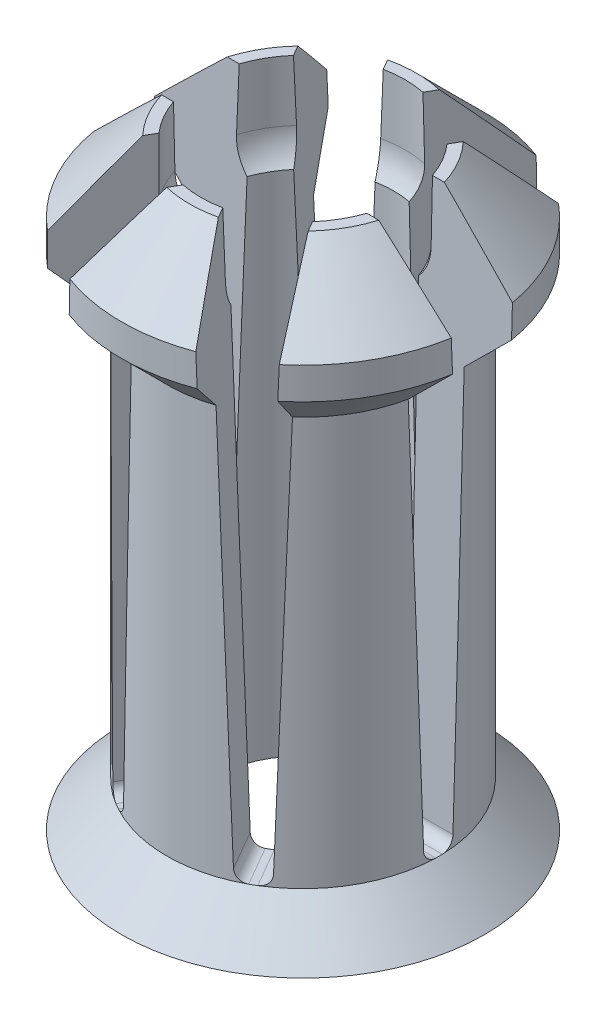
ISO-10303-21;
HEADER;
FILE_DESCRIPTION(('STEP AP214'),'2;1');
FILE_NAME('part.step','',(''),(''),'','','');
FILE_SCHEMA(('AUTOMOTIVE_DESIGN { 1 0 10303 214 1 1 1 1 }'));
ENDSEC;
DATA;
#1=APPLICATION_CONTEXT('core data for automotive mechanical design processes');
#2=APPLICATION_PROTOCOL_DEFINITION('international standard','automotive_design',2000,#1);
#3=PRODUCT_CONTEXT('',#1,'mechanical');
#4=PRODUCT('Part','Part','',(#3));
#5=PRODUCT_RELATED_PRODUCT_CATEGORY('part','',(#4));
#6=PRODUCT_DEFINITION_FORMATION('','',#4);
#7=PRODUCT_DEFINITION_CONTEXT('part definition',#1,'design');
#8=PRODUCT_DEFINITION('design','',#6,#7);
#9=PRODUCT_DEFINITION_SHAPE('','',#8);
#10=(LENGTH_UNIT() NAMED_UNIT(*) SI_UNIT(.MILLI.,.METRE.));
#11=(NAMED_UNIT(*) PLANE_ANGLE_UNIT() SI_UNIT($,.RADIAN.));
#12=(NAMED_UNIT(*) SI_UNIT($,.STERADIAN.) SOLID_ANGLE_UNIT());
#13=UNCERTAINTY_MEASURE_WITH_UNIT(LENGTH_MEASURE(1.E-05),#10,'distance_accuracy_value','');
#14=(GEOMETRIC_REPRESENTATION_CONTEXT(3) GLOBAL_UNCERTAINTY_ASSIGNED_CONTEXT((#13)) GLOBAL_UNIT_ASSIGNED_CONTEXT((#10,
#11,#12)) REPRESENTATION_CONTEXT('',''));
#15=CARTESIAN_POINT('',(0.,0.,0.));
#16=DIRECTION('',(0.,0.,1.));
#17=DIRECTION('',(1.,0.,0.));
#18=AXIS2_PLACEMENT_3D('',#15,#16,#17);
#19=CARTESIAN_POINT('',(0.,0.,0.));
#20=DIRECTION('',(0.,-1.,0.));
#21=DIRECTION('',(0.,0.,-1.));
#22=AXIS2_PLACEMENT_3D('',#19,#20,#21);
#23=CYLINDRICAL_SURFACE('',#22,2.);
#24=CARTESIAN_POINT('',(0.,0.,0.));
#25=DIRECTION('',(0.,-1.,0.));
#26=DIRECTION('',(0.,0.,-1.));
#27=AXIS2_PLACEMENT_3D('',#24,#25,#26);
#28=CIRCLE('',#27,2.);
#29=CARTESIAN_POINT('',(0.,0.,-2.));
#30=VERTEX_POINT('',#29);
#31=EDGE_CURVE('E522',#30,#30,#28,.T.);
#32=ORIENTED_EDGE('',*,*,#31,.T.);
#33=EDGE_LOOP('',(#32));
#34=FACE_BOUND('',#33,.T.);
#35=CARTESIAN_POINT('',(0.,-8.39420985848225,0.));
#36=DIRECTION('',(0.865538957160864,0.033512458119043,-0.499719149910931));
#37=DIRECTION('',(0.0290226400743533,-0.999438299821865,-0.0167562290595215));
#38=AXIS2_PLACEMENT_3D('',#35,#36,#37);
#39=ELLIPSE('',#38,59.6792987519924,2.);
#40=CARTESIAN_POINT('',(0.375505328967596,11.2,1.96443267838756));
#41=VERTEX_POINT('',#40);
#42=CARTESIAN_POINT('',(0.707049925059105,1.24162188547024,1.87085018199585));
#43=VERTEX_POINT('',#42);
#44=EDGE_CURVE('E542',#41,#43,#39,.T.);
#45=ORIENTED_EDGE('',*,*,#44,.T.);
#46=CARTESIAN_POINT('',(0.707049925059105,1.24162188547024,1.87085018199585));
#47=CARTESIAN_POINT('',(0.707480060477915,1.2276562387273,1.87068331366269));
#48=CARTESIAN_POINT('',(0.709046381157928,1.21373747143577,1.87009545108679));
#49=CARTESIAN_POINT('',(0.714330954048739,1.18639470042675,1.86808551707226));
#50=CARTESIAN_POINT('',(0.71804642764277,1.17297008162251,1.86666452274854));
#51=CARTESIAN_POINT('',(0.727511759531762,1.14697537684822,1.8629951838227));
#52=CARTESIAN_POINT('',(0.733262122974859,1.13440550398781,1.86074663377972));
#53=CARTESIAN_POINT('',(0.746595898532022,1.110468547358,1.85543692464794));
#54=CARTESIAN_POINT('',(0.754179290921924,1.09910145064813,1.85237577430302));
#55=CARTESIAN_POINT('',(0.77100066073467,1.07779093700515,1.84543791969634));
#56=CARTESIAN_POINT('',(0.780251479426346,1.06785973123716,1.84155484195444));
#57=CARTESIAN_POINT('',(0.800074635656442,1.0498001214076,1.83302940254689));
#58=CARTESIAN_POINT('',(0.810647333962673,1.04167221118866,1.82838683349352));
#59=CARTESIAN_POINT('',(0.832865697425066,1.02739696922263,1.81837404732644));
#60=CARTESIAN_POINT('',(0.844518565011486,1.02126437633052,1.81299881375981));
#61=CARTESIAN_POINT('',(0.868471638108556,1.01124373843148,1.80164702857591));
#62=CARTESIAN_POINT('',(0.880771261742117,1.0073537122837,1.79567101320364));
#63=CARTESIAN_POINT('',(0.900279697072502,1.00309885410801,1.78593375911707));
#64=CARTESIAN_POINT('',(0.907400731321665,1.00193736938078,1.78232653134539));
#65=CARTESIAN_POINT('',(0.921654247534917,1.00038834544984,1.77499800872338));
#66=CARTESIAN_POINT('',(0.928786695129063,0.999999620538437,1.77127689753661));
#67=CARTESIAN_POINT('',(0.935899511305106,0.99999999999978,1.7675101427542));
#68=B_SPLINE_CURVE_WITH_KNOTS('',3,(#46,#47,#48,#49,#50,#51,#52,#53,#54,#55,#56,#57,#58,#59,#60,
#61,#62,#63,#64,#65,#66,#67),.UNSPECIFIED.,.F.,.F.,(4,2,2,2,2,2,2,2,2,2,4),(0.,
0.0418598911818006,0.0836657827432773,0.125482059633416,0.167297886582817,0.209450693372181,
0.251615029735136,0.294084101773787,0.33651559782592,0.360681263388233,0.384809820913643),.UNSPECIFIED.);
#69=CARTESIAN_POINT('',(0.935899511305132,1.,1.76751014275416));
#70=VERTEX_POINT('',#69);
#71=EDGE_CURVE('E49',#43,#70,#68,.T.);
#72=ORIENTED_EDGE('',*,*,#71,.T.);
#73=CARTESIAN_POINT('',(0.,1.,0.));
#74=DIRECTION('',(0.,1.,0.));
#75=DIRECTION('',(-1.,0.,0.));
#76=AXIS2_PLACEMENT_3D('',#73,#74,#75);
#77=CIRCLE('',#76,2.);
#78=CARTESIAN_POINT('',(1.06275892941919,1.,1.69426782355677));
#79=VERTEX_POINT('',#78);
#80=EDGE_CURVE('E903',#70,#79,#77,.T.);
#81=ORIENTED_EDGE('',*,*,#80,.T.);
#82=CARTESIAN_POINT('',(1.06275892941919,1.,1.69426782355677));
#83=CARTESIAN_POINT('',(1.07467631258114,0.999988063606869,1.68679910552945));
#84=CARTESIAN_POINT('',(1.0865041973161,1.00118448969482,1.67919826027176));
#85=CARTESIAN_POINT('',(1.10966025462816,1.00589797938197,1.66398311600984));
#86=CARTESIAN_POINT('',(1.1209889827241,1.0094123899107,1.65636884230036));
#87=CARTESIAN_POINT('',(1.14285755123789,1.0186673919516,1.64135747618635));
#88=CARTESIAN_POINT('',(1.15339718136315,1.02440857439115,1.63396044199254));
#89=CARTESIAN_POINT('',(1.17342250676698,1.0379471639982,1.61963912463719));
#90=CARTESIAN_POINT('',(1.18290824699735,1.04574448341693,1.61271482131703));
#91=CARTESIAN_POINT('',(1.2006556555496,1.06323347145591,1.59954655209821));
#92=CARTESIAN_POINT('',(1.20890942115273,1.07293651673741,1.59330704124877));
#93=CARTESIAN_POINT('',(1.22393224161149,1.09394086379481,1.58179633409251));
#94=CARTESIAN_POINT('',(1.23070092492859,1.10524256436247,1.57652538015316));
#95=CARTESIAN_POINT('',(1.24260245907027,1.12914467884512,1.56716200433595));
#96=CARTESIAN_POINT('',(1.24773300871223,1.141746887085,1.56307124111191));
#97=CARTESIAN_POINT('',(1.25622114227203,1.16787748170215,1.55625779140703));
#98=CARTESIAN_POINT('',(1.25958041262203,1.18140497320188,1.55353380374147));
#99=CARTESIAN_POINT('',(1.26336195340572,1.20281846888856,1.55045782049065));
#100=CARTESIAN_POINT('',(1.26442587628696,1.21052588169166,1.54958979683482));
#101=CARTESIAN_POINT('',(1.26598125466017,1.22602407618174,1.54831913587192));
#102=CARTESIAN_POINT('',(1.2664735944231,1.23381471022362,1.54791577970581));
#103=CARTESIAN_POINT('',(1.26667882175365,1.24162188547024,1.54774828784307));
#104=B_SPLINE_CURVE_WITH_KNOTS('',3,(#82,#83,#84,#85,#86,#87,#88,#89,#90,#91,#92,#93,#94,#95,
#96,#97,#98,#99,#100,#101,#102,#103),.UNSPECIFIED.,.F.,.F.,(4,2,2,2,2,2,2,2,2,2,4),(0.,
0.0421331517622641,0.0842181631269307,0.126314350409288,0.168408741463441,0.210762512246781,
0.253126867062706,0.295550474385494,0.337933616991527,0.361388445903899,0.384806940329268),.UNSPECIFIED.);
#105=CARTESIAN_POINT('',(1.26667882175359,1.24162188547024,1.547748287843));
#106=VERTEX_POINT('',#105);
#107=EDGE_CURVE('E1142',#79,#106,#104,.T.);
#108=ORIENTED_EDGE('',*,*,#107,.T.);
#109=CARTESIAN_POINT('',(0.,-8.39420985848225,0.));
#110=DIRECTION('',(-0.865538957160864,0.033512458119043,0.499719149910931));
#111=DIRECTION('',(-0.0290226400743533,-0.999438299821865,0.0167562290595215));
#112=AXIS2_PLACEMENT_3D('',#109,#110,#111);
#113=ELLIPSE('',#112,59.6792987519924,2.);
#114=CARTESIAN_POINT('',(1.51349593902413,11.2,1.30741349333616));
#115=VERTEX_POINT('',#114);
#116=EDGE_CURVE('E1060',#106,#115,#113,.T.);
#117=ORIENTED_EDGE('',*,*,#116,.T.);
#118=CARTESIAN_POINT('',(0.,11.2,0.));
#119=DIRECTION('',(0.,-1.,0.));
#120=DIRECTION('',(0.,0.,-1.));
#121=AXIS2_PLACEMENT_3D('',#118,#119,#120);
#122=CIRCLE('',#121,2.);
#123=CARTESIAN_POINT('',(1.88900126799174,11.2,0.657019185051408));
#124=VERTEX_POINT('',#123);
#125=EDGE_CURVE('E514',#124,#115,#122,.T.);
#126=ORIENTED_EDGE('',*,*,#125,.F.);
#127=CARTESIAN_POINT('',(0.,-8.39420985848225,0.));
#128=DIRECTION('',(0.,0.033512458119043,-0.999438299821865));
#129=DIRECTION('',(0.,-0.999438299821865,-0.033512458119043));
#130=AXIS2_PLACEMENT_3D('',#127,#128,#129);
#131=ELLIPSE('',#130,59.6792987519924,2.);
#132=CARTESIAN_POINT('',(1.9737287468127,1.24162188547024,0.323101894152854));
#133=VERTEX_POINT('',#132);
#134=EDGE_CURVE('E1121',#124,#133,#131,.T.);
#135=ORIENTED_EDGE('',*,*,#134,.T.);
#136=CARTESIAN_POINT('',(1.9737287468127,1.24162188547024,0.323101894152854));
#137=CARTESIAN_POINT('',(1.9737993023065,1.22765623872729,0.322645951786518));
#138=CARTESIAN_POINT('',(1.97407335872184,1.21373747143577,0.320995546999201));
#139=CARTESIAN_POINT('',(1.97497499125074,1.18639470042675,0.315414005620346));
#140=CARTESIAN_POINT('',(1.97560211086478,1.17297008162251,0.311485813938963));
#141=CARTESIAN_POINT('',(1.9771570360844,1.14697537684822,0.301453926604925));
#142=CARTESIAN_POINT('',(1.97808491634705,1.13440550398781,0.295349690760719));
#143=CARTESIAN_POINT('',(1.9801534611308,1.110468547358,0.281147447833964));
#144=CARTESIAN_POINT('',(1.98129412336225,1.09910145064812,0.273049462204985));
#145=CARTESIAN_POINT('',(1.98369644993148,1.07779093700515,0.255012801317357));
#146=CARTESIAN_POINT('',(1.98495901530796,1.06785973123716,0.245059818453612));
#147=CARTESIAN_POINT('',(1.98748734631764,1.04980012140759,0.223629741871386));
#148=CARTESIAN_POINT('',(1.98875311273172,1.04167221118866,0.212152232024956));
#149=CARTESIAN_POINT('',(1.99119096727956,1.02739696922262,0.187904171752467));
#150=CARTESIAN_POINT('',(1.99236231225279,1.02126437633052,0.175124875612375));
#151=CARTESIAN_POINT('',(1.99450791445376,1.01124373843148,0.148705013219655));
#152=CARTESIAN_POINT('',(1.99548234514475,1.0073537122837,0.135065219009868));
#153=CARTESIAN_POINT('',(1.99680385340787,1.00309885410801,0.113301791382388));
#154=CARTESIAN_POINT('',(1.99724041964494,1.00193736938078,0.10533118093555));
#155=CARTESIAN_POINT('',(1.99802049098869,1.00038834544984,0.0893230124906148));
#156=CARTESIAN_POINT('',(1.99836413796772,0.999999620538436,0.0812855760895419));
#157=CARTESIAN_POINT('',(1.99865844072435,0.999999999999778,0.0732423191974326));
#158=B_SPLINE_CURVE_WITH_KNOTS('',3,(#136,#137,#138,#139,#140,#141,#142,#143,#144,#145,#146,
#147,#148,#149,#150,#151,#152,#153,#154,#155,#156,#157),.UNSPECIFIED.,.F.,.F.,(4,2,2,2,2,2,2,2,
2,2,4),(0.,0.0418598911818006,0.0836657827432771,0.125482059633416,0.167297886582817,
0.20945069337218,0.251615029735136,0.294084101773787,0.336515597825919,0.360681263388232,
0.384809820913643),.UNSPECIFIED.);
#159=CARTESIAN_POINT('',(1.99865844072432,1.,0.0732423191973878));
#160=VERTEX_POINT('',#159);
#161=EDGE_CURVE('E1274',#133,#160,#158,.T.);
#162=ORIENTED_EDGE('',*,*,#161,.T.);
#163=CARTESIAN_POINT('',(0.,1.,0.));
#164=DIRECTION('',(0.,1.,0.));
#165=DIRECTION('',(0.,0.,1.));
#166=AXIS2_PLACEMENT_3D('',#163,#164,#165);
#167=CIRCLE('',#166,2.);
#168=CARTESIAN_POINT('',(1.99865844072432,1.,-0.0732423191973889));
#169=VERTEX_POINT('',#168);
#170=EDGE_CURVE('E1553',#160,#169,#167,.T.);
#171=ORIENTED_EDGE('',*,*,#170,.T.);
#172=CARTESIAN_POINT('',(1.99865844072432,1.,-0.0732423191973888));
#173=CARTESIAN_POINT('',(1.99814903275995,0.999988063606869,-0.0872974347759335));
#174=CARTESIAN_POINT('',(1.99748045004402,1.00118448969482,-0.101341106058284));
#175=CARTESIAN_POINT('',(1.99588177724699,1.00589797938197,-0.129002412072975));
#176=CARTESIAN_POINT('',(1.99495198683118,1.0094123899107,-0.142620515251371));
#177=CARTESIAN_POINT('',(1.99288604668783,1.0186673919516,-0.169064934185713));
#178=CARTESIAN_POINT('',(1.99174984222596,1.02440857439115,-0.181891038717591));
#179=CARTESIAN_POINT('',(1.98935988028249,1.0379471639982,-0.206394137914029));
#180=CARTESIAN_POINT('',(1.9881061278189,1.04574448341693,-0.218071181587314));
#181=CARTESIAN_POINT('',(1.98557577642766,1.06323347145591,-0.240025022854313));
#182=CARTESIAN_POINT('',(1.98429908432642,1.07293651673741,-0.250292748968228));
#183=CARTESIAN_POINT('',(1.98184192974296,1.09394086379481,-0.26905824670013));
#184=CARTESIAN_POINT('',(1.98066149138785,1.10524256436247,-0.277555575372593));
#185=CARTESIAN_POINT('',(1.9785033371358,1.12914467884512,-0.292544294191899));
#186=CARTESIAN_POINT('',(1.9775259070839,1.141746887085,-0.299032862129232));
#187=CARTESIAN_POINT('',(1.97586935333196,1.16787748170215,-0.309790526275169));
#188=CARTESIAN_POINT('',(1.975189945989,1.18140497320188,-0.314061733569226));
#189=CARTESIAN_POINT('',(1.97441683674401,1.20281846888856,-0.318874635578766));
#190=CARTESIAN_POINT('',(1.9741970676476,1.21052588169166,-0.320230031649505));
#191=CARTESIAN_POINT('',(1.97387433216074,1.22602407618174,-0.322212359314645));
#192=CARTESIAN_POINT('',(1.97377118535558,1.23381471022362,-0.322840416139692));
#193=CARTESIAN_POINT('',(1.97372874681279,1.24162188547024,-0.323101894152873));
#194=B_SPLINE_CURVE_WITH_KNOTS('',3,(#172,#173,#174,#175,#176,#177,#178,#179,#180,#181,#182,
#183,#184,#185,#186,#187,#188,#189,#190,#191,#192,#193),.UNSPECIFIED.,.F.,.F.,(4,2,2,2,2,2,2,2,
2,2,4),(0.,0.0421331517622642,0.084218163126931,0.126314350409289,0.168408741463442,
0.210762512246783,0.253126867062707,0.295550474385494,0.337933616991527,0.361388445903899,
0.384806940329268),.UNSPECIFIED.);
#195=CARTESIAN_POINT('',(1.9737287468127,1.24162188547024,-0.323101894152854));
#196=VERTEX_POINT('',#195);
#197=EDGE_CURVE('E1266',#169,#196,#194,.T.);
#198=ORIENTED_EDGE('',*,*,#197,.T.);
#199=CARTESIAN_POINT('',(0.,-8.39420985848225,0.));
#200=DIRECTION('',(0.,0.033512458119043,0.999438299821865));
#201=DIRECTION('',(0.,-0.999438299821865,0.033512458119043));
#202=AXIS2_PLACEMENT_3D('',#199,#200,#201);
#203=ELLIPSE('',#202,59.6792987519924,2.);
#204=CARTESIAN_POINT('',(1.88900126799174,11.2,-0.657019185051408));
#205=VERTEX_POINT('',#204);
#206=EDGE_CURVE('E1096',#196,#205,#203,.T.);
#207=ORIENTED_EDGE('',*,*,#206,.T.);
#208=CARTESIAN_POINT('',(1.51349593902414,11.2,-1.30741349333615));
#209=VERTEX_POINT('',#208);
#210=EDGE_CURVE('E497',#209,#205,#122,.T.);
#211=ORIENTED_EDGE('',*,*,#210,.F.);
#212=CARTESIAN_POINT('',(0.,-8.39420985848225,0.));
#213=DIRECTION('',(-0.865538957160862,0.033512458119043,-0.499719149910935));
#214=DIRECTION('',(-0.0290226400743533,-0.999438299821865,-0.0167562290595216));
#215=AXIS2_PLACEMENT_3D('',#212,#213,#214);
#216=ELLIPSE('',#215,59.6792987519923,2.);
#217=CARTESIAN_POINT('',(1.2666788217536,1.24162188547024,-1.54774828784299));
#218=VERTEX_POINT('',#217);
#219=EDGE_CURVE('E1009',#209,#218,#216,.T.);
#220=ORIENTED_EDGE('',*,*,#219,.T.);
#221=CARTESIAN_POINT('',(1.2666788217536,1.24162188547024,-1.54774828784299));
#222=CARTESIAN_POINT('',(1.26631924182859,1.2276562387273,-1.54803736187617));
#223=CARTESIAN_POINT('',(1.26502697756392,1.21373747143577,-1.54909990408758));
#224=CARTESIAN_POINT('',(1.260644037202,1.18639470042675,-1.55267151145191));
#225=CARTESIAN_POINT('',(1.25755568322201,1.17297008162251,-1.55517870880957));
#226=CARTESIAN_POINT('',(1.24964527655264,1.14697537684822,-1.56154125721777));
#227=CARTESIAN_POINT('',(1.24482279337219,1.13440550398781,-1.565396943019));
#228=CARTESIAN_POINT('',(1.23355756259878,1.11046854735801,-1.57428947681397));
#229=CARTESIAN_POINT('',(1.22711483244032,1.09910145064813,-1.57932631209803));
#230=CARTESIAN_POINT('',(1.21269578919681,1.07779093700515,-1.59042511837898));
#231=CARTESIAN_POINT('',(1.20470753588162,1.06785973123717,-1.59649502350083));
#232=CARTESIAN_POINT('',(1.1874127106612,1.0498001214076,-1.6093996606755));
#233=CARTESIAN_POINT('',(1.17810577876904,1.04167221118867,-1.61623460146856));
#234=CARTESIAN_POINT('',(1.1583252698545,1.02739696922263,-1.63046987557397));
#235=CARTESIAN_POINT('',(1.14784374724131,1.02126437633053,-1.63787393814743));
#236=CARTESIAN_POINT('',(1.12603627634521,1.01124373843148,-1.65294201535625));
#237=CARTESIAN_POINT('',(1.11471108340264,1.0073537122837,-1.66060579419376));
#238=CARTESIAN_POINT('',(1.09652415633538,1.00309885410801,-1.67263196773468));
#239=CARTESIAN_POINT('',(1.08983968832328,1.00193736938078,-1.67699535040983));
#240=CARTESIAN_POINT('',(1.07636624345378,1.00038834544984,-1.68567499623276));
#241=CARTESIAN_POINT('',(1.06957744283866,0.999999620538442,-1.68999132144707));
#242=CARTESIAN_POINT('',(1.06275892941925,0.999999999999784,-1.69426782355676));
#243=B_SPLINE_CURVE_WITH_KNOTS('',3,(#221,#222,#223,#224,#225,#226,#227,#228,#229,#230,#231,
#232,#233,#234,#235,#236,#237,#238,#239,#240,#241,#242),.UNSPECIFIED.,.F.,.F.,(4,2,2,2,2,2,2,2,
2,2,4),(0.,0.0418598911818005,0.0836657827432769,0.125482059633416,0.167297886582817,
0.20945069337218,0.251615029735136,0.294084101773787,0.336515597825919,0.360681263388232,
0.384809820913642),.UNSPECIFIED.);
#244=CARTESIAN_POINT('',(1.06275892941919,1.,-1.69426782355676));
#245=VERTEX_POINT('',#244);
#246=EDGE_CURVE('E1258',#218,#245,#243,.T.);
#247=ORIENTED_EDGE('',*,*,#246,.T.);
#248=CARTESIAN_POINT('',(0.935899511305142,1.,-1.76751014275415));
#249=VERTEX_POINT('',#248);
#250=EDGE_CURVE('E905',#245,#249,#77,.T.);
#251=ORIENTED_EDGE('',*,*,#250,.T.);
#252=CARTESIAN_POINT('',(0.935899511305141,1.,-1.76751014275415));
#253=CARTESIAN_POINT('',(0.923472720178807,0.999988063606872,-1.77409654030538));
#254=CARTESIAN_POINT('',(0.910976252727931,1.00118448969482,-1.78053936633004));
#255=CARTESIAN_POINT('',(0.886221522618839,1.00589797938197,-1.79298552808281));
#256=CARTESIAN_POINT('',(0.873963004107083,1.0094123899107,-1.79898935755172));
#257=CARTESIAN_POINT('',(0.850028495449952,1.0186673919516,-1.81042241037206));
#258=CARTESIAN_POINT('',(0.838352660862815,1.02440857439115,-1.81585148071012));
#259=CARTESIAN_POINT('',(0.815937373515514,1.0379471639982,-1.82603326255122));
#260=CARTESIAN_POINT('',(0.805197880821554,1.04574448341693,-1.83078600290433));
#261=CARTESIAN_POINT('',(0.78492012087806,1.06323347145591,-1.83957157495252));
#262=CARTESIAN_POINT('',(0.775389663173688,1.07293651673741,-1.84359979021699));
#263=CARTESIAN_POINT('',(0.757909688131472,1.09394086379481,-1.85085458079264));
#264=CARTESIAN_POINT('',(0.74996056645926,1.10524256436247,-1.85408095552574));
#265=CARTESIAN_POINT('',(0.735900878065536,1.12914467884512,-1.85970629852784));
#266=CARTESIAN_POINT('',(0.72979289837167,1.141746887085,-1.86210410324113));
#267=CARTESIAN_POINT('',(0.719648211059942,1.16787748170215,-1.86604831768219));
#268=CARTESIAN_POINT('',(0.715609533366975,1.18140497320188,-1.86759553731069));
#269=CARTESIAN_POINT('',(0.711054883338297,1.20281846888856,-1.86933245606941));
#270=CARTESIAN_POINT('',(0.709771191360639,1.21052588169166,-1.86981982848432));
#271=CARTESIAN_POINT('',(0.707893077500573,1.22602407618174,-1.87053149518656));
#272=CARTESIAN_POINT('',(0.707297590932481,1.23381471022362,-1.8707561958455));
#273=CARTESIAN_POINT('',(0.707049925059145,1.24162188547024,-1.87085018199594));
#274=B_SPLINE_CURVE_WITH_KNOTS('',3,(#252,#253,#254,#255,#256,#257,#258,#259,#260,#261,#262,
#263,#264,#265,#266,#267,#268,#269,#270,#271,#272,#273),.UNSPECIFIED.,.F.,.F.,(4,2,2,2,2,2,2,2,
2,2,4),(0.,0.0421331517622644,0.0842181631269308,0.126314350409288,0.168408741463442,
0.210762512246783,0.253126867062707,0.295550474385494,0.337933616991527,0.361388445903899,
0.384806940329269),.UNSPECIFIED.);
#275=CARTESIAN_POINT('',(0.707049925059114,1.24162188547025,-1.87085018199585));
#276=VERTEX_POINT('',#275);
#277=EDGE_CURVE('E1249',#249,#276,#274,.T.);
#278=ORIENTED_EDGE('',*,*,#277,.T.);
#279=CARTESIAN_POINT('',(0.,-8.39420985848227,0.));
#280=DIRECTION('',(0.865538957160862,0.033512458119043,0.499719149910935));
#281=DIRECTION('',(0.0290226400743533,-0.999438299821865,0.0167562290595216));
#282=AXIS2_PLACEMENT_3D('',#279,#280,#281);
#283=ELLIPSE('',#282,59.6792987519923,2.);
#284=CARTESIAN_POINT('',(0.375505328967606,11.2,-1.96443267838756));
#285=VERTEX_POINT('',#284);
#286=EDGE_CURVE('E470',#276,#285,#283,.T.);
#287=ORIENTED_EDGE('',*,*,#286,.T.);
#288=CARTESIAN_POINT('',(-0.375505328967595,11.2,-1.96443267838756));
#289=VERTEX_POINT('',#288);
#290=EDGE_CURVE('E503',#289,#285,#122,.T.);
#291=ORIENTED_EDGE('',*,*,#290,.F.);
#292=CARTESIAN_POINT('',(0.,-8.39420985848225,0.));
#293=DIRECTION('',(-0.865538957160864,0.033512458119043,0.499719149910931));
#294=DIRECTION('',(-0.0290226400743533,-0.999438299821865,0.0167562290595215));
#295=AXIS2_PLACEMENT_3D('',#292,#293,#294);
#296=ELLIPSE('',#295,59.6792987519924,2.);
#297=CARTESIAN_POINT('',(-0.707049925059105,1.24162188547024,-1.87085018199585));
#298=VERTEX_POINT('',#297);
#299=EDGE_CURVE('E2062',#289,#298,#296,.T.);
#300=ORIENTED_EDGE('',*,*,#299,.T.);
#301=CARTESIAN_POINT('',(-0.707049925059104,1.24162188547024,-1.87085018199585));
#302=CARTESIAN_POINT('',(-0.707480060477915,1.2276562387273,-1.87068331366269));
#303=CARTESIAN_POINT('',(-0.709046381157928,1.21373747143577,-1.87009545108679));
#304=CARTESIAN_POINT('',(-0.714330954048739,1.18639470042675,-1.86808551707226));
#305=CARTESIAN_POINT('',(-0.71804642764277,1.17297008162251,-1.86666452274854));
#306=CARTESIAN_POINT('',(-0.727511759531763,1.14697537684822,-1.8629951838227));
#307=CARTESIAN_POINT('',(-0.73326212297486,1.13440550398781,-1.86074663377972));
#308=CARTESIAN_POINT('',(-0.746595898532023,1.11046854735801,-1.85543692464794));
#309=CARTESIAN_POINT('',(-0.754179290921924,1.09910145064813,-1.85237577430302));
#310=CARTESIAN_POINT('',(-0.77100066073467,1.07779093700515,-1.84543791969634));
#311=CARTESIAN_POINT('',(-0.780251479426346,1.06785973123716,-1.84155484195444));
#312=CARTESIAN_POINT('',(-0.800074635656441,1.0498001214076,-1.83302940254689));
#313=CARTESIAN_POINT('',(-0.810647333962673,1.04167221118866,-1.82838683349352));
#314=CARTESIAN_POINT('',(-0.832865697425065,1.02739696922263,-1.81837404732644));
#315=CARTESIAN_POINT('',(-0.844518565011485,1.02126437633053,-1.81299881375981));
#316=CARTESIAN_POINT('',(-0.868471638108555,1.01124373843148,-1.80164702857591));
#317=CARTESIAN_POINT('',(-0.880771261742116,1.0073537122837,-1.79567101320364));
#318=CARTESIAN_POINT('',(-0.9002796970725,1.00309885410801,-1.78593375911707));
#319=CARTESIAN_POINT('',(-0.907400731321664,1.00193736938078,-1.78232653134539));
#320=CARTESIAN_POINT('',(-0.921654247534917,1.00038834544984,-1.77499800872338));
#321=CARTESIAN_POINT('',(-0.928786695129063,0.999999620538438,-1.77127689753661));
#322=CARTESIAN_POINT('',(-0.935899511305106,0.999999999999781,-1.7675101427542));
#323=B_SPLINE_CURVE_WITH_KNOTS('',3,(#301,#302,#303,#304,#305,#306,#307,#308,#309,#310,#311,
#312,#313,#314,#315,#316,#317,#318,#319,#320,#321,#322),.UNSPECIFIED.,.F.,.F.,(4,2,2,2,2,2,2,2,
2,2,4),(0.,0.0418598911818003,0.0836657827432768,0.125482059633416,0.167297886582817,
0.20945069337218,0.251615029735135,0.294084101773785,0.336515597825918,0.360681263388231,
0.384809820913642),.UNSPECIFIED.);
#324=CARTESIAN_POINT('',(-0.935899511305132,1.,-1.76751014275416));
#325=VERTEX_POINT('',#324);
#326=EDGE_CURVE('E1240',#298,#325,#323,.T.);
#327=ORIENTED_EDGE('',*,*,#326,.T.);
#328=CARTESIAN_POINT('',(-1.06275892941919,1.,-1.69426782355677));
#329=VERTEX_POINT('',#328);
#330=EDGE_CURVE('E906',#325,#329,#77,.T.);
#331=ORIENTED_EDGE('',*,*,#330,.T.);
#332=CARTESIAN_POINT('',(-1.06275892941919,1.,-1.69426782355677));
#333=CARTESIAN_POINT('',(-1.07467631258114,0.999988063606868,-1.68679910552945));
#334=CARTESIAN_POINT('',(-1.0865041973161,1.00118448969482,-1.67919826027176));
#335=CARTESIAN_POINT('',(-1.10966025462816,1.00589797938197,-1.66398311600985));
#336=CARTESIAN_POINT('',(-1.1209889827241,1.0094123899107,-1.65636884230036));
#337=CARTESIAN_POINT('',(-1.14285755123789,1.0186673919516,-1.64135747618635));
#338=CARTESIAN_POINT('',(-1.15339718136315,1.02440857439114,-1.63396044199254));
#339=CARTESIAN_POINT('',(-1.17342250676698,1.03794716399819,-1.61963912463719));
#340=CARTESIAN_POINT('',(-1.18290824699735,1.04574448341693,-1.61271482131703));
#341=CARTESIAN_POINT('',(-1.2006556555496,1.06323347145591,-1.59954655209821));
#342=CARTESIAN_POINT('',(-1.20890942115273,1.07293651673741,-1.59330704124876));
#343=CARTESIAN_POINT('',(-1.22393224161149,1.09394086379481,-1.58179633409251));
#344=CARTESIAN_POINT('',(-1.23070092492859,1.10524256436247,-1.57652538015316));
#345=CARTESIAN_POINT('',(-1.24260245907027,1.12914467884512,-1.56716200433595));
#346=CARTESIAN_POINT('',(-1.24773300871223,1.141746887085,-1.56307124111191));
#347=CARTESIAN_POINT('',(-1.25622114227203,1.16787748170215,-1.55625779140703));
#348=CARTESIAN_POINT('',(-1.25958041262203,1.18140497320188,-1.55353380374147));
#349=CARTESIAN_POINT('',(-1.26336195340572,1.20281846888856,-1.55045782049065));
#350=CARTESIAN_POINT('',(-1.26442587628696,1.21052588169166,-1.54958979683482));
#351=CARTESIAN_POINT('',(-1.26598125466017,1.22602407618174,-1.54831913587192));
#352=CARTESIAN_POINT('',(-1.2664735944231,1.23381471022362,-1.54791577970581));
#353=CARTESIAN_POINT('',(-1.26667882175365,1.24162188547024,-1.54774828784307));
#354=B_SPLINE_CURVE_WITH_KNOTS('',3,(#332,#333,#334,#335,#336,#337,#338,#339,#340,#341,#342,
#343,#344,#345,#346,#347,#348,#349,#350,#351,#352,#353),.UNSPECIFIED.,.F.,.F.,(4,2,2,2,2,2,2,2,
2,2,4),(0.,0.0421331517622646,0.0842181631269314,0.126314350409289,0.168408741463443,
0.210762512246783,0.253126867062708,0.295550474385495,0.337933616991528,0.3613884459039,
0.384806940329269),.UNSPECIFIED.);
#355=CARTESIAN_POINT('',(-1.26667882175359,1.24162188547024,-1.547748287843));
#356=VERTEX_POINT('',#355);
#357=EDGE_CURVE('E1231',#329,#356,#354,.T.);
#358=ORIENTED_EDGE('',*,*,#357,.T.);
#359=CARTESIAN_POINT('',(0.,-8.39420985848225,0.));
#360=DIRECTION('',(0.865538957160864,0.033512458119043,-0.499719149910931));
#361=DIRECTION('',(0.0290226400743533,-0.999438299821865,-0.0167562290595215));
#362=AXIS2_PLACEMENT_3D('',#359,#360,#361);
#363=ELLIPSE('',#362,59.6792987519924,2.);
#364=CARTESIAN_POINT('',(-1.51349593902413,11.2,-1.30741349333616));
#365=VERTEX_POINT('',#364);
#366=EDGE_CURVE('E888',#356,#365,#363,.T.);
#367=ORIENTED_EDGE('',*,*,#366,.T.);
#368=CARTESIAN_POINT('',(-1.88900126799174,11.2,-0.657019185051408));
#369=VERTEX_POINT('',#368);
#370=EDGE_CURVE('E504',#369,#365,#122,.T.);
#371=ORIENTED_EDGE('',*,*,#370,.F.);
#372=CARTESIAN_POINT('',(-1.9737287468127,1.24162188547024,-0.323101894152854));
#373=VERTEX_POINT('',#372);
#374=EDGE_CURVE('E1100',#369,#373,#203,.T.);
#375=ORIENTED_EDGE('',*,*,#374,.T.);
#376=CARTESIAN_POINT('',(-1.9737287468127,1.24162188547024,-0.323101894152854));
#377=CARTESIAN_POINT('',(-1.9737993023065,1.2276562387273,-0.322645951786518));
#378=CARTESIAN_POINT('',(-1.97407335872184,1.21373747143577,-0.320995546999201));
#379=CARTESIAN_POINT('',(-1.97497499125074,1.18639470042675,-0.315414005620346));
#380=CARTESIAN_POINT('',(-1.97560211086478,1.17297008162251,-0.311485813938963));
#381=CARTESIAN_POINT('',(-1.9771570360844,1.14697537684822,-0.301453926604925));
#382=CARTESIAN_POINT('',(-1.97808491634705,1.13440550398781,-0.295349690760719));
#383=CARTESIAN_POINT('',(-1.9801534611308,1.110468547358,-0.281147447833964));
#384=CARTESIAN_POINT('',(-1.98129412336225,1.09910145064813,-0.273049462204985));
#385=CARTESIAN_POINT('',(-1.98369644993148,1.07779093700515,-0.255012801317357));
#386=CARTESIAN_POINT('',(-1.98495901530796,1.06785973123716,-0.245059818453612));
#387=CARTESIAN_POINT('',(-1.98748734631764,1.0498001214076,-0.223629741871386));
#388=CARTESIAN_POINT('',(-1.98875311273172,1.04167221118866,-0.212152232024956));
#389=CARTESIAN_POINT('',(-1.99119096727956,1.02739696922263,-0.187904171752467));
#390=CARTESIAN_POINT('',(-1.99236231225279,1.02126437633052,-0.175124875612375));
#391=CARTESIAN_POINT('',(-1.99450791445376,1.01124373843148,-0.148705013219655));
#392=CARTESIAN_POINT('',(-1.99548234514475,1.0073537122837,-0.135065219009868));
#393=CARTESIAN_POINT('',(-1.99680385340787,1.00309885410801,-0.113301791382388));
#394=CARTESIAN_POINT('',(-1.99724041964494,1.00193736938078,-0.10533118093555));
#395=CARTESIAN_POINT('',(-1.99802049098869,1.00038834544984,-0.0893230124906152));
#396=CARTESIAN_POINT('',(-1.99836413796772,0.999999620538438,-0.0812855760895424));
#397=CARTESIAN_POINT('',(-1.99865844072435,0.999999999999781,-0.0732423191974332));
#398=B_SPLINE_CURVE_WITH_KNOTS('',3,(#376,#377,#378,#379,#380,#381,#382,#383,#384,#385,#386,
#387,#388,#389,#390,#391,#392,#393,#394,#395,#396,#397),.UNSPECIFIED.,.F.,.F.,(4,2,2,2,2,2,2,2,
2,2,4),(0.,0.0418598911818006,0.0836657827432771,0.125482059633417,0.167297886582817,
0.20945069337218,0.251615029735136,0.294084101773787,0.336515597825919,0.360681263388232,
0.384809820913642),.UNSPECIFIED.);
#399=CARTESIAN_POINT('',(-1.99865844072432,1.,-0.0732423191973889));
#400=VERTEX_POINT('',#399);
#401=EDGE_CURVE('E1222',#373,#400,#398,.T.);
#402=ORIENTED_EDGE('',*,*,#401,.T.);
#403=CARTESIAN_POINT('',(-1.99865844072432,1.,0.0732423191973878));
#404=VERTEX_POINT('',#403);
#405=EDGE_CURVE('E1091',#400,#404,#167,.T.);
#406=ORIENTED_EDGE('',*,*,#405,.T.);
#407=CARTESIAN_POINT('',(-1.99865844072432,1.,0.0732423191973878));
#408=CARTESIAN_POINT('',(-1.99814903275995,0.999988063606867,0.0872974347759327));
#409=CARTESIAN_POINT('',(-1.99748045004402,1.00118448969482,0.101341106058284));
#410=CARTESIAN_POINT('',(-1.99588177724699,1.00589797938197,0.129002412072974));
#411=CARTESIAN_POINT('',(-1.99495198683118,1.0094123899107,0.14262051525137));
#412=CARTESIAN_POINT('',(-1.99288604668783,1.0186673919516,0.169064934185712));
#413=CARTESIAN_POINT('',(-1.99174984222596,1.02440857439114,0.18189103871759));
#414=CARTESIAN_POINT('',(-1.98935988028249,1.03794716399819,0.206394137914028));
#415=CARTESIAN_POINT('',(-1.9881061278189,1.04574448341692,0.218071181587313));
#416=CARTESIAN_POINT('',(-1.98557577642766,1.06323347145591,0.240025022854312));
#417=CARTESIAN_POINT('',(-1.98429908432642,1.07293651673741,0.250292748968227));
#418=CARTESIAN_POINT('',(-1.98184192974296,1.09394086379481,0.269058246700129));
#419=CARTESIAN_POINT('',(-1.98066149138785,1.10524256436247,0.277555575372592));
#420=CARTESIAN_POINT('',(-1.9785033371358,1.12914467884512,0.292544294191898));
#421=CARTESIAN_POINT('',(-1.9775259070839,1.14174688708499,0.299032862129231));
#422=CARTESIAN_POINT('',(-1.97586935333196,1.16787748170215,0.309790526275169));
#423=CARTESIAN_POINT('',(-1.975189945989,1.18140497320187,0.314061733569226));
#424=CARTESIAN_POINT('',(-1.97441683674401,1.20281846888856,0.318874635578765));
#425=CARTESIAN_POINT('',(-1.9741970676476,1.21052588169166,0.320230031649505));
#426=CARTESIAN_POINT('',(-1.97387433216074,1.22602407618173,0.322212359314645));
#427=CARTESIAN_POINT('',(-1.97377118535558,1.23381471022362,0.322840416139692));
#428=CARTESIAN_POINT('',(-1.97372874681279,1.24162188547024,0.323101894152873));
#429=B_SPLINE_CURVE_WITH_KNOTS('',3,(#407,#408,#409,#410,#411,#412,#413,#414,#415,#416,#417,
#418,#419,#420,#421,#422,#423,#424,#425,#426,#427,#428),.UNSPECIFIED.,.F.,.F.,(4,2,2,2,2,2,2,2,
2,2,4),(0.,0.0421331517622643,0.0842181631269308,0.126314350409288,0.168408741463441,
0.210762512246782,0.253126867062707,0.295550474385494,0.337933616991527,0.3613884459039,
0.384806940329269),.UNSPECIFIED.);
#430=CARTESIAN_POINT('',(-1.9737287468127,1.24162188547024,0.323101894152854));
#431=VERTEX_POINT('',#430);
#432=EDGE_CURVE('E1212',#404,#431,#429,.T.);
#433=ORIENTED_EDGE('',*,*,#432,.T.);
#434=CARTESIAN_POINT('',(-1.88900126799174,11.2,0.657019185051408));
#435=VERTEX_POINT('',#434);
#436=EDGE_CURVE('E1117',#431,#435,#131,.T.);
#437=ORIENTED_EDGE('',*,*,#436,.T.);
#438=CARTESIAN_POINT('',(-1.51349593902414,11.2,1.30741349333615));
#439=VERTEX_POINT('',#438);
#440=EDGE_CURVE('E511',#439,#435,#122,.T.);
#441=ORIENTED_EDGE('',*,*,#440,.F.);
#442=CARTESIAN_POINT('',(0.,-8.39420985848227,0.));
#443=DIRECTION('',(0.865538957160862,0.033512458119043,0.499719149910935));
#444=DIRECTION('',(0.0290226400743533,-0.999438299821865,0.0167562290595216));
#445=AXIS2_PLACEMENT_3D('',#442,#443,#444);
#446=ELLIPSE('',#445,59.6792987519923,2.);
#447=CARTESIAN_POINT('',(-1.2666788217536,1.24162188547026,1.54774828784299));
#448=VERTEX_POINT('',#447);
#449=EDGE_CURVE('E925',#439,#448,#446,.T.);
#450=ORIENTED_EDGE('',*,*,#449,.T.);
#451=CARTESIAN_POINT('',(-1.2666788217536,1.24162188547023,1.54774828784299));
#452=CARTESIAN_POINT('',(-1.26631924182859,1.22765623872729,1.54803736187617));
#453=CARTESIAN_POINT('',(-1.26502697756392,1.21373747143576,1.54909990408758));
#454=CARTESIAN_POINT('',(-1.260644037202,1.18639470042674,1.55267151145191));
#455=CARTESIAN_POINT('',(-1.25755568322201,1.1729700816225,1.55517870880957));
#456=CARTESIAN_POINT('',(-1.24964527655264,1.14697537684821,1.56154125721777));
#457=CARTESIAN_POINT('',(-1.24482279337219,1.1344055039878,1.56539694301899));
#458=CARTESIAN_POINT('',(-1.23355756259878,1.110468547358,1.57428947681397));
#459=CARTESIAN_POINT('',(-1.22711483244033,1.09910145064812,1.57932631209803));
#460=CARTESIAN_POINT('',(-1.21269578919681,1.07779093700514,1.59042511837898));
#461=CARTESIAN_POINT('',(-1.20470753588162,1.06785973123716,1.59649502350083));
#462=CARTESIAN_POINT('',(-1.1874127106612,1.04980012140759,1.6093996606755));
#463=CARTESIAN_POINT('',(-1.17810577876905,1.04167221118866,1.61623460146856));
#464=CARTESIAN_POINT('',(-1.1583252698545,1.02739696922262,1.63046987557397));
#465=CARTESIAN_POINT('',(-1.14784374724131,1.02126437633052,1.63787393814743));
#466=CARTESIAN_POINT('',(-1.12603627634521,1.01124373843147,1.65294201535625));
#467=CARTESIAN_POINT('',(-1.11471108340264,1.0073537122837,1.66060579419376));
#468=CARTESIAN_POINT('',(-1.09652415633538,1.003098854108,1.67263196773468));
#469=CARTESIAN_POINT('',(-1.08983968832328,1.00193736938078,1.67699535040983));
#470=CARTESIAN_POINT('',(-1.07636624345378,1.00038834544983,1.68567499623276));
#471=CARTESIAN_POINT('',(-1.06957744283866,0.999999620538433,1.68999132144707));
#472=CARTESIAN_POINT('',(-1.06275892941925,0.999999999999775,1.69426782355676));
#473=B_SPLINE_CURVE_WITH_KNOTS('',3,(#451,#452,#453,#454,#455,#456,#457,#458,#459,#460,#461,
#462,#463,#464,#465,#466,#467,#468,#469,#470,#471,#472),.UNSPECIFIED.,.F.,.F.,(4,2,2,2,2,2,2,2,
2,2,4),(0.,0.0418598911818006,0.083665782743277,0.125482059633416,0.167297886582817,
0.20945069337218,0.251615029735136,0.294084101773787,0.336515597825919,0.360681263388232,
0.384809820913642),.UNSPECIFIED.);
#474=CARTESIAN_POINT('',(-1.0627589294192,0.999999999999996,1.69426782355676));
#475=VERTEX_POINT('',#474);
#476=EDGE_CURVE('E1188',#448,#475,#473,.T.);
#477=ORIENTED_EDGE('',*,*,#476,.T.);
#478=CARTESIAN_POINT('',(-0.935899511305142,0.999999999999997,1.76751014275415));
#479=VERTEX_POINT('',#478);
#480=EDGE_CURVE('E902',#475,#479,#77,.T.);
#481=ORIENTED_EDGE('',*,*,#480,.T.);
#482=CARTESIAN_POINT('',(-0.935899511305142,0.999999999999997,1.76751014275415));
#483=CARTESIAN_POINT('',(-0.923472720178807,0.999988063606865,1.77409654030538));
#484=CARTESIAN_POINT('',(-0.910976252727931,1.00118448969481,1.78053936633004));
#485=CARTESIAN_POINT('',(-0.886221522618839,1.00589797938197,1.79298552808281));
#486=CARTESIAN_POINT('',(-0.873963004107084,1.0094123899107,1.79898935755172));
#487=CARTESIAN_POINT('',(-0.850028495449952,1.0186673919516,1.81042241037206));
#488=CARTESIAN_POINT('',(-0.838352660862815,1.02440857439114,1.81585148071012));
#489=CARTESIAN_POINT('',(-0.815937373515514,1.03794716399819,1.82603326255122));
#490=CARTESIAN_POINT('',(-0.805197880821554,1.04574448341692,1.83078600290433));
#491=CARTESIAN_POINT('',(-0.78492012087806,1.06323347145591,1.83957157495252));
#492=CARTESIAN_POINT('',(-0.775389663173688,1.07293651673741,1.84359979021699));
#493=CARTESIAN_POINT('',(-0.757909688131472,1.09394086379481,1.85085458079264));
#494=CARTESIAN_POINT('',(-0.74996056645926,1.10524256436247,1.85408095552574));
#495=CARTESIAN_POINT('',(-0.735900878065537,1.12914467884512,1.85970629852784));
#496=CARTESIAN_POINT('',(-0.729792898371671,1.14174688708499,1.86210410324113));
#497=CARTESIAN_POINT('',(-0.719648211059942,1.16787748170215,1.86604831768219));
#498=CARTESIAN_POINT('',(-0.715609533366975,1.18140497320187,1.86759553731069));
#499=CARTESIAN_POINT('',(-0.711054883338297,1.20281846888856,1.86933245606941));
#500=CARTESIAN_POINT('',(-0.70977119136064,1.21052588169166,1.86981982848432));
#501=CARTESIAN_POINT('',(-0.707893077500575,1.22602407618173,1.87053149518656));
#502=CARTESIAN_POINT('',(-0.707297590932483,1.23381471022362,1.8707561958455));
#503=CARTESIAN_POINT('',(-0.707049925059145,1.24162188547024,1.87085018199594));
#504=B_SPLINE_CURVE_WITH_KNOTS('',3,(#482,#483,#484,#485,#486,#487,#488,#489,#490,#491,#492,
#493,#494,#495,#496,#497,#498,#499,#500,#501,#502,#503),.UNSPECIFIED.,.F.,.F.,(4,2,2,2,2,2,2,2,
2,2,4),(0.,0.0421331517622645,0.0842181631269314,0.126314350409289,0.168408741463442,
0.210762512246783,0.253126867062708,0.295550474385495,0.337933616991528,0.361388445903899,
0.384806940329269),.UNSPECIFIED.);
#505=CARTESIAN_POINT('',(-0.707049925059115,1.24162188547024,1.87085018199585));
#506=VERTEX_POINT('',#505);
#507=EDGE_CURVE('E546',#479,#506,#504,.T.);
#508=ORIENTED_EDGE('',*,*,#507,.T.);
#509=CARTESIAN_POINT('',(0.,-8.39420985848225,0.));
#510=DIRECTION('',(-0.865538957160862,0.033512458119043,-0.499719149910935));
#511=DIRECTION('',(-0.0290226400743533,-0.999438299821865,-0.0167562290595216));
#512=AXIS2_PLACEMENT_3D('',#509,#510,#511);
#513=ELLIPSE('',#512,59.6792987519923,2.);
#514=CARTESIAN_POINT('',(-0.375505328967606,11.2,1.96443267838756));
#515=VERTEX_POINT('',#514);
#516=EDGE_CURVE('E544',#506,#515,#513,.T.);
#517=ORIENTED_EDGE('',*,*,#516,.T.);
#518=EDGE_CURVE('E520',#41,#515,#122,.T.);
#519=ORIENTED_EDGE('',*,*,#518,.F.);
#520=EDGE_LOOP('',(#45,#72,#81,#108,#117,#126,#135,#162,#171,#198,#207,#211,#220,#247,#251,#278,
#287,#291,#300,#327,#331,#358,#367,#371,#375,#402,#406,#433,#437,#441,#450,#477,#481,#508,#517,#519));
#521=FACE_BOUND('',#520,.T.);
#522=ADVANCED_FACE('F34',(#34,#521),#23,.F.);
#523=CARTESIAN_POINT('',(0.,0.,0.));
#524=DIRECTION('',(0.,-1.,0.));
#525=DIRECTION('',(0.,0.,-1.));
#526=AXIS2_PLACEMENT_3D('',#523,#524,#525);
#527=CYLINDRICAL_SURFACE('',#526,2.25);
#528=CARTESIAN_POINT('',(0.,13.2,0.));
#529=DIRECTION('',(0.,-1.,0.));
#530=DIRECTION('',(0.,0.,-1.));
#531=AXIS2_PLACEMENT_3D('',#528,#529,#530);
#532=CIRCLE('',#531,2.25);
#533=CARTESIAN_POINT('',(-0.438080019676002,13.2,-2.20694039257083));
#534=VERTEX_POINT('',#533);
#535=CARTESIAN_POINT('',(0.438080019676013,13.2,-2.20694039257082));
#536=VERTEX_POINT('',#535);
#537=EDGE_CURVE('E467',#534,#536,#532,.T.);
#538=ORIENTED_EDGE('',*,*,#537,.F.);
#539=CARTESIAN_POINT('',(0.,-8.39420985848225,0.));
#540=DIRECTION('',(-0.865538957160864,0.033512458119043,0.499719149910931));
#541=DIRECTION('',(-0.0290226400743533,-0.999438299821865,0.0167562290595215));
#542=AXIS2_PLACEMENT_3D('',#539,#540,#541);
#543=ELLIPSE('',#542,67.1392110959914,2.25);
#544=CARTESIAN_POINT('',(-0.48431646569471,11.8614378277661,-2.19725682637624));
#545=VERTEX_POINT('',#544);
#546=EDGE_CURVE('E2065',#534,#545,#543,.T.);
#547=ORIENTED_EDGE('',*,*,#546,.T.);
#548=CARTESIAN_POINT('',(0.,11.8614378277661,0.));
#549=DIRECTION('',(0.,-1.,0.));
#550=DIRECTION('',(0.,0.,-1.));
#551=AXIS2_PLACEMENT_3D('',#548,#549,#550);
#552=CIRCLE('',#551,2.25);
#553=CARTESIAN_POINT('',(0.484316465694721,11.8614378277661,-2.19725682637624));
#554=VERTEX_POINT('',#553);
#555=EDGE_CURVE('E469',#545,#554,#552,.T.);
#556=ORIENTED_EDGE('',*,*,#555,.T.);
#557=CARTESIAN_POINT('',(0.,-8.39420985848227,0.));
#558=DIRECTION('',(0.865538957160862,0.033512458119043,0.499719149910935));
#559=DIRECTION('',(0.0290226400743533,-0.999438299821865,0.0167562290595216));
#560=AXIS2_PLACEMENT_3D('',#557,#558,#559);
#561=ELLIPSE('',#560,67.1392110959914,2.25);
#562=EDGE_CURVE('E452',#554,#536,#561,.T.);
#563=ORIENTED_EDGE('',*,*,#562,.T.);
#564=EDGE_LOOP('',(#538,#547,#556,#563));
#565=FACE_BOUND('',#564,.T.);
#566=ADVANCED_FACE('F465',(#565),#527,.F.);
#567=CARTESIAN_POINT('',(-2.14503846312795,11.8614378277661,-0.679198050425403));
#568=VERTEX_POINT('',#567);
#569=CARTESIAN_POINT('',(-1.66072199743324,11.8614378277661,-1.51805877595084));
#570=VERTEX_POINT('',#569);
#571=EDGE_CURVE('E1568',#568,#570,#552,.T.);
#572=ORIENTED_EDGE('',*,*,#571,.T.);
#573=CARTESIAN_POINT('',(0.,-8.39420985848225,0.));
#574=DIRECTION('',(0.865538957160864,0.033512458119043,-0.499719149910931));
#575=DIRECTION('',(0.0290226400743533,-0.999438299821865,-0.0167562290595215));
#576=AXIS2_PLACEMENT_3D('',#573,#574,#575);
#577=ELLIPSE('',#576,67.1392110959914,2.25);
#578=CARTESIAN_POINT('',(-1.69222643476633,13.2,-1.48285862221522));
#579=VERTEX_POINT('',#578);
#580=EDGE_CURVE('E891',#570,#579,#577,.T.);
#581=ORIENTED_EDGE('',*,*,#580,.T.);
#582=CARTESIAN_POINT('',(-2.13030645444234,13.2,-0.724081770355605));
#583=VERTEX_POINT('',#582);
#584=EDGE_CURVE('E476',#583,#579,#532,.T.);
#585=ORIENTED_EDGE('',*,*,#584,.F.);
#586=CARTESIAN_POINT('',(0.,-8.39420985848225,0.));
#587=DIRECTION('',(0.,0.033512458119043,0.999438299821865));
#588=DIRECTION('',(0.,-0.999438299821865,0.033512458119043));
#589=AXIS2_PLACEMENT_3D('',#586,#587,#588);
#590=ELLIPSE('',#589,67.1392110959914,2.25);
#591=EDGE_CURVE('E1102',#583,#568,#590,.T.);
#592=ORIENTED_EDGE('',*,*,#591,.T.);
#593=EDGE_LOOP('',(#572,#581,#585,#592));
#594=FACE_BOUND('',#593,.T.);
#595=ADVANCED_FACE('F2039',(#594),#527,.F.);
#596=CARTESIAN_POINT('',(1.69222643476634,13.2,-1.48285862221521));
#597=VERTEX_POINT('',#596);
#598=CARTESIAN_POINT('',(2.13030645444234,13.2,-0.724081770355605));
#599=VERTEX_POINT('',#598);
#600=EDGE_CURVE('E477',#597,#599,#532,.T.);
#601=ORIENTED_EDGE('',*,*,#600,.F.);
#602=CARTESIAN_POINT('',(0.,-8.39420985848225,0.));
#603=DIRECTION('',(-0.865538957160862,0.033512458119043,-0.499719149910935));
#604=DIRECTION('',(-0.0290226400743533,-0.999438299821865,-0.0167562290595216));
#605=AXIS2_PLACEMENT_3D('',#602,#603,#604);
#606=ELLIPSE('',#605,67.1392110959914,2.25);
#607=CARTESIAN_POINT('',(1.66072199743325,11.8614378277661,-1.51805877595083));
#608=VERTEX_POINT('',#607);
#609=EDGE_CURVE('E1007',#597,#608,#606,.T.);
#610=ORIENTED_EDGE('',*,*,#609,.T.);
#611=CARTESIAN_POINT('',(2.14503846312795,11.8614378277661,-0.679198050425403));
#612=VERTEX_POINT('',#611);
#613=EDGE_CURVE('E528',#608,#612,#552,.T.);
#614=ORIENTED_EDGE('',*,*,#613,.T.);
#615=EDGE_CURVE('E1099',#612,#599,#590,.T.);
#616=ORIENTED_EDGE('',*,*,#615,.T.);
#617=EDGE_LOOP('',(#601,#610,#614,#616));
#618=FACE_BOUND('',#617,.T.);
#619=ADVANCED_FACE('F1567',(#618),#527,.F.);
#620=CARTESIAN_POINT('',(2.14503846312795,11.8614378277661,0.679198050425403));
#621=VERTEX_POINT('',#620);
#622=CARTESIAN_POINT('',(1.66072199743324,11.8614378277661,1.51805877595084));
#623=VERTEX_POINT('',#622);
#624=EDGE_CURVE('E1058',#621,#623,#552,.T.);
#625=ORIENTED_EDGE('',*,*,#624,.T.);
#626=CARTESIAN_POINT('',(0.,-8.39420985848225,0.));
#627=DIRECTION('',(-0.865538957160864,0.033512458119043,0.499719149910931));
#628=DIRECTION('',(-0.0290226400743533,-0.999438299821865,0.0167562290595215));
#629=AXIS2_PLACEMENT_3D('',#626,#627,#628);
#630=ELLIPSE('',#629,67.1392110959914,2.25);
#631=CARTESIAN_POINT('',(1.69222643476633,13.2,1.48285862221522));
#632=VERTEX_POINT('',#631);
#633=EDGE_CURVE('E1057',#623,#632,#630,.T.);
#634=ORIENTED_EDGE('',*,*,#633,.T.);
#635=CARTESIAN_POINT('',(2.13030645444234,13.2,0.724081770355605));
#636=VERTEX_POINT('',#635);
#637=EDGE_CURVE('E481',#636,#632,#532,.T.);
#638=ORIENTED_EDGE('',*,*,#637,.F.);
#639=CARTESIAN_POINT('',(0.,-8.39420985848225,0.));
#640=DIRECTION('',(0.,0.033512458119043,-0.999438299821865));
#641=DIRECTION('',(0.,-0.999438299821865,-0.033512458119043));
#642=AXIS2_PLACEMENT_3D('',#639,#640,#641);
#643=ELLIPSE('',#642,67.1392110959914,2.25);
#644=EDGE_CURVE('E1055',#636,#621,#643,.T.);
#645=ORIENTED_EDGE('',*,*,#644,.T.);
#646=EDGE_LOOP('',(#625,#634,#638,#645));
#647=FACE_BOUND('',#646,.T.);
#648=ADVANCED_FACE('F1054',(#647),#527,.F.);
#649=CARTESIAN_POINT('',(0.438080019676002,13.2,2.20694039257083));
#650=VERTEX_POINT('',#649);
#651=CARTESIAN_POINT('',(-0.438080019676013,13.2,2.20694039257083));
#652=VERTEX_POINT('',#651);
#653=EDGE_CURVE('E485',#650,#652,#532,.T.);
#654=ORIENTED_EDGE('',*,*,#653,.F.);
#655=CARTESIAN_POINT('',(0.,-8.39420985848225,0.));
#656=DIRECTION('',(0.865538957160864,0.033512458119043,-0.499719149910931));
#657=DIRECTION('',(0.0290226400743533,-0.999438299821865,-0.0167562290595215));
#658=AXIS2_PLACEMENT_3D('',#655,#656,#657);
#659=ELLIPSE('',#658,67.1392110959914,2.25);
#660=CARTESIAN_POINT('',(0.48431646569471,11.8614378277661,2.19725682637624));
#661=VERTEX_POINT('',#660);
#662=EDGE_CURVE('E863',#650,#661,#659,.T.);
#663=ORIENTED_EDGE('',*,*,#662,.T.);
#664=CARTESIAN_POINT('',(-0.48431646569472,11.8614378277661,2.19725682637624));
#665=VERTEX_POINT('',#664);
#666=EDGE_CURVE('E1570',#661,#665,#552,.T.);
#667=ORIENTED_EDGE('',*,*,#666,.T.);
#668=CARTESIAN_POINT('',(0.,-8.39420985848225,0.));
#669=DIRECTION('',(-0.865538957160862,0.033512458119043,-0.499719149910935));
#670=DIRECTION('',(-0.0290226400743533,-0.999438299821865,-0.0167562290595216));
#671=AXIS2_PLACEMENT_3D('',#668,#669,#670);
#672=ELLIPSE('',#671,67.1392110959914,2.25);
#673=EDGE_CURVE('E550',#665,#652,#672,.T.);
#674=ORIENTED_EDGE('',*,*,#673,.T.);
#675=EDGE_LOOP('',(#654,#663,#667,#674));
#676=FACE_BOUND('',#675,.T.);
#677=ADVANCED_FACE('F1572',(#676),#527,.F.);
#678=CARTESIAN_POINT('',(-1.69222643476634,13.2,1.48285862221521));
#679=VERTEX_POINT('',#678);
#680=CARTESIAN_POINT('',(-2.13030645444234,13.2,0.724081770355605));
#681=VERTEX_POINT('',#680);
#682=EDGE_CURVE('E479',#679,#681,#532,.T.);
#683=ORIENTED_EDGE('',*,*,#682,.F.);
#684=CARTESIAN_POINT('',(0.,-8.39420985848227,0.));
#685=DIRECTION('',(0.865538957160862,0.033512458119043,0.499719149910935));
#686=DIRECTION('',(0.0290226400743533,-0.999438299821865,0.0167562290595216));
#687=AXIS2_PLACEMENT_3D('',#684,#685,#686);
#688=ELLIPSE('',#687,67.1392110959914,2.25);
#689=CARTESIAN_POINT('',(-1.66072199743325,11.8614378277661,1.51805877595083));
#690=VERTEX_POINT('',#689);
#691=EDGE_CURVE('E929',#679,#690,#688,.T.);
#692=ORIENTED_EDGE('',*,*,#691,.T.);
#693=CARTESIAN_POINT('',(-2.14503846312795,11.8614378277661,0.679198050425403));
#694=VERTEX_POINT('',#693);
#695=EDGE_CURVE('E1569',#690,#694,#552,.T.);
#696=ORIENTED_EDGE('',*,*,#695,.T.);
#697=EDGE_CURVE('E1119',#694,#681,#643,.T.);
#698=ORIENTED_EDGE('',*,*,#697,.T.);
#699=EDGE_LOOP('',(#683,#692,#696,#698));
#700=FACE_BOUND('',#699,.T.);
#701=ADVANCED_FACE('F2009',(#700),#527,.F.);
#702=CARTESIAN_POINT('',(2.25,13.2,0.));
#703=DIRECTION('',(0.,1.,0.));
#704=DIRECTION('',(0.,0.,1.));
#705=AXIS2_PLACEMENT_3D('',#702,#703,#704);
#706=PLANE('',#705);
#707=CARTESIAN_POINT('',(0.,13.2,0.));
#708=DIRECTION('',(0.,-1.,0.));
#709=DIRECTION('',(0.,0.,-1.));
#710=AXIS2_PLACEMENT_3D('',#707,#708,#709);
#711=CIRCLE('',#710,2.5);
#712=CARTESIAN_POINT('',(-0.569349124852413,13.2,-2.43430515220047));
#713=VERTEX_POINT('',#712);
#714=CARTESIAN_POINT('',(0.569349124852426,13.2,-2.43430515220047));
#715=VERTEX_POINT('',#714);
#716=EDGE_CURVE('E966',#713,#715,#711,.T.);
#717=ORIENTED_EDGE('',*,*,#716,.F.);
#718=DIRECTION('',(-0.499999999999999,0.,-0.866025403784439));
#719=VECTOR('',#718,1.);
#720=CARTESIAN_POINT('',(5.62707320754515,13.2,8.29821315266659));
#721=LINE('',#720,#719);
#722=EDGE_CURVE('E475',#534,#713,#721,.T.);
#723=ORIENTED_EDGE('',*,*,#722,.F.);
#724=ORIENTED_EDGE('',*,*,#537,.T.);
#725=DIRECTION('',(0.500000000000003,0.,-0.866025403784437));
#726=VECTOR('',#725,1.);
#727=CARTESIAN_POINT('',(-5.62707320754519,13.2,8.29821315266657));
#728=LINE('',#727,#726);
#729=EDGE_CURVE('E447',#536,#715,#728,.T.);
#730=ORIENTED_EDGE('',*,*,#729,.T.);
#731=EDGE_LOOP('',(#717,#723,#724,#730));
#732=FACE_BOUND('',#731,.T.);
#733=ADVANCED_FACE('F474',(#732),#706,.T.);
#734=ORIENTED_EDGE('',*,*,#584,.T.);
#735=DIRECTION('',(-0.499999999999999,0.,-0.866025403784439));
#736=VECTOR('',#735,1.);
#737=CARTESIAN_POINT('',(4.37292679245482,13.2,9.0222949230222));
#738=LINE('',#737,#736);
#739=CARTESIAN_POINT('',(-1.82349553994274,13.2,-1.71022338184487));
#740=VERTEX_POINT('',#739);
#741=EDGE_CURVE('E980',#579,#740,#738,.T.);
#742=ORIENTED_EDGE('',*,*,#741,.T.);
#743=CARTESIAN_POINT('',(-2.39284466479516,13.2,-0.724081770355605));
#744=VERTEX_POINT('',#743);
#745=EDGE_CURVE('E964',#744,#740,#711,.T.);
#746=ORIENTED_EDGE('',*,*,#745,.F.);
#747=DIRECTION('',(-1.,0.,0.));
#748=VECTOR('',#747,1.);
#749=CARTESIAN_POINT('',(10.,13.2,-0.724081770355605));
#750=LINE('',#749,#748);
#751=EDGE_CURVE('E1050',#583,#744,#750,.T.);
#752=ORIENTED_EDGE('',*,*,#751,.F.);
#753=EDGE_LOOP('',(#734,#742,#746,#752));
#754=FACE_BOUND('',#753,.T.);
#755=ADVANCED_FACE('F1993',(#754),#706,.T.);
#756=CARTESIAN_POINT('',(1.82349553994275,13.2,-1.71022338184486));
#757=VERTEX_POINT('',#756);
#758=CARTESIAN_POINT('',(2.39284466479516,13.2,-0.724081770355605));
#759=VERTEX_POINT('',#758);
#760=EDGE_CURVE('E967',#757,#759,#711,.T.);
#761=ORIENTED_EDGE('',*,*,#760,.F.);
#762=DIRECTION('',(0.500000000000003,0.,-0.866025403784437));
#763=VECTOR('',#762,1.);
#764=CARTESIAN_POINT('',(-4.37292679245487,13.2,9.02229492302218));
#765=LINE('',#764,#763);
#766=EDGE_CURVE('E981',#597,#757,#765,.T.);
#767=ORIENTED_EDGE('',*,*,#766,.F.);
#768=ORIENTED_EDGE('',*,*,#600,.T.);
#769=EDGE_CURVE('E1561',#759,#599,#750,.T.);
#770=ORIENTED_EDGE('',*,*,#769,.F.);
#771=EDGE_LOOP('',(#761,#767,#768,#770));
#772=FACE_BOUND('',#771,.T.);
#773=ADVANCED_FACE('F1985',(#772),#706,.T.);
#774=ORIENTED_EDGE('',*,*,#637,.T.);
#775=CARTESIAN_POINT('',(1.82349553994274,13.2,1.71022338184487));
#776=VERTEX_POINT('',#775);
#777=EDGE_CURVE('E986',#776,#632,#721,.T.);
#778=ORIENTED_EDGE('',*,*,#777,.F.);
#779=CARTESIAN_POINT('',(2.39284466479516,13.2,0.724081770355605));
#780=VERTEX_POINT('',#779);
#781=EDGE_CURVE('E482',#780,#776,#711,.T.);
#782=ORIENTED_EDGE('',*,*,#781,.F.);
#783=DIRECTION('',(-1.,0.,0.));
#784=VECTOR('',#783,1.);
#785=CARTESIAN_POINT('',(10.,13.2,0.724081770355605));
#786=LINE('',#785,#784);
#787=EDGE_CURVE('E1048',#780,#636,#786,.T.);
#788=ORIENTED_EDGE('',*,*,#787,.T.);
#789=EDGE_LOOP('',(#774,#778,#782,#788));
#790=FACE_BOUND('',#789,.T.);
#791=ADVANCED_FACE('F1047',(#790),#706,.T.);
#792=CARTESIAN_POINT('',(0.569349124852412,13.2,2.43430515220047));
#793=VERTEX_POINT('',#792);
#794=CARTESIAN_POINT('',(-0.569349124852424,13.2,2.43430515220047));
#795=VERTEX_POINT('',#794);
#796=EDGE_CURVE('E970',#793,#795,#711,.T.);
#797=ORIENTED_EDGE('',*,*,#796,.F.);
#798=EDGE_CURVE('E978',#793,#650,#738,.T.);
#799=ORIENTED_EDGE('',*,*,#798,.T.);
#800=ORIENTED_EDGE('',*,*,#653,.T.);
#801=EDGE_CURVE('E979',#795,#652,#765,.T.);
#802=ORIENTED_EDGE('',*,*,#801,.F.);
#803=EDGE_LOOP('',(#797,#799,#800,#802));
#804=FACE_BOUND('',#803,.T.);
#805=ADVANCED_FACE('F977',(#804),#706,.T.);
#806=CARTESIAN_POINT('',(-1.82349553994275,13.2,1.71022338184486));
#807=VERTEX_POINT('',#806);
#808=CARTESIAN_POINT('',(-2.39284466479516,13.2,0.724081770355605));
#809=VERTEX_POINT('',#808);
#810=EDGE_CURVE('E965',#807,#809,#711,.T.);
#811=ORIENTED_EDGE('',*,*,#810,.F.);
#812=EDGE_CURVE('E460',#807,#679,#728,.T.);
#813=ORIENTED_EDGE('',*,*,#812,.T.);
#814=ORIENTED_EDGE('',*,*,#682,.T.);
#815=EDGE_CURVE('E774',#681,#809,#786,.T.);
#816=ORIENTED_EDGE('',*,*,#815,.T.);
#817=EDGE_LOOP('',(#811,#813,#814,#816));
#818=FACE_BOUND('',#817,.T.);
#819=ADVANCED_FACE('F781',(#818),#706,.T.);
#820=CARTESIAN_POINT('',(0.,11.7,0.));
#821=DIRECTION('',(0.,-1.,0.));
#822=DIRECTION('',(0.,0.,-1.));
#823=AXIS2_PLACEMENT_3D('',#820,#821,#822);
#824=CONICAL_SURFACE('',#823,4.,0.785398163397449);
#825=CARTESIAN_POINT('',(0.,11.7,0.));
#826=DIRECTION('',(0.,-1.,0.));
#827=DIRECTION('',(0.,0.,-1.));
#828=AXIS2_PLACEMENT_3D('',#825,#826,#827);
#829=CIRCLE('',#828,4.);
#830=CARTESIAN_POINT('',(-1.38790691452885,11.7,-3.75149495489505));
#831=VERTEX_POINT('',#830);
#832=CARTESIAN_POINT('',(1.38790691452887,11.7,-3.75149495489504));
#833=VERTEX_POINT('',#832);
#834=EDGE_CURVE('E962',#831,#833,#829,.T.);
#835=ORIENTED_EDGE('',*,*,#834,.F.);
#836=CARTESIAN_POINT('',(-1.38801474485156,11.6998,-3.75166830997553));
#837=CARTESIAN_POINT('',(-1.32015630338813,11.82565027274,-3.64257388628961));
#838=CARTESIAN_POINT('',(-1.25224511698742,11.9513867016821,-3.53338047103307));
#839=CARTESIAN_POINT('',(-1.11626469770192,12.202511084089,-3.3146965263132));
#840=CARTESIAN_POINT('',(-1.04819546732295,12.3278990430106,-3.205206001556));
#841=CARTESIAN_POINT('',(-0.911843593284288,12.5782109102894,-2.98582418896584));
#842=CARTESIAN_POINT('',(-0.843560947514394,12.7031348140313,-2.87593289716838));
#843=CARTESIAN_POINT('',(-0.706670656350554,12.9522673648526,-2.65553943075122));
#844=CARTESIAN_POINT('',(-0.638063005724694,13.0764760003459,-2.54503724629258));
#845=CARTESIAN_POINT('',(-0.569237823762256,13.2002,-2.43412578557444));
#846=B_SPLINE_CURVE_WITH_KNOTS('',3,(#836,#837,#838,#839,#840,#841,#842,#843,#844,#845),
.UNSPECIFIED.,.F.,.F.,(4,2,2,2,4),(0.,0.53953885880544,1.07906922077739,1.61860493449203,
2.15814936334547),.UNSPECIFIED.);
#847=EDGE_CURVE('E743',#831,#713,#846,.T.);
#848=ORIENTED_EDGE('',*,*,#847,.T.);
#849=ORIENTED_EDGE('',*,*,#716,.T.);
#850=CARTESIAN_POINT('',(0.569237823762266,13.2002,-2.43412578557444));
#851=CARTESIAN_POINT('',(0.638063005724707,13.0764760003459,-2.54503724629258));
#852=CARTESIAN_POINT('',(0.706670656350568,12.9522673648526,-2.65553943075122));
#853=CARTESIAN_POINT('',(0.843560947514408,12.7031348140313,-2.87593289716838));
#854=CARTESIAN_POINT('',(0.911843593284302,12.5782109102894,-2.98582418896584));
#855=CARTESIAN_POINT('',(1.04819546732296,12.3278990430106,-3.20520600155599));
#856=CARTESIAN_POINT('',(1.11626469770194,12.202511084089,-3.31469652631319));
#857=CARTESIAN_POINT('',(1.25224511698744,11.9513867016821,-3.53338047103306));
#858=CARTESIAN_POINT('',(1.32015630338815,11.82565027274,-3.6425738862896));
#859=CARTESIAN_POINT('',(1.38801474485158,11.6998,-3.75166830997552));
#860=B_SPLINE_CURVE_WITH_KNOTS('',3,(#850,#851,#852,#853,#854,#855,#856,#857,#858,#859),
.UNSPECIFIED.,.F.,.F.,(4,2,2,2,4),(0.,0.539544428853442,1.07908014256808,1.61861050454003,
2.15814936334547),.UNSPECIFIED.);
#861=EDGE_CURVE('E455',#715,#833,#860,.T.);
#862=ORIENTED_EDGE('',*,*,#861,.T.);
#863=EDGE_LOOP('',(#835,#848,#849,#862));
#864=FACE_BOUND('',#863,.T.);
#865=ADVANCED_FACE('F776',(#864),#824,.T.);
#866=ORIENTED_EDGE('',*,*,#745,.T.);
#867=CARTESIAN_POINT('',(-1.82339585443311,13.2002,-1.71003730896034));
#868=CARTESIAN_POINT('',(-1.88503540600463,13.0764760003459,-1.82509739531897));
#869=CARTESIAN_POINT('',(-1.94642927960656,12.9522673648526,-1.93976445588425));
#870=CARTESIAN_POINT('',(-2.06885047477,12.7031348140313,-2.16851165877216));
#871=CARTESIAN_POINT('',(-2.12987780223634,12.5782109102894,-2.28259181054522));
#872=CARTESIAN_POINT('',(-2.25169208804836,12.3278990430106,-2.51036690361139));
#873=CARTESIAN_POINT('',(-2.3124790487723,12.202511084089,-2.62406184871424));
#874=CARTESIAN_POINT('',(-2.43387469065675,11.9513867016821,-2.85116631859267));
#875=CARTESIAN_POINT('',(-2.49448336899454,11.82565027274,-2.96457583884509));
#876=CARTESIAN_POINT('',(-2.55503269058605,11.6998,-3.0778901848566));
#877=B_SPLINE_CURVE_WITH_KNOTS('',3,(#867,#868,#869,#870,#871,#872,#873,#874,#875,#876),
.UNSPECIFIED.,.F.,.F.,(4,2,2,2,4),(0.,0.539544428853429,1.07908014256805,1.61861050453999,
2.15814936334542),.UNSPECIFIED.);
#878=CARTESIAN_POINT('',(-2.55493647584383,11.7,-3.07771012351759));
#879=VERTEX_POINT('',#878);
#880=EDGE_CURVE('E836',#740,#879,#877,.T.);
#881=ORIENTED_EDGE('',*,*,#880,.T.);
#882=CARTESIAN_POINT('',(-3.94284339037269,11.7,-0.673784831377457));
#883=VERTEX_POINT('',#882);
#884=EDGE_CURVE('E960',#883,#879,#829,.T.);
#885=ORIENTED_EDGE('',*,*,#884,.F.);
#886=CARTESIAN_POINT('',(-3.94304743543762,11.6998,-0.673778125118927));
#887=CARTESIAN_POINT('',(-3.81463967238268,11.82565027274,-0.677998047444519));
#888=CARTESIAN_POINT('',(-3.68611980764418,11.9513867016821,-0.682214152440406));
#889=CARTESIAN_POINT('',(-3.42874374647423,12.202511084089,-0.69063467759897));
#890=CARTESIAN_POINT('',(-3.29988755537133,12.3278990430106,-0.694839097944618));
#891=CARTESIAN_POINT('',(-3.04172139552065,12.5782109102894,-0.703232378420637));
#892=CARTESIAN_POINT('',(-2.91241142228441,12.7031348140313,-0.707421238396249));
#893=CARTESIAN_POINT('',(-2.65309993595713,12.9522673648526,-0.715774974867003));
#894=CARTESIAN_POINT('',(-2.52309841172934,13.0764760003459,-0.719939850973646));
#895=CARTESIAN_POINT('',(-2.39263367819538,13.2002,-0.724088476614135));
#896=B_SPLINE_CURVE_WITH_KNOTS('',3,(#886,#887,#888,#889,#890,#891,#892,#893,#894,#895),
.UNSPECIFIED.,.F.,.F.,(4,2,2,2,4),(0.,0.539538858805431,1.07906922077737,1.618604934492,
2.15814936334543),.UNSPECIFIED.);
#897=EDGE_CURVE('E807',#883,#744,#896,.T.);
#898=ORIENTED_EDGE('',*,*,#897,.T.);
#899=EDGE_LOOP('',(#866,#881,#885,#898));
#900=FACE_BOUND('',#899,.T.);
#901=ADVANCED_FACE('F780',(#900),#824,.T.);
#902=CARTESIAN_POINT('',(2.55493647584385,11.7,-3.07771012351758));
#903=VERTEX_POINT('',#902);
#904=CARTESIAN_POINT('',(3.94284339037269,11.7,-0.673784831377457));
#905=VERTEX_POINT('',#904);
#906=EDGE_CURVE('E952',#903,#905,#829,.T.);
#907=ORIENTED_EDGE('',*,*,#906,.F.);
#908=CARTESIAN_POINT('',(2.55503269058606,11.6998,-3.07789018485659));
#909=CARTESIAN_POINT('',(2.49448336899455,11.82565027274,-2.96457583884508));
#910=CARTESIAN_POINT('',(2.43387469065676,11.9513867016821,-2.85116631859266));
#911=CARTESIAN_POINT('',(2.31247904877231,12.202511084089,-2.62406184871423));
#912=CARTESIAN_POINT('',(2.25169208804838,12.3278990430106,-2.51036690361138));
#913=CARTESIAN_POINT('',(2.12987780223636,12.5782109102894,-2.28259181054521));
#914=CARTESIAN_POINT('',(2.06885047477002,12.7031348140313,-2.16851165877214));
#915=CARTESIAN_POINT('',(1.94642927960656,12.9522673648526,-1.93976445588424));
#916=CARTESIAN_POINT('',(1.88503540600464,13.0764760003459,-1.82509739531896));
#917=CARTESIAN_POINT('',(1.82339585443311,13.2002,-1.71003730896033));
#918=B_SPLINE_CURVE_WITH_KNOTS('',3,(#908,#909,#910,#911,#912,#913,#914,#915,#916,#917),
.UNSPECIFIED.,.F.,.F.,(4,2,2,2,4),(0.,0.53953885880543,1.07906922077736,1.61860493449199,
2.15814936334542),.UNSPECIFIED.);
#919=EDGE_CURVE('E554',#903,#757,#918,.T.);
#920=ORIENTED_EDGE('',*,*,#919,.T.);
#921=ORIENTED_EDGE('',*,*,#760,.T.);
#922=CARTESIAN_POINT('',(2.39263367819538,13.2002,-0.724088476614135));
#923=CARTESIAN_POINT('',(2.52309841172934,13.0764760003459,-0.719939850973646));
#924=CARTESIAN_POINT('',(2.65309993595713,12.9522673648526,-0.715774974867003));
#925=CARTESIAN_POINT('',(2.91241142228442,12.7031348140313,-0.707421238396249));
#926=CARTESIAN_POINT('',(3.04172139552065,12.5782109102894,-0.703232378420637));
#927=CARTESIAN_POINT('',(3.29988755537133,12.3278990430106,-0.694839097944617));
#928=CARTESIAN_POINT('',(3.42874374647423,12.202511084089,-0.69063467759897));
#929=CARTESIAN_POINT('',(3.68611980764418,11.9513867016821,-0.682214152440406));
#930=CARTESIAN_POINT('',(3.81463967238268,11.82565027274,-0.677998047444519));
#931=CARTESIAN_POINT('',(3.94304743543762,11.6998,-0.673778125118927));
#932=B_SPLINE_CURVE_WITH_KNOTS('',3,(#922,#923,#924,#925,#926,#927,#928,#929,#930,#931),
.UNSPECIFIED.,.F.,.F.,(4,2,2,2,4),(0.,0.53954442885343,1.07908014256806,1.61861050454,
2.15814936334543),.UNSPECIFIED.);
#933=EDGE_CURVE('E801',#759,#905,#932,.T.);
#934=ORIENTED_EDGE('',*,*,#933,.T.);
#935=EDGE_LOOP('',(#907,#920,#921,#934));
#936=FACE_BOUND('',#935,.T.);
#937=ADVANCED_FACE('F1031',(#936),#824,.T.);
#938=ORIENTED_EDGE('',*,*,#781,.T.);
#939=CARTESIAN_POINT('',(1.82339585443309,13.2002,1.71003730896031));
#940=CARTESIAN_POINT('',(1.88503540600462,13.0764760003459,1.82509739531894));
#941=CARTESIAN_POINT('',(1.94642927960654,12.9522673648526,1.93976445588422));
#942=CARTESIAN_POINT('',(2.06885047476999,12.7031348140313,2.16851165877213));
#943=CARTESIAN_POINT('',(2.12987780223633,12.5782109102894,2.28259181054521));
#944=CARTESIAN_POINT('',(2.25169208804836,12.3278990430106,2.51036690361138));
#945=CARTESIAN_POINT('',(2.31247904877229,12.202511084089,2.62406184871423));
#946=CARTESIAN_POINT('',(2.43387469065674,11.9513867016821,2.85116631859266));
#947=CARTESIAN_POINT('',(2.49448336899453,11.82565027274,2.96457583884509));
#948=CARTESIAN_POINT('',(2.55503269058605,11.6998,3.0778901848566));
#949=B_SPLINE_CURVE_WITH_KNOTS('',3,(#939,#940,#941,#942,#943,#944,#945,#946,#947,#948),
.UNSPECIFIED.,.F.,.F.,(4,2,2,2,4),(0.,0.53954442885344,1.07908014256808,1.61861050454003,
2.15814936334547),.UNSPECIFIED.);
#950=CARTESIAN_POINT('',(2.55493647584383,11.7,3.07771012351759));
#951=VERTEX_POINT('',#950);
#952=EDGE_CURVE('E767',#776,#951,#949,.T.);
#953=ORIENTED_EDGE('',*,*,#952,.T.);
#954=CARTESIAN_POINT('',(3.94284339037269,11.7,0.673784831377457));
#955=VERTEX_POINT('',#954);
#956=EDGE_CURVE('E963',#955,#951,#829,.T.);
#957=ORIENTED_EDGE('',*,*,#956,.F.);
#958=CARTESIAN_POINT('',(3.94304743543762,11.6998,0.673778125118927));
#959=CARTESIAN_POINT('',(3.81463967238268,11.82565027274,0.677998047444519));
#960=CARTESIAN_POINT('',(3.68611980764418,11.9513867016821,0.682214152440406));
#961=CARTESIAN_POINT('',(3.42874374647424,12.202511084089,0.69063467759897));
#962=CARTESIAN_POINT('',(3.29988755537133,12.3278990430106,0.694839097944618));
#963=CARTESIAN_POINT('',(3.04172139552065,12.5782109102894,0.703232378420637));
#964=CARTESIAN_POINT('',(2.91241142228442,12.7031348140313,0.707421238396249));
#965=CARTESIAN_POINT('',(2.65309993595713,12.9522673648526,0.715774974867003));
#966=CARTESIAN_POINT('',(2.52309841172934,13.0764760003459,0.719939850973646));
#967=CARTESIAN_POINT('',(2.39263367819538,13.2002,0.724088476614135));
#968=B_SPLINE_CURVE_WITH_KNOTS('',3,(#958,#959,#960,#961,#962,#963,#964,#965,#966,#967),
.UNSPECIFIED.,.F.,.F.,(4,2,2,2,4),(0.,0.539538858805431,1.07906922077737,1.618604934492,
2.15814936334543),.UNSPECIFIED.);
#969=EDGE_CURVE('E794',#955,#780,#968,.T.);
#970=ORIENTED_EDGE('',*,*,#969,.T.);
#971=EDGE_LOOP('',(#938,#953,#957,#970));
#972=FACE_BOUND('',#971,.T.);
#973=ADVANCED_FACE('F1044',(#972),#824,.T.);
#974=CARTESIAN_POINT('',(1.38790691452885,11.7,3.75149495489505));
#975=VERTEX_POINT('',#974);
#976=CARTESIAN_POINT('',(-1.38790691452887,11.7,3.75149495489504));
#977=VERTEX_POINT('',#976);
#978=EDGE_CURVE('E946',#975,#977,#829,.T.);
#979=ORIENTED_EDGE('',*,*,#978,.F.);
#980=CARTESIAN_POINT('',(1.38801474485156,11.6998,3.75166830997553));
#981=CARTESIAN_POINT('',(1.32015630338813,11.82565027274,3.64257388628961));
#982=CARTESIAN_POINT('',(1.25224511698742,11.9513867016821,3.53338047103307));
#983=CARTESIAN_POINT('',(1.11626469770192,12.202511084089,3.3146965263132));
#984=CARTESIAN_POINT('',(1.04819546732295,12.3278990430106,3.205206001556));
#985=CARTESIAN_POINT('',(0.911843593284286,12.5782109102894,2.98582418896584));
#986=CARTESIAN_POINT('',(0.843560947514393,12.7031348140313,2.87593289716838));
#987=CARTESIAN_POINT('',(0.706670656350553,12.9522673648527,2.65553943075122));
#988=CARTESIAN_POINT('',(0.638063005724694,13.0764760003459,2.54503724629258));
#989=CARTESIAN_POINT('',(0.569237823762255,13.2002,2.43412578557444));
#990=B_SPLINE_CURVE_WITH_KNOTS('',3,(#980,#981,#982,#983,#984,#985,#986,#987,#988,#989),
.UNSPECIFIED.,.F.,.F.,(4,2,2,2,4),(0.,0.539538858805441,1.07906922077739,1.61860493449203,
2.15814936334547),.UNSPECIFIED.);
#991=EDGE_CURVE('E842',#975,#793,#990,.T.);
#992=ORIENTED_EDGE('',*,*,#991,.T.);
#993=ORIENTED_EDGE('',*,*,#796,.T.);
#994=CARTESIAN_POINT('',(-0.569237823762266,13.2002,2.43412578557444));
#995=CARTESIAN_POINT('',(-0.638063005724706,13.0764760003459,2.54503724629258));
#996=CARTESIAN_POINT('',(-0.706670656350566,12.9522673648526,2.65553943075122));
#997=CARTESIAN_POINT('',(-0.843560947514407,12.7031348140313,2.87593289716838));
#998=CARTESIAN_POINT('',(-0.911843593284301,12.5782109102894,2.98582418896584));
#999=CARTESIAN_POINT('',(-1.04819546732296,12.3278990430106,3.20520600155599));
#1000=CARTESIAN_POINT('',(-1.11626469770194,12.202511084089,3.31469652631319));
#1001=CARTESIAN_POINT('',(-1.25224511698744,11.9513867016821,3.53338047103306));
#1002=CARTESIAN_POINT('',(-1.32015630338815,11.82565027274,3.6425738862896));
#1003=CARTESIAN_POINT('',(-1.38801474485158,11.6998,3.75166830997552));
#1004=B_SPLINE_CURVE_WITH_KNOTS('',3,(#994,#995,#996,#997,#998,#999,#1000,#1001,#1002,#1003),
.UNSPECIFIED.,.F.,.F.,(4,2,2,2,4),(0.,0.53954442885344,1.07908014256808,1.61861050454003,
2.15814936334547),.UNSPECIFIED.);
#1005=EDGE_CURVE('E820',#795,#977,#1004,.T.);
#1006=ORIENTED_EDGE('',*,*,#1005,.T.);
#1007=EDGE_LOOP('',(#979,#992,#993,#1006));
#1008=FACE_BOUND('',#1007,.T.);
#1009=ADVANCED_FACE('F976',(#1008),#824,.T.);
#1010=CARTESIAN_POINT('',(-2.55493647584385,11.7,3.07771012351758));
#1011=VERTEX_POINT('',#1010);
#1012=CARTESIAN_POINT('',(-3.94284339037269,11.7,0.673784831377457));
#1013=VERTEX_POINT('',#1012);
#1014=EDGE_CURVE('E961',#1011,#1013,#829,.T.);
#1015=ORIENTED_EDGE('',*,*,#1014,.F.);
#1016=CARTESIAN_POINT('',(-2.55503269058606,11.6998,3.07789018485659));
#1017=CARTESIAN_POINT('',(-2.49448336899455,11.82565027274,2.96457583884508));
#1018=CARTESIAN_POINT('',(-2.43387469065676,11.9513867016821,2.85116631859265));
#1019=CARTESIAN_POINT('',(-2.31247904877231,12.202511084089,2.62406184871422));
#1020=CARTESIAN_POINT('',(-2.25169208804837,12.3278990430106,2.51036690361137));
#1021=CARTESIAN_POINT('',(-2.12987780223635,12.5782109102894,2.28259181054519));
#1022=CARTESIAN_POINT('',(-2.06885047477,12.7031348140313,2.16851165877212));
#1023=CARTESIAN_POINT('',(-1.94642927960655,12.9522673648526,1.93976445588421));
#1024=CARTESIAN_POINT('',(-1.88503540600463,13.0764760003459,1.82509739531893));
#1025=CARTESIAN_POINT('',(-1.8233958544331,13.2002,1.7100373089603));
#1026=B_SPLINE_CURVE_WITH_KNOTS('',3,(#1016,#1017,#1018,#1019,#1020,#1021,#1022,#1023,#1024,
#1025),.UNSPECIFIED.,.F.,.F.,(4,2,2,2,4),(0.,0.53953885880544,1.07906922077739,1.61860493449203,
2.15814936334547),.UNSPECIFIED.);
#1027=EDGE_CURVE('E828',#1011,#807,#1026,.T.);
#1028=ORIENTED_EDGE('',*,*,#1027,.T.);
#1029=ORIENTED_EDGE('',*,*,#810,.T.);
#1030=CARTESIAN_POINT('',(-2.39263367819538,13.2002,0.724088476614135));
#1031=CARTESIAN_POINT('',(-2.52309841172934,13.0764760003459,0.719939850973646));
#1032=CARTESIAN_POINT('',(-2.65309993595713,12.9522673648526,0.715774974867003));
#1033=CARTESIAN_POINT('',(-2.91241142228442,12.7031348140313,0.707421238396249));
#1034=CARTESIAN_POINT('',(-3.04172139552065,12.5782109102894,0.703232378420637));
#1035=CARTESIAN_POINT('',(-3.29988755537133,12.3278990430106,0.694839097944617));
#1036=CARTESIAN_POINT('',(-3.42874374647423,12.202511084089,0.69063467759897));
#1037=CARTESIAN_POINT('',(-3.68611980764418,11.9513867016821,0.682214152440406));
#1038=CARTESIAN_POINT('',(-3.81463967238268,11.82565027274,0.677998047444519));
#1039=CARTESIAN_POINT('',(-3.94304743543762,11.6998,0.673778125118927));
#1040=B_SPLINE_CURVE_WITH_KNOTS('',3,(#1030,#1031,#1032,#1033,#1034,#1035,#1036,#1037,#1038,
#1039),.UNSPECIFIED.,.F.,.F.,(4,2,2,2,4),(0.,0.539544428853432,1.07908014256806,1.61861050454,
2.15814936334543),.UNSPECIFIED.);
#1041=EDGE_CURVE('E787',#809,#1013,#1040,.T.);
#1042=ORIENTED_EDGE('',*,*,#1041,.T.);
#1043=EDGE_LOOP('',(#1015,#1028,#1029,#1042));
#1044=FACE_BOUND('',#1043,.T.);
#1045=ADVANCED_FACE('F783',(#1044),#824,.T.);
#1046=CARTESIAN_POINT('',(0.,0.,0.));
#1047=DIRECTION('',(0.,-1.,0.));
#1048=DIRECTION('',(0.,0.,-1.));
#1049=AXIS2_PLACEMENT_3D('',#1046,#1047,#1048);
#1050=CYLINDRICAL_SURFACE('',#1049,4.);
#1051=CARTESIAN_POINT('',(0.,11.,0.));
#1052=DIRECTION('',(0.,-1.,0.));
#1053=DIRECTION('',(0.,0.,-1.));
#1054=AXIS2_PLACEMENT_3D('',#1051,#1052,#1053);
#1055=CIRCLE('',#1054,3.99999999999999);
#1056=CARTESIAN_POINT('',(-1.41020379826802,11.,-3.74317048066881));
#1057=VERTEX_POINT('',#1056);
#1058=CARTESIAN_POINT('',(1.41020379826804,11.,-3.74317048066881));
#1059=VERTEX_POINT('',#1058);
#1060=EDGE_CURVE('E954',#1057,#1059,#1055,.T.);
#1061=ORIENTED_EDGE('',*,*,#1060,.F.);
#1062=CARTESIAN_POINT('',(0.,-8.39420985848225,0.));
#1063=DIRECTION('',(-0.865538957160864,0.033512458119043,0.499719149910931));
#1064=DIRECTION('',(-0.0290226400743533,-0.999438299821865,0.0167562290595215));
#1065=AXIS2_PLACEMENT_3D('',#1062,#1063,#1064);
#1066=ELLIPSE('',#1065,119.358597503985,4.);
#1067=EDGE_CURVE('E718',#1057,#831,#1066,.F.);
#1068=ORIENTED_EDGE('',*,*,#1067,.T.);
#1069=ORIENTED_EDGE('',*,*,#834,.T.);
#1070=CARTESIAN_POINT('',(0.,-8.39420985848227,0.));
#1071=DIRECTION('',(0.865538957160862,0.033512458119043,0.499719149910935));
#1072=DIRECTION('',(0.0290226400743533,-0.999438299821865,0.0167562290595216));
#1073=AXIS2_PLACEMENT_3D('',#1070,#1071,#1072);
#1074=ELLIPSE('',#1073,119.358597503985,4.);
#1075=EDGE_CURVE('E999',#833,#1059,#1074,.F.);
#1076=ORIENTED_EDGE('',*,*,#1075,.T.);
#1077=EDGE_LOOP('',(#1061,#1068,#1069,#1076));
#1078=FACE_BOUND('',#1077,.T.);
#1079=ADVANCED_FACE('F630',(#1078),#1050,.T.);
#1080=ORIENTED_EDGE('',*,*,#884,.T.);
#1081=CARTESIAN_POINT('',(0.,-8.39420985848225,0.));
#1082=DIRECTION('',(0.865538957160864,0.033512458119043,-0.499719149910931));
#1083=DIRECTION('',(0.0290226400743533,-0.999438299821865,-0.0167562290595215));
#1084=AXIS2_PLACEMENT_3D('',#1081,#1082,#1083);
#1085=ELLIPSE('',#1084,119.358597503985,4.);
#1086=CARTESIAN_POINT('',(-2.53657882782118,11.,-3.09285755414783));
#1087=VERTEX_POINT('',#1086);
#1088=EDGE_CURVE('E873',#879,#1087,#1085,.F.);
#1089=ORIENTED_EDGE('',*,*,#1088,.T.);
#1090=CARTESIAN_POINT('',(-3.94678262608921,11.,-0.650312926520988));
#1091=VERTEX_POINT('',#1090);
#1092=EDGE_CURVE('E953',#1091,#1087,#1055,.T.);
#1093=ORIENTED_EDGE('',*,*,#1092,.F.);
#1094=CARTESIAN_POINT('',(0.,-8.39420985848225,0.));
#1095=DIRECTION('',(0.,0.033512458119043,0.999438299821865));
#1096=DIRECTION('',(0.,-0.999438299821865,0.033512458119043));
#1097=AXIS2_PLACEMENT_3D('',#1094,#1095,#1096);
#1098=ELLIPSE('',#1097,119.358597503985,4.);
#1099=EDGE_CURVE('E1088',#1091,#883,#1098,.F.);
#1100=ORIENTED_EDGE('',*,*,#1099,.T.);
#1101=EDGE_LOOP('',(#1080,#1089,#1093,#1100));
#1102=FACE_BOUND('',#1101,.T.);
#1103=ADVANCED_FACE('F1908',(#1102),#1050,.T.);
#1104=CARTESIAN_POINT('',(2.5365788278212,11.,-3.09285755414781));
#1105=VERTEX_POINT('',#1104);
#1106=CARTESIAN_POINT('',(3.94678262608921,11.,-0.650312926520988));
#1107=VERTEX_POINT('',#1106);
#1108=EDGE_CURVE('E957',#1105,#1107,#1055,.T.);
#1109=ORIENTED_EDGE('',*,*,#1108,.F.);
#1110=CARTESIAN_POINT('',(0.,-8.39420985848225,0.));
#1111=DIRECTION('',(-0.865538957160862,0.033512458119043,-0.499719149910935));
#1112=DIRECTION('',(-0.0290226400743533,-0.999438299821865,-0.0167562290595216));
#1113=AXIS2_PLACEMENT_3D('',#1110,#1111,#1112);
#1114=ELLIPSE('',#1113,119.358597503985,4.);
#1115=EDGE_CURVE('E558',#1105,#903,#1114,.F.);
#1116=ORIENTED_EDGE('',*,*,#1115,.T.);
#1117=ORIENTED_EDGE('',*,*,#906,.T.);
#1118=EDGE_CURVE('E1085',#905,#1107,#1098,.F.);
#1119=ORIENTED_EDGE('',*,*,#1118,.T.);
#1120=EDGE_LOOP('',(#1109,#1116,#1117,#1119));
#1121=FACE_BOUND('',#1120,.T.);
#1122=ADVANCED_FACE('F1026',(#1121),#1050,.T.);
#1123=ORIENTED_EDGE('',*,*,#956,.T.);
#1124=CARTESIAN_POINT('',(0.,-8.39420985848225,0.));
#1125=DIRECTION('',(-0.865538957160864,0.033512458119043,0.499719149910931));
#1126=DIRECTION('',(-0.0290226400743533,-0.999438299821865,0.0167562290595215));
#1127=AXIS2_PLACEMENT_3D('',#1124,#1125,#1126);
#1128=ELLIPSE('',#1127,119.358597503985,4.);
#1129=CARTESIAN_POINT('',(2.53657882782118,11.,3.09285755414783));
#1130=VERTEX_POINT('',#1129);
#1131=EDGE_CURVE('E763',#951,#1130,#1128,.F.);
#1132=ORIENTED_EDGE('',*,*,#1131,.T.);
#1133=CARTESIAN_POINT('',(3.94678262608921,11.,0.650312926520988));
#1134=VERTEX_POINT('',#1133);
#1135=EDGE_CURVE('E948',#1134,#1130,#1055,.T.);
#1136=ORIENTED_EDGE('',*,*,#1135,.F.);
#1137=CARTESIAN_POINT('',(0.,-8.39420985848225,0.));
#1138=DIRECTION('',(0.,0.033512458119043,-0.999438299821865));
#1139=DIRECTION('',(0.,-0.999438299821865,-0.033512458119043));
#1140=AXIS2_PLACEMENT_3D('',#1137,#1138,#1139);
#1141=ELLIPSE('',#1140,119.358597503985,4.);
#1142=EDGE_CURVE('E1043',#1134,#955,#1141,.F.);
#1143=ORIENTED_EDGE('',*,*,#1142,.T.);
#1144=EDGE_LOOP('',(#1123,#1132,#1136,#1143));
#1145=FACE_BOUND('',#1144,.T.);
#1146=ADVANCED_FACE('F1041',(#1145),#1050,.T.);
#1147=CARTESIAN_POINT('',(1.41020379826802,11.,3.74317048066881));
#1148=VERTEX_POINT('',#1147);
#1149=CARTESIAN_POINT('',(-1.41020379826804,11.,3.74317048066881));
#1150=VERTEX_POINT('',#1149);
#1151=EDGE_CURVE('E945',#1148,#1150,#1055,.T.);
#1152=ORIENTED_EDGE('',*,*,#1151,.F.);
#1153=CARTESIAN_POINT('',(0.,-8.39420985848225,0.));
#1154=DIRECTION('',(0.865538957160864,0.033512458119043,-0.499719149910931));
#1155=DIRECTION('',(0.0290226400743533,-0.999438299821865,-0.0167562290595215));
#1156=AXIS2_PLACEMENT_3D('',#1153,#1154,#1155);
#1157=ELLIPSE('',#1156,119.358597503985,4.);
#1158=EDGE_CURVE('E848',#1148,#975,#1157,.F.);
#1159=ORIENTED_EDGE('',*,*,#1158,.T.);
#1160=ORIENTED_EDGE('',*,*,#978,.T.);
#1161=CARTESIAN_POINT('',(0.,-8.39420985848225,0.));
#1162=DIRECTION('',(-0.865538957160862,0.033512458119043,-0.499719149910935));
#1163=DIRECTION('',(-0.0290226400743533,-0.999438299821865,-0.0167562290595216));
#1164=AXIS2_PLACEMENT_3D('',#1161,#1162,#1163);
#1165=ELLIPSE('',#1164,119.358597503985,4.);
#1166=EDGE_CURVE('E618',#977,#1150,#1165,.F.);
#1167=ORIENTED_EDGE('',*,*,#1166,.T.);
#1168=EDGE_LOOP('',(#1152,#1159,#1160,#1167));
#1169=FACE_BOUND('',#1168,.T.);
#1170=ADVANCED_FACE('F944',(#1169),#1050,.T.);
#1171=CARTESIAN_POINT('',(-2.5365788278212,11.,3.09285755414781));
#1172=VERTEX_POINT('',#1171);
#1173=CARTESIAN_POINT('',(-3.94678262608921,11.,0.650312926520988));
#1174=VERTEX_POINT('',#1173);
#1175=EDGE_CURVE('E949',#1172,#1174,#1055,.T.);
#1176=ORIENTED_EDGE('',*,*,#1175,.F.);
#1177=CARTESIAN_POINT('',(0.,-8.39420985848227,0.));
#1178=DIRECTION('',(0.865538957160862,0.033512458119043,0.499719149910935));
#1179=DIRECTION('',(0.0290226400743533,-0.999438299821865,0.0167562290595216));
#1180=AXIS2_PLACEMENT_3D('',#1177,#1178,#1179);
#1181=ELLIPSE('',#1180,119.358597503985,4.);
#1182=EDGE_CURVE('E913',#1172,#1011,#1181,.F.);
#1183=ORIENTED_EDGE('',*,*,#1182,.T.);
#1184=ORIENTED_EDGE('',*,*,#1014,.T.);
#1185=EDGE_CURVE('E1110',#1013,#1174,#1141,.F.);
#1186=ORIENTED_EDGE('',*,*,#1185,.T.);
#1187=EDGE_LOOP('',(#1176,#1183,#1184,#1186));
#1188=FACE_BOUND('',#1187,.T.);
#1189=ADVANCED_FACE('F624',(#1188),#1050,.T.);
#1190=CARTESIAN_POINT('',(0.,10.,0.));
#1191=DIRECTION('',(0.,1.,0.));
#1192=DIRECTION('',(0.,0.,1.));
#1193=AXIS2_PLACEMENT_3D('',#1190,#1191,#1192);
#1194=CONICAL_SURFACE('',#1193,3.,0.785398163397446);
#1195=CARTESIAN_POINT('',(0.,10.,0.));
#1196=DIRECTION('',(0.,-1.,0.));
#1197=DIRECTION('',(0.,0.,-1.));
#1198=AXIS2_PLACEMENT_3D('',#1195,#1196,#1197);
#1199=CIRCLE('',#1198,3.);
#1200=CARTESIAN_POINT('',(-0.933807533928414,10.,-2.8509653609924));
#1201=VERTEX_POINT('',#1200);
#1202=CARTESIAN_POINT('',(0.933807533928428,10.,-2.8509653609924));
#1203=VERTEX_POINT('',#1202);
#1204=EDGE_CURVE('E1065',#1201,#1203,#1199,.T.);
#1205=ORIENTED_EDGE('',*,*,#1204,.F.);
#1206=CARTESIAN_POINT('',(-0.933711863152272,9.9998,-2.85078624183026));
#1207=CARTESIAN_POINT('',(-0.973512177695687,10.0830049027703,-2.92530234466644));
#1208=CARTESIAN_POINT('',(-1.01328514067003,10.1662621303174,-2.99977458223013));
#1209=CARTESIAN_POINT('',(-1.09278602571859,10.3328625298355,-3.14864680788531));
#1210=CARTESIAN_POINT('',(-1.13251394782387,10.4162057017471,-3.22304679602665));
#1211=CARTESIAN_POINT('',(-1.21193445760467,10.5829593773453,-3.37179008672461));
#1212=CARTESIAN_POINT('',(-1.25162704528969,10.6663698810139,-3.44613338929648));
#1213=CARTESIAN_POINT('',(-1.33098315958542,10.8332463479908,-3.59477337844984));
#1214=CARTESIAN_POINT('',(-1.37064668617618,10.9167123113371,-3.6690700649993));
#1215=CARTESIAN_POINT('',(-1.41029878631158,11.0002,-3.74334841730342));
#1216=B_SPLINE_CURVE_WITH_KNOTS('',3,(#1206,#1207,#1208,#1209,#1210,#1211,#1212,#1213,#1214,
#1215),.UNSPECIFIED.,.F.,.F.,(4,2,2,2,4),(0.,0.35572164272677,0.711443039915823,
1.06716434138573,1.42288588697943),.UNSPECIFIED.);
#1217=EDGE_CURVE('E710',#1201,#1057,#1216,.T.);
#1218=ORIENTED_EDGE('',*,*,#1217,.T.);
#1219=ORIENTED_EDGE('',*,*,#1060,.T.);
#1220=CARTESIAN_POINT('',(1.4102987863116,11.0002,-3.74334841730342));
#1221=CARTESIAN_POINT('',(1.3706466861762,10.9167123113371,-3.66907006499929));
#1222=CARTESIAN_POINT('',(1.33098315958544,10.8332463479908,-3.59477337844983));
#1223=CARTESIAN_POINT('',(1.2516270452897,10.6663698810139,-3.44613338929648));
#1224=CARTESIAN_POINT('',(1.21193445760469,10.5829593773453,-3.3717900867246));
#1225=CARTESIAN_POINT('',(1.13251394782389,10.4162057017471,-3.22304679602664));
#1226=CARTESIAN_POINT('',(1.0927860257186,10.3328625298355,-3.14864680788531));
#1227=CARTESIAN_POINT('',(1.01328514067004,10.1662621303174,-2.99977458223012));
#1228=CARTESIAN_POINT('',(0.9735121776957,10.0830049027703,-2.92530234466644));
#1229=CARTESIAN_POINT('',(0.933711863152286,9.9998,-2.85078624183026));
#1230=B_SPLINE_CURVE_WITH_KNOTS('',3,(#1220,#1221,#1222,#1223,#1224,#1225,#1226,#1227,#1228,
#1229),.UNSPECIFIED.,.F.,.F.,(4,2,2,2,4),(0.,0.355721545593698,0.711442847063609,
1.06716424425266,1.42288588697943),.UNSPECIFIED.);
#1231=EDGE_CURVE('E674',#1059,#1203,#1230,.T.);
#1232=ORIENTED_EDGE('',*,*,#1231,.T.);
#1233=EDGE_LOOP('',(#1205,#1218,#1219,#1232));
#1234=FACE_BOUND('',#1233,.T.);
#1235=ADVANCED_FACE('F619',(#1234),#1194,.T.);
#1236=ORIENTED_EDGE('',*,*,#1092,.T.);
#1237=CARTESIAN_POINT('',(-2.53668543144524,11.0002,-3.09302878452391));
#1238=CARTESIAN_POINT('',(-2.49218454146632,10.9167123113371,-3.02154988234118));
#1239=CARTESIAN_POINT('',(-2.44767348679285,10.8332463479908,-2.95005191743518));
#1240=CARTESIAN_POINT('',(-2.35862553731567,10.6663698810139,-2.80700751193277));
#1241=CARTESIAN_POINT('',(-2.3140886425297,10.5829593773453,-2.73546107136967));
#1242=CARTESIAN_POINT('',(-2.22498342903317,10.4162057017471,-2.59230924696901));
#1243=CARTESIAN_POINT('',(-2.18041511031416,10.3328625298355,-2.5207038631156));
#1244=CARTESIAN_POINT('',(-2.09123842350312,10.1662621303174,-2.37741796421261));
#1245=CARTESIAN_POINT('',(-2.04663005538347,10.0830049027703,-2.3057374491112));
#1246=CARTESIAN_POINT('',(-2.00199737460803,9.9998,-2.2340113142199));
#1247=B_SPLINE_CURVE_WITH_KNOTS('',3,(#1237,#1238,#1239,#1240,#1241,#1242,#1243,#1244,#1245,
#1246),.UNSPECIFIED.,.F.,.F.,(4,2,2,2,4),(0.,0.355721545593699,0.71144284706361,
1.06716424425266,1.42288588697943),.UNSPECIFIED.);
#1248=CARTESIAN_POINT('',(-2.00210466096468,10.,-2.23418372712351));
#1249=VERTEX_POINT('',#1248);
#1250=EDGE_CURVE('E694',#1087,#1249,#1247,.T.);
#1251=ORIENTED_EDGE('',*,*,#1250,.T.);
#1252=CARTESIAN_POINT('',(-2.9359121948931,10.,-0.616781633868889));
#1253=VERTEX_POINT('',#1252);
#1254=EDGE_CURVE('E958',#1253,#1249,#1199,.T.);
#1255=ORIENTED_EDGE('',*,*,#1254,.F.);
#1256=CARTESIAN_POINT('',(-2.93570923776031,9.9998,-0.616774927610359));
#1257=CARTESIAN_POINT('',(-3.02014223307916,10.0830049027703,-0.619564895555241));
#1258=CARTESIAN_POINT('',(-3.10452356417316,10.1662621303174,-0.622356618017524));
#1259=CARTESIAN_POINT('',(-3.27320113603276,10.3328625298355,-0.62794294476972));
#1260=CARTESIAN_POINT('',(-3.35749737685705,10.4162057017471,-0.630737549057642));
#1261=CARTESIAN_POINT('',(-3.52602310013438,10.5829593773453,-0.636329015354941));
#1262=CARTESIAN_POINT('',(-3.61025258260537,10.6663698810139,-0.63912587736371));
#1263=CARTESIAN_POINT('',(-3.77865664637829,10.8332463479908,-0.64472146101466));
#1264=CARTESIAN_POINT('',(-3.8628312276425,10.9167123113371,-0.647520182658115));
#1265=CARTESIAN_POINT('',(-3.94698421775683,11.0002,-0.650319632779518));
#1266=B_SPLINE_CURVE_WITH_KNOTS('',3,(#1256,#1257,#1258,#1259,#1260,#1261,#1262,#1263,#1264,
#1265),.UNSPECIFIED.,.F.,.F.,(4,2,2,2,4),(0.,0.35572164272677,0.711443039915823,
1.06716434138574,1.42288588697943),.UNSPECIFIED.);
#1267=EDGE_CURVE('E665',#1253,#1091,#1266,.T.);
#1268=ORIENTED_EDGE('',*,*,#1267,.T.);
#1269=EDGE_LOOP('',(#1236,#1251,#1255,#1268));
#1270=FACE_BOUND('',#1269,.T.);
#1271=ADVANCED_FACE('F623',(#1270),#1194,.T.);
#1272=CARTESIAN_POINT('',(2.00210466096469,10.,-2.2341837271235));
#1273=VERTEX_POINT('',#1272);
#1274=CARTESIAN_POINT('',(2.9359121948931,10.,-0.616781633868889));
#1275=VERTEX_POINT('',#1274);
#1276=EDGE_CURVE('E1066',#1273,#1275,#1199,.T.);
#1277=ORIENTED_EDGE('',*,*,#1276,.F.);
#1278=CARTESIAN_POINT('',(2.00199737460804,9.9998,-2.23401131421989));
#1279=CARTESIAN_POINT('',(2.04663005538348,10.0830049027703,-2.30573744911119));
#1280=CARTESIAN_POINT('',(2.09123842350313,10.1662621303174,-2.3774179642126));
#1281=CARTESIAN_POINT('',(2.18041511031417,10.3328625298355,-2.52070386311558));
#1282=CARTESIAN_POINT('',(2.22498342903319,10.4162057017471,-2.592309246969));
#1283=CARTESIAN_POINT('',(2.31408864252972,10.5829593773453,-2.73546107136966));
#1284=CARTESIAN_POINT('',(2.35862553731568,10.6663698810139,-2.80700751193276));
#1285=CARTESIAN_POINT('',(2.44767348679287,10.8332463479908,-2.95005191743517));
#1286=CARTESIAN_POINT('',(2.49218454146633,10.9167123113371,-3.02154988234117));
#1287=CARTESIAN_POINT('',(2.53668543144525,11.0002,-3.09302878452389));
#1288=B_SPLINE_CURVE_WITH_KNOTS('',3,(#1278,#1279,#1280,#1281,#1282,#1283,#1284,#1285,#1286,
#1287),.UNSPECIFIED.,.F.,.F.,(4,2,2,2,4),(0.,0.35572164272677,0.711443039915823,
1.06716434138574,1.42288588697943),.UNSPECIFIED.);
#1289=EDGE_CURVE('E601',#1273,#1105,#1288,.T.);
#1290=ORIENTED_EDGE('',*,*,#1289,.T.);
#1291=ORIENTED_EDGE('',*,*,#1108,.T.);
#1292=CARTESIAN_POINT('',(3.94698421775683,11.0002,-0.650319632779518));
#1293=CARTESIAN_POINT('',(3.8628312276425,10.9167123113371,-0.647520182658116));
#1294=CARTESIAN_POINT('',(3.77865664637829,10.8332463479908,-0.64472146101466));
#1295=CARTESIAN_POINT('',(3.61025258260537,10.6663698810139,-0.63912587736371));
#1296=CARTESIAN_POINT('',(3.52602310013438,10.5829593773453,-0.636329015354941));
#1297=CARTESIAN_POINT('',(3.35749737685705,10.4162057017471,-0.630737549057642));
#1298=CARTESIAN_POINT('',(3.27320113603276,10.3328625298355,-0.62794294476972));
#1299=CARTESIAN_POINT('',(3.10452356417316,10.1662621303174,-0.622356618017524));
#1300=CARTESIAN_POINT('',(3.02014223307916,10.0830049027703,-0.619564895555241));
#1301=CARTESIAN_POINT('',(2.93570923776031,9.9998,-0.616774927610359));
#1302=B_SPLINE_CURVE_WITH_KNOTS('',3,(#1292,#1293,#1294,#1295,#1296,#1297,#1298,#1299,#1300,
#1301),.UNSPECIFIED.,.F.,.F.,(4,2,2,2,4),(0.,0.355721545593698,0.711442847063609,
1.06716424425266,1.42288588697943),.UNSPECIFIED.);
#1303=EDGE_CURVE('E655',#1107,#1275,#1302,.T.);
#1304=ORIENTED_EDGE('',*,*,#1303,.T.);
#1305=EDGE_LOOP('',(#1277,#1290,#1291,#1304));
#1306=FACE_BOUND('',#1305,.T.);
#1307=ADVANCED_FACE('F1080',(#1306),#1194,.T.);
#1308=ORIENTED_EDGE('',*,*,#1135,.T.);
#1309=CARTESIAN_POINT('',(2.53668543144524,11.0002,3.09302878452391));
#1310=CARTESIAN_POINT('',(2.49218454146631,10.9167123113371,3.02154988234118));
#1311=CARTESIAN_POINT('',(2.44767348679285,10.8332463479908,2.95005191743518));
#1312=CARTESIAN_POINT('',(2.35862553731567,10.6663698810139,2.80700751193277));
#1313=CARTESIAN_POINT('',(2.3140886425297,10.5829593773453,2.73546107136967));
#1314=CARTESIAN_POINT('',(2.22498342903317,10.4162057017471,2.59230924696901));
#1315=CARTESIAN_POINT('',(2.18041511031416,10.3328625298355,2.5207038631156));
#1316=CARTESIAN_POINT('',(2.09123842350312,10.1662621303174,2.37741796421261));
#1317=CARTESIAN_POINT('',(2.04663005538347,10.0830049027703,2.3057374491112));
#1318=CARTESIAN_POINT('',(2.00199737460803,9.9998,2.2340113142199));
#1319=B_SPLINE_CURVE_WITH_KNOTS('',3,(#1309,#1310,#1311,#1312,#1313,#1314,#1315,#1316,#1317,
#1318),.UNSPECIFIED.,.F.,.F.,(4,2,2,2,4),(0.,0.355721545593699,0.71144284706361,
1.06716424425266,1.42288588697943),.UNSPECIFIED.);
#1320=CARTESIAN_POINT('',(2.00210466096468,10.,2.23418372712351));
#1321=VERTEX_POINT('',#1320);
#1322=EDGE_CURVE('E755',#1130,#1321,#1319,.T.);
#1323=ORIENTED_EDGE('',*,*,#1322,.T.);
#1324=CARTESIAN_POINT('',(2.9359121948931,10.,0.616781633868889));
#1325=VERTEX_POINT('',#1324);
#1326=EDGE_CURVE('E1068',#1325,#1321,#1199,.T.);
#1327=ORIENTED_EDGE('',*,*,#1326,.F.);
#1328=CARTESIAN_POINT('',(2.93570923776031,9.9998,0.616774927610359));
#1329=CARTESIAN_POINT('',(3.02014223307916,10.0830049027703,0.619564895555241));
#1330=CARTESIAN_POINT('',(3.10452356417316,10.1662621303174,0.622356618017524));
#1331=CARTESIAN_POINT('',(3.27320113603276,10.3328625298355,0.62794294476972));
#1332=CARTESIAN_POINT('',(3.35749737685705,10.4162057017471,0.630737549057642));
#1333=CARTESIAN_POINT('',(3.52602310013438,10.5829593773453,0.636329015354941));
#1334=CARTESIAN_POINT('',(3.61025258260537,10.6663698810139,0.63912587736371));
#1335=CARTESIAN_POINT('',(3.77865664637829,10.8332463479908,0.64472146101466));
#1336=CARTESIAN_POINT('',(3.8628312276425,10.9167123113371,0.647520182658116));
#1337=CARTESIAN_POINT('',(3.94698421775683,11.0002,0.650319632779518));
#1338=B_SPLINE_CURVE_WITH_KNOTS('',3,(#1328,#1329,#1330,#1331,#1332,#1333,#1334,#1335,#1336,
#1337),.UNSPECIFIED.,.F.,.F.,(4,2,2,2,4),(0.,0.35572164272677,0.711443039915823,
1.06716434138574,1.42288588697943),.UNSPECIFIED.);
#1339=EDGE_CURVE('E646',#1325,#1134,#1338,.T.);
#1340=ORIENTED_EDGE('',*,*,#1339,.T.);
#1341=EDGE_LOOP('',(#1308,#1323,#1327,#1340));
#1342=FACE_BOUND('',#1341,.T.);
#1343=ADVANCED_FACE('F1131',(#1342),#1194,.T.);
#1344=CARTESIAN_POINT('',(0.933807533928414,10.,2.8509653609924));
#1345=VERTEX_POINT('',#1344);
#1346=CARTESIAN_POINT('',(-0.933807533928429,10.,2.8509653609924));
#1347=VERTEX_POINT('',#1346);
#1348=EDGE_CURVE('E1070',#1345,#1347,#1199,.T.);
#1349=ORIENTED_EDGE('',*,*,#1348,.F.);
#1350=CARTESIAN_POINT('',(0.933711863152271,9.9998,2.85078624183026));
#1351=CARTESIAN_POINT('',(0.973512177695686,10.0830049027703,2.92530234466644));
#1352=CARTESIAN_POINT('',(1.01328514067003,10.1662621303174,2.99977458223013));
#1353=CARTESIAN_POINT('',(1.09278602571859,10.3328625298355,3.14864680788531));
#1354=CARTESIAN_POINT('',(1.13251394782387,10.4162057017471,3.22304679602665));
#1355=CARTESIAN_POINT('',(1.21193445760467,10.5829593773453,3.37179008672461));
#1356=CARTESIAN_POINT('',(1.25162704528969,10.6663698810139,3.44613338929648));
#1357=CARTESIAN_POINT('',(1.33098315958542,10.8332463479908,3.59477337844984));
#1358=CARTESIAN_POINT('',(1.37064668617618,10.9167123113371,3.6690700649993));
#1359=CARTESIAN_POINT('',(1.41029878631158,11.0002,3.74334841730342));
#1360=B_SPLINE_CURVE_WITH_KNOTS('',3,(#1350,#1351,#1352,#1353,#1354,#1355,#1356,#1357,#1358,
#1359),.UNSPECIFIED.,.F.,.F.,(4,2,2,2,4),(0.,0.35572164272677,0.711443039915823,
1.06716434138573,1.42288588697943),.UNSPECIFIED.);
#1361=EDGE_CURVE('E702',#1345,#1148,#1360,.T.);
#1362=ORIENTED_EDGE('',*,*,#1361,.T.);
#1363=ORIENTED_EDGE('',*,*,#1151,.T.);
#1364=CARTESIAN_POINT('',(-1.41029878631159,11.0002,3.74334841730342));
#1365=CARTESIAN_POINT('',(-1.3706466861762,10.9167123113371,3.66907006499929));
#1366=CARTESIAN_POINT('',(-1.33098315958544,10.8332463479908,3.59477337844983));
#1367=CARTESIAN_POINT('',(-1.2516270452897,10.6663698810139,3.44613338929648));
#1368=CARTESIAN_POINT('',(-1.21193445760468,10.5829593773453,3.3717900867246));
#1369=CARTESIAN_POINT('',(-1.13251394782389,10.4162057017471,3.22304679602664));
#1370=CARTESIAN_POINT('',(-1.0927860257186,10.3328625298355,3.14864680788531));
#1371=CARTESIAN_POINT('',(-1.01328514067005,10.1662621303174,2.99977458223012));
#1372=CARTESIAN_POINT('',(-0.973512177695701,10.0830049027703,2.92530234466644));
#1373=CARTESIAN_POINT('',(-0.933711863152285,9.9998,2.85078624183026));
#1374=B_SPLINE_CURVE_WITH_KNOTS('',3,(#1364,#1365,#1366,#1367,#1368,#1369,#1370,#1371,#1372,
#1373),.UNSPECIFIED.,.F.,.F.,(4,2,2,2,4),(0.,0.355721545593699,0.71144284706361,
1.06716424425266,1.42288588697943),.UNSPECIFIED.);
#1375=EDGE_CURVE('E610',#1150,#1347,#1374,.T.);
#1376=ORIENTED_EDGE('',*,*,#1375,.T.);
#1377=EDGE_LOOP('',(#1349,#1362,#1363,#1376));
#1378=FACE_BOUND('',#1377,.T.);
#1379=ADVANCED_FACE('F947',(#1378),#1194,.T.);
#1380=CARTESIAN_POINT('',(-2.00210466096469,10.,2.2341837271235));
#1381=VERTEX_POINT('',#1380);
#1382=CARTESIAN_POINT('',(-2.9359121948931,10.,0.616781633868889));
#1383=VERTEX_POINT('',#1382);
#1384=EDGE_CURVE('E1067',#1381,#1383,#1199,.T.);
#1385=ORIENTED_EDGE('',*,*,#1384,.F.);
#1386=CARTESIAN_POINT('',(-2.00199737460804,9.9998,2.23401131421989));
#1387=CARTESIAN_POINT('',(-2.04663005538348,10.0830049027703,2.30573744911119));
#1388=CARTESIAN_POINT('',(-2.09123842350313,10.1662621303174,2.37741796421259));
#1389=CARTESIAN_POINT('',(-2.18041511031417,10.3328625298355,2.52070386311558));
#1390=CARTESIAN_POINT('',(-2.22498342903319,10.4162057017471,2.59230924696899));
#1391=CARTESIAN_POINT('',(-2.31408864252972,10.5829593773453,2.73546107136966));
#1392=CARTESIAN_POINT('',(-2.35862553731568,10.6663698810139,2.80700751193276));
#1393=CARTESIAN_POINT('',(-2.44767348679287,10.8332463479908,2.95005191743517));
#1394=CARTESIAN_POINT('',(-2.49218454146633,10.9167123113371,3.02154988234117));
#1395=CARTESIAN_POINT('',(-2.53668543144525,11.0002,3.09302878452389));
#1396=B_SPLINE_CURVE_WITH_KNOTS('',3,(#1386,#1387,#1388,#1389,#1390,#1391,#1392,#1393,#1394,
#1395),.UNSPECIFIED.,.F.,.F.,(4,2,2,2,4),(0.,0.35572164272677,0.711443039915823,
1.06716434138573,1.42288588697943),.UNSPECIFIED.);
#1397=EDGE_CURVE('E685',#1381,#1172,#1396,.T.);
#1398=ORIENTED_EDGE('',*,*,#1397,.T.);
#1399=ORIENTED_EDGE('',*,*,#1175,.T.);
#1400=CARTESIAN_POINT('',(-3.94698421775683,11.0002,0.650319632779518));
#1401=CARTESIAN_POINT('',(-3.8628312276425,10.9167123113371,0.647520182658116));
#1402=CARTESIAN_POINT('',(-3.77865664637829,10.8332463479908,0.64472146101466));
#1403=CARTESIAN_POINT('',(-3.61025258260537,10.6663698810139,0.63912587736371));
#1404=CARTESIAN_POINT('',(-3.52602310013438,10.5829593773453,0.636329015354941));
#1405=CARTESIAN_POINT('',(-3.35749737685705,10.4162057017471,0.630737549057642));
#1406=CARTESIAN_POINT('',(-3.27320113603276,10.3328625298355,0.62794294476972));
#1407=CARTESIAN_POINT('',(-3.10452356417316,10.1662621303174,0.622356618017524));
#1408=CARTESIAN_POINT('',(-3.02014223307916,10.0830049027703,0.619564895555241));
#1409=CARTESIAN_POINT('',(-2.93570923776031,9.9998,0.616774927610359));
#1410=B_SPLINE_CURVE_WITH_KNOTS('',3,(#1400,#1401,#1402,#1403,#1404,#1405,#1406,#1407,#1408,
#1409),.UNSPECIFIED.,.F.,.F.,(4,2,2,2,4),(0.,0.355721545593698,0.711442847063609,
1.06716424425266,1.42288588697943),.UNSPECIFIED.);
#1411=EDGE_CURVE('E634',#1174,#1383,#1410,.T.);
#1412=ORIENTED_EDGE('',*,*,#1411,.T.);
#1413=EDGE_LOOP('',(#1385,#1398,#1399,#1412));
#1414=FACE_BOUND('',#1413,.T.);
#1415=ADVANCED_FACE('F626',(#1414),#1194,.T.);
#1416=CARTESIAN_POINT('',(0.,0.,0.));
#1417=DIRECTION('',(0.,-1.,0.));
#1418=DIRECTION('',(0.,0.,-1.));
#1419=AXIS2_PLACEMENT_3D('',#1416,#1417,#1418);
#1420=CYLINDRICAL_SURFACE('',#1419,3.);
#1421=CARTESIAN_POINT('',(0.,1.,0.));
#1422=DIRECTION('',(0.,-1.,0.));
#1423=DIRECTION('',(0.,0.,-1.));
#1424=AXIS2_PLACEMENT_3D('',#1421,#1422,#1423);
#1425=CIRCLE('',#1424,3.);
#1426=CARTESIAN_POINT('',(-1.4361231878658,1.,-2.63392296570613));
#1427=VERTEX_POINT('',#1426);
#1428=CARTESIAN_POINT('',(1.43612318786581,1.,-2.63392296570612));
#1429=VERTEX_POINT('',#1428);
#1430=EDGE_CURVE('E1452',#1427,#1429,#1425,.T.);
#1431=ORIENTED_EDGE('',*,*,#1430,.F.);
#1432=CARTESIAN_POINT('',(-1.4361231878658,1.,-2.63392296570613));
#1433=CARTESIAN_POINT('',(-1.42377672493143,0.999988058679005,-2.64065908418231));
#1434=CARTESIAN_POINT('',(-1.41138326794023,1.00118542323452,-2.64729965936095));
#1435=CARTESIAN_POINT('',(-1.38686950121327,1.00590710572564,-2.66022155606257));
#1436=CARTESIAN_POINT('',(-1.37474894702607,1.00942924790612,-2.66650320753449));
#1437=CARTESIAN_POINT('',(-1.35111916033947,1.01871093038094,-2.67855460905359));
#1438=CARTESIAN_POINT('',(-1.33961016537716,1.02447133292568,-2.68432416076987));
#1439=CARTESIAN_POINT('',(-1.31755112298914,1.03806006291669,-2.69521986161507));
#1440=CARTESIAN_POINT('',(-1.30700095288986,1.04588812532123,-2.70034609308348));
#1441=CARTESIAN_POINT('',(-1.28714847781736,1.06341712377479,-2.70986543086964));
#1442=CARTESIAN_POINT('',(-1.27784963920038,1.07312308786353,-2.71425650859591));
#1443=CARTESIAN_POINT('',(-1.26081860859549,1.09412499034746,-2.72220957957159));
#1444=CARTESIAN_POINT('',(-1.25308682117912,1.10542133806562,-2.72577135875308));
#1445=CARTESIAN_POINT('',(-1.23943271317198,1.12929178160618,-2.73200716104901));
#1446=CARTESIAN_POINT('',(-1.23351172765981,1.14186681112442,-2.73468052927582));
#1447=CARTESIAN_POINT('',(-1.22368298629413,1.1679281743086,-2.73909277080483));
#1448=CARTESIAN_POINT('',(-1.21977344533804,1.18141368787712,-2.7408324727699));
#1449=CARTESIAN_POINT('',(-1.21535431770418,1.20278822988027,-2.74279359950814));
#1450=CARTESIAN_POINT('',(-1.21410587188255,1.21050279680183,-2.74334617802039));
#1451=CARTESIAN_POINT('',(-1.21227990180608,1.22601355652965,-2.74415344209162));
#1452=CARTESIAN_POINT('',(-1.21170128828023,1.23380959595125,-2.74440861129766));
#1453=CARTESIAN_POINT('',(-1.2114606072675,1.24162188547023,-2.74451511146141));
#1454=B_SPLINE_CURVE_WITH_KNOTS('',3,(#1432,#1433,#1434,#1435,#1436,#1437,#1438,#1439,#1440,
#1441,#1442,#1443,#1444,#1445,#1446,#1447,#1448,#1449,#1450,#1451,#1452,#1453),.UNSPECIFIED.,
.F.,.F.,(4,2,2,2,2,2,2,2,2,2,4),(0.,0.0421357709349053,0.0842321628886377,0.126344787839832,
0.168452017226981,0.210673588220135,0.252906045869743,0.295169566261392,0.337395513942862,
0.360867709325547,0.38430168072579),.UNSPECIFIED.);
#1455=CARTESIAN_POINT('',(-1.21146060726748,1.24162188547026,-2.74451511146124));
#1456=VERTEX_POINT('',#1455);
#1457=EDGE_CURVE('E1311',#1427,#1456,#1454,.T.);
#1458=ORIENTED_EDGE('',*,*,#1457,.T.);
#1459=CARTESIAN_POINT('',(0.,-8.39420985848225,0.));
#1460=DIRECTION('',(-0.865538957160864,0.033512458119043,0.499719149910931));
#1461=DIRECTION('',(-0.0290226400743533,-0.999438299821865,0.0167562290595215));
#1462=AXIS2_PLACEMENT_3D('',#1459,#1460,#1461);
#1463=ELLIPSE('',#1462,89.5189481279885,3.);
#1464=EDGE_CURVE('E719',#1456,#1201,#1463,.F.);
#1465=ORIENTED_EDGE('',*,*,#1464,.T.);
#1466=ORIENTED_EDGE('',*,*,#1204,.T.);
#1467=CARTESIAN_POINT('',(0.,-8.39420985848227,0.));
#1468=DIRECTION('',(0.865538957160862,0.033512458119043,0.499719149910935));
#1469=DIRECTION('',(0.0290226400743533,-0.999438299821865,0.0167562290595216));
#1470=AXIS2_PLACEMENT_3D('',#1467,#1468,#1469);
#1471=ELLIPSE('',#1470,89.5189481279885,3.);
#1472=CARTESIAN_POINT('',(1.21146060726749,1.24162188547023,-2.74451511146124));
#1473=VERTEX_POINT('',#1472);
#1474=EDGE_CURVE('E993',#1203,#1473,#1471,.F.);
#1475=ORIENTED_EDGE('',*,*,#1474,.T.);
#1476=CARTESIAN_POINT('',(1.2114606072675,1.24162188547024,-2.74451511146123));
#1477=CARTESIAN_POINT('',(1.21188056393,1.22760543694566,-2.74432677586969));
#1478=CARTESIAN_POINT('',(1.21340986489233,1.21363432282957,-2.74365453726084));
#1479=CARTESIAN_POINT('',(1.21857912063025,1.18618209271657,-2.74136411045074));
#1480=CARTESIAN_POINT('',(1.2222169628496,1.17270050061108,-2.73974686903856));
#1481=CARTESIAN_POINT('',(1.23149828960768,1.14659211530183,-2.73558704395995));
#1482=CARTESIAN_POINT('',(1.23714253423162,1.13396564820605,-2.73304410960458));
#1483=CARTESIAN_POINT('',(1.25025002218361,1.10992704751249,-2.72707294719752));
#1484=CARTESIAN_POINT('',(1.25771305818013,1.09851477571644,-2.72364482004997));
#1485=CARTESIAN_POINT('',(1.27425474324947,1.07718191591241,-2.71594515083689));
#1486=CARTESIAN_POINT('',(1.28333903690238,1.06726677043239,-2.71167065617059));
#1487=CARTESIAN_POINT('',(1.30282780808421,1.04925126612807,-2.70236121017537));
#1488=CARTESIAN_POINT('',(1.31323264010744,1.04115139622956,-2.69732605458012));
#1489=CARTESIAN_POINT('',(1.33508089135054,1.02697412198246,-2.68657916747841));
#1490=CARTESIAN_POINT('',(1.34652766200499,1.02090356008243,-2.68086523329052));
#1491=CARTESIAN_POINT('',(1.37008408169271,1.01100051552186,-2.66890304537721));
#1492=CARTESIAN_POINT('',(1.3821931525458,1.00716611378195,-2.66265525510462));
#1493=CARTESIAN_POINT('',(1.40134519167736,1.00300579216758,-2.65260111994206));
#1494=CARTESIAN_POINT('',(1.40828979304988,1.001878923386,-2.64892088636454));
#1495=CARTESIAN_POINT('',(1.42220133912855,1.0003764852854,-2.64147795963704));
#1496=CARTESIAN_POINT('',(1.42916822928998,0.999999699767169,-2.63771540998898));
#1497=CARTESIAN_POINT('',(1.43612318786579,0.999999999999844,-2.63392296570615));
#1498=B_SPLINE_CURVE_WITH_KNOTS('',3,(#1476,#1477,#1478,#1479,#1480,#1481,#1482,#1483,#1484,
#1485,#1486,#1487,#1488,#1489,#1490,#1491,#1492,#1493,#1494,#1495,#1496,#1497),.UNSPECIFIED.,
.F.,.F.,(4,2,2,2,2,2,2,2,2,2,4),(0.,0.0420142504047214,0.0839864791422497,0.125974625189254,
0.167957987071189,0.210090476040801,0.252234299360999,0.294518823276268,0.336767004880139,
0.360554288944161,0.384302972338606),.UNSPECIFIED.);
#1499=EDGE_CURVE('E1308',#1473,#1429,#1498,.T.);
#1500=ORIENTED_EDGE('',*,*,#1499,.T.);
#1501=EDGE_LOOP('',(#1431,#1458,#1465,#1466,#1475,#1500));
#1502=FACE_BOUND('',#1501,.T.);
#1503=ADVANCED_FACE('F627',(#1502),#1420,.T.);
#1504=ORIENTED_EDGE('',*,*,#1254,.T.);
#1505=CARTESIAN_POINT('',(0.,-8.39420985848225,0.));
#1506=DIRECTION('',(0.865538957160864,0.033512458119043,-0.499719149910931));
#1507=DIRECTION('',(0.0290226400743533,-0.999438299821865,-0.0167562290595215));
#1508=AXIS2_PLACEMENT_3D('',#1505,#1506,#1507);
#1509=ELLIPSE('',#1508,89.5189481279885,3.);
#1510=CARTESIAN_POINT('',(-1.77108950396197,1.24162188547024,-2.42141321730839));
#1511=VERTEX_POINT('',#1510);
#1512=EDGE_CURVE('E883',#1249,#1511,#1509,.F.);
#1513=ORIENTED_EDGE('',*,*,#1512,.T.);
#1514=CARTESIAN_POINT('',(-1.77108950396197,1.24162188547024,-2.42141321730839));
#1515=CARTESIAN_POINT('',(-1.770716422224,1.22760543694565,-2.42168274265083));
#1516=CARTESIAN_POINT('',(-1.76936959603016,1.21363432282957,-2.42267103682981));
#1517=CARTESIAN_POINT('',(-1.76480140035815,1.18618209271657,-2.42600253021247));
#1518=CARTESIAN_POINT('',(-1.76158190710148,1.17270050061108,-2.42834437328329));
#1519=CARTESIAN_POINT('',(-1.75333872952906,1.14659211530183,-2.43430232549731));
#1520=CARTESIAN_POINT('',(-1.74831436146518,1.13396564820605,-2.43791891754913));
#1521=CARTESIAN_POINT('',(-1.73658943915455,1.10992704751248,-2.44628475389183));
#1522=CARTESIAN_POINT('',(-1.72988907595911,1.09851477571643,-2.45103386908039));
#1523=CARTESIAN_POINT('',(-1.71495012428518,1.0771819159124,-2.4615095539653));
#1524=CARTESIAN_POINT('',(-1.70670615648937,1.06726677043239,-2.46723953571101));
#1525=CARTESIAN_POINT('',(-1.68889955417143,1.04925126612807,-2.47946258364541));
#1526=CARTESIAN_POINT('',(-1.67933656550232,1.04115139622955,-2.48595585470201));
#1527=CARTESIAN_POINT('',(-1.65910536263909,1.02697412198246,-2.49950355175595));
#1528=CARTESIAN_POINT('',(-1.6484335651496,1.02090356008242,-2.50655977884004));
#1529=CARTESIAN_POINT('',(-1.62629579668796,1.01100051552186,-2.52097914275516));
#1530=CARTESIAN_POINT('',(-1.61483051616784,1.00716611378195,-2.52834201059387));
#1531=CARTESIAN_POINT('',(-1.59654736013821,1.00300579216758,-2.5399010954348));
#1532=CARTESIAN_POINT('',(-1.58988788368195,1.00187892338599,-2.54407517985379));
#1533=CARTESIAN_POINT('',(-1.57648634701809,1.0003764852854,-2.55240146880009));
#1534=CARTESIAN_POINT('',(-1.56974443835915,0.999999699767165,-2.55655369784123));
#1535=CARTESIAN_POINT('',(-1.56298260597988,0.99999999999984,-2.56068064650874));
#1536=B_SPLINE_CURVE_WITH_KNOTS('',3,(#1514,#1515,#1516,#1517,#1518,#1519,#1520,#1521,#1522,
#1523,#1524,#1525,#1526,#1527,#1528,#1529,#1530,#1531,#1532,#1533,#1534,#1535),.UNSPECIFIED.,
.F.,.F.,(4,2,2,2,2,2,2,2,2,2,4),(0.,0.0420142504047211,0.0839864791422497,0.125974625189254,
0.167957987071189,0.210090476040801,0.252234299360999,0.294518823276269,0.33676700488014,
0.360554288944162,0.384302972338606),.UNSPECIFIED.);
#1537=CARTESIAN_POINT('',(-1.56298260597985,1.,-2.56068064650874));
#1538=VERTEX_POINT('',#1537);
#1539=EDGE_CURVE('E1319',#1511,#1538,#1536,.T.);
#1540=ORIENTED_EDGE('',*,*,#1539,.T.);
#1541=CARTESIAN_POINT('',(-2.99910579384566,1.,-0.0732423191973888));
#1542=VERTEX_POINT('',#1541);
#1543=EDGE_CURVE('E1446',#1542,#1538,#1425,.T.);
#1544=ORIENTED_EDGE('',*,*,#1543,.F.);
#1545=CARTESIAN_POINT('',(-2.99910579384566,1.,-0.0732423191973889));
#1546=CARTESIAN_POINT('',(-2.99876621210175,0.999988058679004,-0.087302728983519));
#1547=CARTESIAN_POINT('',(-2.99832039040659,1.00118542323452,-0.101356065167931));
#1548=CARTESIAN_POINT('',(-2.99725419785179,1.00590710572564,-0.129046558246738));
#1549=CARTESIAN_POINT('',(-2.99663399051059,1.00942924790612,-0.142684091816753));
#1550=CARTESIAN_POINT('',(-2.99525591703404,1.01871093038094,-0.169173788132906));
#1551=CARTESIAN_POINT('',(-2.99449799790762,1.02447133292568,-0.182025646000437));
#1552=CARTESIAN_POINT('',(-2.9929044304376,1.03806006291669,-0.206577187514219));
#1553=CARTESIAN_POINT('',(-2.99206879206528,1.04588812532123,-0.21827701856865));
#1554=CARTESIAN_POINT('',(-2.99038654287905,1.06341712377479,-0.240229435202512));
#1555=CARTESIAN_POINT('',(-2.9895399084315,1.07312308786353,-0.250478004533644));
#1556=CARTESIAN_POINT('',(-2.9879119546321,1.09412499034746,-0.269203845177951));
#1557=CARTESIAN_POINT('',(-2.98713065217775,1.10542133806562,-0.277680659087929));
#1558=CARTESIAN_POINT('',(-2.98570396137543,1.12929178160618,-0.292623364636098));
#1559=CARTESIAN_POINT('',(-2.98505867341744,1.14186681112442,-0.299087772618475));
#1560=CARTESIAN_POINT('',(-2.98396541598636,1.1679281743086,-0.309805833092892));
#1561=CARTESIAN_POINT('',(-2.98351727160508,1.18141368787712,-0.314061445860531));
#1562=CARTESIAN_POINT('',(-2.9830060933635,1.20278822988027,-0.318869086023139));
#1563=CARTESIAN_POINT('',(-2.98286041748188,1.21050279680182,-0.320226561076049));
#1564=CARTESIAN_POINT('',(-2.98264654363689,1.22601355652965,-0.322211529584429));
#1565=CARTESIAN_POINT('',(-2.98257821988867,1.23380959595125,-0.322840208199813));
#1566=CARTESIAN_POINT('',(-2.98255011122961,1.24162188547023,-0.32310189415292));
#1567=B_SPLINE_CURVE_WITH_KNOTS('',3,(#1545,#1546,#1547,#1548,#1549,#1550,#1551,#1552,#1553,
#1554,#1555,#1556,#1557,#1558,#1559,#1560,#1561,#1562,#1563,#1564,#1565,#1566),.UNSPECIFIED.,
.F.,.F.,(4,2,2,2,2,2,2,2,2,2,4),(0.,0.0421357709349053,0.0842321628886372,0.126344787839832,
0.16845201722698,0.210673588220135,0.252906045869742,0.295169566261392,0.337395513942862,
0.360867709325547,0.38430168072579),.UNSPECIFIED.);
#1568=CARTESIAN_POINT('',(-2.98255011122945,1.24162188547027,-0.323101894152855));
#1569=VERTEX_POINT('',#1568);
#1570=EDGE_CURVE('E1341',#1542,#1569,#1567,.T.);
#1571=ORIENTED_EDGE('',*,*,#1570,.T.);
#1572=CARTESIAN_POINT('',(0.,-8.39420985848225,0.));
#1573=DIRECTION('',(0.,0.033512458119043,0.999438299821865));
#1574=DIRECTION('',(0.,-0.999438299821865,0.033512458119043));
#1575=AXIS2_PLACEMENT_3D('',#1572,#1573,#1574);
#1576=ELLIPSE('',#1575,89.5189481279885,3.);
#1577=EDGE_CURVE('E1089',#1569,#1253,#1576,.F.);
#1578=ORIENTED_EDGE('',*,*,#1577,.T.);
#1579=EDGE_LOOP('',(#1504,#1513,#1540,#1544,#1571,#1578));
#1580=FACE_BOUND('',#1579,.T.);
#1581=ADVANCED_FACE('F1472',(#1580),#1420,.T.);
#1582=CARTESIAN_POINT('',(1.56298260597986,1.,-2.56068064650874));
#1583=VERTEX_POINT('',#1582);
#1584=CARTESIAN_POINT('',(2.99910579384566,1.,-0.0732423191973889));
#1585=VERTEX_POINT('',#1584);
#1586=EDGE_CURVE('E1456',#1583,#1585,#1425,.T.);
#1587=ORIENTED_EDGE('',*,*,#1586,.F.);
#1588=CARTESIAN_POINT('',(1.56298260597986,1.,-2.56068064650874));
#1589=CARTESIAN_POINT('',(1.57498948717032,0.999988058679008,-2.55335635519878));
#1590=CARTESIAN_POINT('',(1.58693712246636,1.00118542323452,-2.54594359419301));
#1591=CARTESIAN_POINT('',(1.61038469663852,1.00590710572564,-2.53117499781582));
#1592=CARTESIAN_POINT('',(1.62188504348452,1.00942924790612,-2.52381911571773));
#1593=CARTESIAN_POINT('',(1.64413675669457,1.01871093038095,-2.50938082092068));
#1594=CARTESIAN_POINT('',(1.65488783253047,1.02447133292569,-2.50229851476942));
#1595=CARTESIAN_POINT('',(1.67535330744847,1.0380600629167,-2.48864267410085));
#1596=CARTESIAN_POINT('',(1.68506783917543,1.04588812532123,-2.48206907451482));
#1597=CARTESIAN_POINT('',(1.70323806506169,1.0634171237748,-2.46963599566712));
#1598=CARTESIAN_POINT('',(1.71169026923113,1.07312308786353,-2.46377850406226));
#1599=CARTESIAN_POINT('',(1.72709334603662,1.09412499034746,-2.45300573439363));
#1600=CARTESIAN_POINT('',(1.73404383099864,1.10542133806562,-2.44809069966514));
#1601=CARTESIAN_POINT('',(1.74627124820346,1.12929178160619,-2.4393837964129));
#1602=CARTESIAN_POINT('',(1.75154694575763,1.14186681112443,-2.43559275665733));
#1603=CARTESIAN_POINT('',(1.76028242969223,1.16792817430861,-2.42928693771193));
#1604=CARTESIAN_POINT('',(1.76374382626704,1.18141368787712,-2.42677102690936));
#1605=CARTESIAN_POINT('',(1.76765177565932,1.20278822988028,-2.42392451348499));
#1606=CARTESIAN_POINT('',(1.76875454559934,1.21050279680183,-2.42311961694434));
#1607=CARTESIAN_POINT('',(1.77036664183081,1.22601355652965,-2.42194191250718));
#1608=CARTESIAN_POINT('',(1.77087693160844,1.23380959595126,-2.42156840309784));
#1609=CARTESIAN_POINT('',(1.77108950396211,1.24162188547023,-2.42141321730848));
#1610=B_SPLINE_CURVE_WITH_KNOTS('',3,(#1588,#1589,#1590,#1591,#1592,#1593,#1594,#1595,#1596,
#1597,#1598,#1599,#1600,#1601,#1602,#1603,#1604,#1605,#1606,#1607,#1608,#1609),.UNSPECIFIED.,
.F.,.F.,(4,2,2,2,2,2,2,2,2,2,4),(0.,0.0421357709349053,0.0842321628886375,0.126344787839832,
0.16845201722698,0.210673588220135,0.252906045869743,0.295169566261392,0.337395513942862,
0.360867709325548,0.384301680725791),.UNSPECIFIED.);
#1611=CARTESIAN_POINT('',(1.77108950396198,1.24162188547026,-2.42141321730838));
#1612=VERTEX_POINT('',#1611);
#1613=EDGE_CURVE('E1302',#1583,#1612,#1610,.T.);
#1614=ORIENTED_EDGE('',*,*,#1613,.T.);
#1615=CARTESIAN_POINT('',(0.,-8.39420985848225,0.));
#1616=DIRECTION('',(-0.865538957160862,0.033512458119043,-0.499719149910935));
#1617=DIRECTION('',(-0.0290226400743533,-0.999438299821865,-0.0167562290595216));
#1618=AXIS2_PLACEMENT_3D('',#1615,#1616,#1617);
#1619=ELLIPSE('',#1618,89.5189481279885,3.);
#1620=EDGE_CURVE('E1014',#1612,#1273,#1619,.F.);
#1621=ORIENTED_EDGE('',*,*,#1620,.T.);
#1622=ORIENTED_EDGE('',*,*,#1276,.T.);
#1623=CARTESIAN_POINT('',(2.98255011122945,1.24162188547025,-0.323101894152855));
#1624=VERTEX_POINT('',#1623);
#1625=EDGE_CURVE('E1087',#1275,#1624,#1576,.F.);
#1626=ORIENTED_EDGE('',*,*,#1625,.T.);
#1627=CARTESIAN_POINT('',(2.98255011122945,1.24162188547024,-0.323101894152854));
#1628=CARTESIAN_POINT('',(2.98259698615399,1.22760543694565,-0.322644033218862));
#1629=CARTESIAN_POINT('',(2.98277946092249,1.21363432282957,-0.320983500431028));
#1630=CARTESIAN_POINT('',(2.9833805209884,1.18618209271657,-0.315361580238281));
#1631=CARTESIAN_POINT('',(2.98379886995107,1.17270050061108,-0.311402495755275));
#1632=CARTESIAN_POINT('',(2.98483701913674,1.14659211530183,-0.301284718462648));
#1633=CARTESIAN_POINT('',(2.9854568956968,1.13396564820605,-0.295125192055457));
#1634=CARTESIAN_POINT('',(2.98683946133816,1.10992704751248,-0.280788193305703));
#1635=CARTESIAN_POINT('',(2.98760213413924,1.09851477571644,-0.272610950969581));
#1636=CARTESIAN_POINT('',(2.98920486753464,1.0771819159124,-0.254435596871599));
#1637=CARTESIAN_POINT('',(2.99004519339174,1.06726677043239,-0.244431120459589));
#1638=CARTESIAN_POINT('',(2.99172736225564,1.04925126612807,-0.22289862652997));
#1639=CARTESIAN_POINT('',(2.99256920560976,1.04115139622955,-0.211370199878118));
#1640=CARTESIAN_POINT('',(2.99418625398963,1.02697412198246,-0.187075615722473));
#1641=CARTESIAN_POINT('',(2.99496122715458,1.02090356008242,-0.174305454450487));
#1642=CARTESIAN_POINT('',(2.99637987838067,1.01100051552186,-0.147923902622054));
#1643=CARTESIAN_POINT('',(2.99702366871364,1.00716611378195,-0.134313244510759));
#1644=CARTESIAN_POINT('',(2.99789255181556,1.00300579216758,-0.112700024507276));
#1645=CARTESIAN_POINT('',(2.99817767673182,1.00187892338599,-0.104845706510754));
#1646=CARTESIAN_POINT('',(2.99868768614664,1.0003764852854,-0.0890764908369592));
#1647=CARTESIAN_POINT('',(2.99891266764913,0.999999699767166,-0.0811617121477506));
#1648=CARTESIAN_POINT('',(2.99910579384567,0.999999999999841,-0.0732423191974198));
#1649=B_SPLINE_CURVE_WITH_KNOTS('',3,(#1627,#1628,#1629,#1630,#1631,#1632,#1633,#1634,#1635,
#1636,#1637,#1638,#1639,#1640,#1641,#1642,#1643,#1644,#1645,#1646,#1647,#1648),.UNSPECIFIED.,
.F.,.F.,(4,2,2,2,2,2,2,2,2,2,4),(0.,0.0420142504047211,0.0839864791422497,0.125974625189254,
0.167957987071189,0.210090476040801,0.252234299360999,0.294518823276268,0.33676700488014,
0.360554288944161,0.384302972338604),.UNSPECIFIED.);
#1650=EDGE_CURVE('E1280',#1624,#1585,#1649,.T.);
#1651=ORIENTED_EDGE('',*,*,#1650,.T.);
#1652=EDGE_LOOP('',(#1587,#1614,#1621,#1622,#1626,#1651));
#1653=FACE_BOUND('',#1652,.T.);
#1654=ADVANCED_FACE('F1474',(#1653),#1420,.T.);
#1655=ORIENTED_EDGE('',*,*,#1326,.T.);
#1656=CARTESIAN_POINT('',(0.,-8.39420985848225,0.));
#1657=DIRECTION('',(-0.865538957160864,0.033512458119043,0.499719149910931));
#1658=DIRECTION('',(-0.0290226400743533,-0.999438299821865,0.0167562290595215));
#1659=AXIS2_PLACEMENT_3D('',#1656,#1657,#1658);
#1660=ELLIPSE('',#1659,89.5189481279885,3.);
#1661=CARTESIAN_POINT('',(1.77108950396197,1.24162188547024,2.42141321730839));
#1662=VERTEX_POINT('',#1661);
#1663=EDGE_CURVE('E764',#1321,#1662,#1660,.F.);
#1664=ORIENTED_EDGE('',*,*,#1663,.T.);
#1665=CARTESIAN_POINT('',(1.77108950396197,1.24162188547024,2.42141321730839));
#1666=CARTESIAN_POINT('',(1.770716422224,1.22760543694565,2.42168274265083));
#1667=CARTESIAN_POINT('',(1.76936959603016,1.21363432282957,2.42267103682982));
#1668=CARTESIAN_POINT('',(1.76480140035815,1.18618209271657,2.42600253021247));
#1669=CARTESIAN_POINT('',(1.76158190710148,1.17270050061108,2.4283443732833));
#1670=CARTESIAN_POINT('',(1.75333872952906,1.14659211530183,2.43430232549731));
#1671=CARTESIAN_POINT('',(1.74831436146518,1.13396564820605,2.43791891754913));
#1672=CARTESIAN_POINT('',(1.73658943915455,1.10992704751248,2.44628475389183));
#1673=CARTESIAN_POINT('',(1.7298890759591,1.09851477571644,2.45103386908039));
#1674=CARTESIAN_POINT('',(1.71495012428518,1.0771819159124,2.4615095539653));
#1675=CARTESIAN_POINT('',(1.70670615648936,1.06726677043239,2.46723953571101));
#1676=CARTESIAN_POINT('',(1.68889955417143,1.04925126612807,2.47946258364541));
#1677=CARTESIAN_POINT('',(1.67933656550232,1.04115139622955,2.48595585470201));
#1678=CARTESIAN_POINT('',(1.65910536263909,1.02697412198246,2.49950355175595));
#1679=CARTESIAN_POINT('',(1.6484335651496,1.02090356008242,2.50655977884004));
#1680=CARTESIAN_POINT('',(1.62629579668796,1.01100051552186,2.52097914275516));
#1681=CARTESIAN_POINT('',(1.61483051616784,1.00716611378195,2.52834201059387));
#1682=CARTESIAN_POINT('',(1.5965473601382,1.00300579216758,2.5399010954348));
#1683=CARTESIAN_POINT('',(1.58988788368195,1.00187892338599,2.5440751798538));
#1684=CARTESIAN_POINT('',(1.57648634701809,1.0003764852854,2.55240146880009));
#1685=CARTESIAN_POINT('',(1.56974443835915,0.999999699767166,2.55655369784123));
#1686=CARTESIAN_POINT('',(1.56298260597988,0.999999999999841,2.56068064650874));
#1687=B_SPLINE_CURVE_WITH_KNOTS('',3,(#1665,#1666,#1667,#1668,#1669,#1670,#1671,#1672,#1673,
#1674,#1675,#1676,#1677,#1678,#1679,#1680,#1681,#1682,#1683,#1684,#1685,#1686),.UNSPECIFIED.,
.F.,.F.,(4,2,2,2,2,2,2,2,2,2,4),(0.,0.042014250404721,0.0839864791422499,0.125974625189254,
0.167957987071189,0.210090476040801,0.252234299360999,0.294518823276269,0.336767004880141,
0.360554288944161,0.384302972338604),.UNSPECIFIED.);
#1688=CARTESIAN_POINT('',(1.56298260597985,1.,2.56068064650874));
#1689=VERTEX_POINT('',#1688);
#1690=EDGE_CURVE('E1136',#1662,#1689,#1687,.T.);
#1691=ORIENTED_EDGE('',*,*,#1690,.T.);
#1692=CARTESIAN_POINT('',(2.99910579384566,1.,0.0732423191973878));
#1693=VERTEX_POINT('',#1692);
#1694=EDGE_CURVE('E56',#1693,#1689,#1425,.T.);
#1695=ORIENTED_EDGE('',*,*,#1694,.F.);
#1696=CARTESIAN_POINT('',(2.99910579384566,1.,0.0732423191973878));
#1697=CARTESIAN_POINT('',(2.99876621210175,0.999988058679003,0.0873027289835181));
#1698=CARTESIAN_POINT('',(2.99832039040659,1.00118542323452,0.101356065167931));
#1699=CARTESIAN_POINT('',(2.99725419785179,1.00590710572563,0.129046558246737));
#1700=CARTESIAN_POINT('',(2.99663399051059,1.00942924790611,0.142684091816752));
#1701=CARTESIAN_POINT('',(2.99525591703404,1.01871093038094,0.169173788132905));
#1702=CARTESIAN_POINT('',(2.99449799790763,1.02447133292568,0.182025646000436));
#1703=CARTESIAN_POINT('',(2.9929044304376,1.03806006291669,0.206577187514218));
#1704=CARTESIAN_POINT('',(2.99206879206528,1.04588812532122,0.218277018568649));
#1705=CARTESIAN_POINT('',(2.99038654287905,1.06341712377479,0.240229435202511));
#1706=CARTESIAN_POINT('',(2.9895399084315,1.07312308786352,0.250478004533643));
#1707=CARTESIAN_POINT('',(2.9879119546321,1.09412499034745,0.26920384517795));
#1708=CARTESIAN_POINT('',(2.98713065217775,1.10542133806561,0.277680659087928));
#1709=CARTESIAN_POINT('',(2.98570396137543,1.12929178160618,0.292623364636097));
#1710=CARTESIAN_POINT('',(2.98505867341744,1.14186681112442,0.299087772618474));
#1711=CARTESIAN_POINT('',(2.98396541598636,1.1679281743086,0.309805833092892));
#1712=CARTESIAN_POINT('',(2.98351727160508,1.18141368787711,0.31406144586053));
#1713=CARTESIAN_POINT('',(2.9830060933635,1.20278822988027,0.318869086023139));
#1714=CARTESIAN_POINT('',(2.98286041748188,1.21050279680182,0.320226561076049));
#1715=CARTESIAN_POINT('',(2.98264654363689,1.22601355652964,0.322211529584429));
#1716=CARTESIAN_POINT('',(2.98257821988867,1.23380959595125,0.322840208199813));
#1717=CARTESIAN_POINT('',(2.98255011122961,1.24162188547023,0.32310189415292));
#1718=B_SPLINE_CURVE_WITH_KNOTS('',3,(#1696,#1697,#1698,#1699,#1700,#1701,#1702,#1703,#1704,
#1705,#1706,#1707,#1708,#1709,#1710,#1711,#1712,#1713,#1714,#1715,#1716,#1717),.UNSPECIFIED.,
.F.,.F.,(4,2,2,2,2,2,2,2,2,2,4),(0.,0.0421357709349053,0.0842321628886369,0.126344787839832,
0.16845201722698,0.210673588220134,0.252906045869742,0.295169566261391,0.337395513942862,
0.360867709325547,0.384301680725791),.UNSPECIFIED.);
#1719=CARTESIAN_POINT('',(2.98255011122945,1.24162188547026,0.323101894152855));
#1720=VERTEX_POINT('',#1719);
#1721=EDGE_CURVE('E1126',#1693,#1720,#1718,.T.);
#1722=ORIENTED_EDGE('',*,*,#1721,.T.);
#1723=CARTESIAN_POINT('',(0.,-8.39420985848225,0.));
#1724=DIRECTION('',(0.,0.033512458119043,-0.999438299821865));
#1725=DIRECTION('',(0.,-0.999438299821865,-0.033512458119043));
#1726=AXIS2_PLACEMENT_3D('',#1723,#1724,#1725);
#1727=ELLIPSE('',#1726,89.5189481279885,3.);
#1728=EDGE_CURVE('E1112',#1720,#1325,#1727,.F.);
#1729=ORIENTED_EDGE('',*,*,#1728,.T.);
#1730=EDGE_LOOP('',(#1655,#1664,#1691,#1695,#1722,#1729));
#1731=FACE_BOUND('',#1730,.T.);
#1732=ADVANCED_FACE('F1124',(#1731),#1420,.T.);
#1733=CARTESIAN_POINT('',(1.4361231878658,1.,2.63392296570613));
#1734=VERTEX_POINT('',#1733);
#1735=CARTESIAN_POINT('',(-1.43612318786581,1.,2.63392296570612));
#1736=VERTEX_POINT('',#1735);
#1737=EDGE_CURVE('E1444',#1734,#1736,#1425,.T.);
#1738=ORIENTED_EDGE('',*,*,#1737,.F.);
#1739=CARTESIAN_POINT('',(1.4361231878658,1.,2.63392296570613));
#1740=CARTESIAN_POINT('',(1.42377672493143,0.999988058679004,2.64065908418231));
#1741=CARTESIAN_POINT('',(1.41138326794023,1.00118542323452,2.64729965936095));
#1742=CARTESIAN_POINT('',(1.38686950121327,1.00590710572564,2.66022155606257));
#1743=CARTESIAN_POINT('',(1.37474894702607,1.00942924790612,2.66650320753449));
#1744=CARTESIAN_POINT('',(1.35111916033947,1.01871093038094,2.67855460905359));
#1745=CARTESIAN_POINT('',(1.33961016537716,1.02447133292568,2.68432416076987));
#1746=CARTESIAN_POINT('',(1.31755112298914,1.03806006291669,2.69521986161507));
#1747=CARTESIAN_POINT('',(1.30700095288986,1.04588812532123,2.70034609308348));
#1748=CARTESIAN_POINT('',(1.28714847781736,1.06341712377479,2.70986543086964));
#1749=CARTESIAN_POINT('',(1.27784963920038,1.07312308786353,2.71425650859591));
#1750=CARTESIAN_POINT('',(1.26081860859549,1.09412499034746,2.72220957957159));
#1751=CARTESIAN_POINT('',(1.25308682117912,1.10542133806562,2.72577135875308));
#1752=CARTESIAN_POINT('',(1.23943271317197,1.12929178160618,2.73200716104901));
#1753=CARTESIAN_POINT('',(1.23351172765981,1.14186681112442,2.73468052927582));
#1754=CARTESIAN_POINT('',(1.22368298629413,1.1679281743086,2.73909277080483));
#1755=CARTESIAN_POINT('',(1.21977344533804,1.18141368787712,2.7408324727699));
#1756=CARTESIAN_POINT('',(1.21535431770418,1.20278822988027,2.74279359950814));
#1757=CARTESIAN_POINT('',(1.21410587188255,1.21050279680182,2.74334617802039));
#1758=CARTESIAN_POINT('',(1.21227990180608,1.22601355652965,2.74415344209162));
#1759=CARTESIAN_POINT('',(1.21170128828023,1.23380959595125,2.74440861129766));
#1760=CARTESIAN_POINT('',(1.2114606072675,1.24162188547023,2.74451511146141));
#1761=B_SPLINE_CURVE_WITH_KNOTS('',3,(#1739,#1740,#1741,#1742,#1743,#1744,#1745,#1746,#1747,
#1748,#1749,#1750,#1751,#1752,#1753,#1754,#1755,#1756,#1757,#1758,#1759,#1760),.UNSPECIFIED.,
.F.,.F.,(4,2,2,2,2,2,2,2,2,2,4),(0.,0.0421357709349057,0.084232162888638,0.126344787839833,
0.168452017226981,0.210673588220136,0.252906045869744,0.295169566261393,0.337395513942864,
0.360867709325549,0.384301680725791),.UNSPECIFIED.);
#1762=CARTESIAN_POINT('',(1.21146060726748,1.24162188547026,2.74451511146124));
#1763=VERTEX_POINT('',#1762);
#1764=EDGE_CURVE('E11',#1734,#1763,#1761,.T.);
#1765=ORIENTED_EDGE('',*,*,#1764,.T.);
#1766=CARTESIAN_POINT('',(0.,-8.39420985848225,0.));
#1767=DIRECTION('',(0.865538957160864,0.033512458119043,-0.499719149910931));
#1768=DIRECTION('',(0.0290226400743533,-0.999438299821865,-0.0167562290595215));
#1769=AXIS2_PLACEMENT_3D('',#1766,#1767,#1768);
#1770=ELLIPSE('',#1769,89.5189481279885,3.);
#1771=EDGE_CURVE('E855',#1763,#1345,#1770,.F.);
#1772=ORIENTED_EDGE('',*,*,#1771,.T.);
#1773=ORIENTED_EDGE('',*,*,#1348,.T.);
#1774=CARTESIAN_POINT('',(0.,-8.39420985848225,0.));
#1775=DIRECTION('',(-0.865538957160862,0.033512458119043,-0.499719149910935));
#1776=DIRECTION('',(-0.0290226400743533,-0.999438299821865,-0.0167562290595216));
#1777=AXIS2_PLACEMENT_3D('',#1774,#1775,#1776);
#1778=ELLIPSE('',#1777,89.5189481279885,3.);
#1779=CARTESIAN_POINT('',(-1.2114606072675,1.24162188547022,2.74451511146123));
#1780=VERTEX_POINT('',#1779);
#1781=EDGE_CURVE('E549',#1347,#1780,#1778,.F.);
#1782=ORIENTED_EDGE('',*,*,#1781,.T.);
#1783=CARTESIAN_POINT('',(-1.21146060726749,1.24162188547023,2.74451511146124));
#1784=CARTESIAN_POINT('',(-1.21188056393,1.22760543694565,2.74432677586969));
#1785=CARTESIAN_POINT('',(-1.21340986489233,1.21363432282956,2.74365453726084));
#1786=CARTESIAN_POINT('',(-1.21857912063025,1.18618209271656,2.74136411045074));
#1787=CARTESIAN_POINT('',(-1.2222169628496,1.17270050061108,2.73974686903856));
#1788=CARTESIAN_POINT('',(-1.23149828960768,1.14659211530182,2.73558704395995));
#1789=CARTESIAN_POINT('',(-1.23714253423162,1.13396564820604,2.73304410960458));
#1790=CARTESIAN_POINT('',(-1.25025002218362,1.10992704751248,2.72707294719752));
#1791=CARTESIAN_POINT('',(-1.25771305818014,1.09851477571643,2.72364482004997));
#1792=CARTESIAN_POINT('',(-1.27425474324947,1.0771819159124,2.71594515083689));
#1793=CARTESIAN_POINT('',(-1.28333903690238,1.06726677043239,2.71167065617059));
#1794=CARTESIAN_POINT('',(-1.30282780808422,1.04925126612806,2.70236121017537));
#1795=CARTESIAN_POINT('',(-1.31323264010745,1.04115139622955,2.69732605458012));
#1796=CARTESIAN_POINT('',(-1.33508089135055,1.02697412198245,2.68657916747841));
#1797=CARTESIAN_POINT('',(-1.34652766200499,1.02090356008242,2.68086523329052));
#1798=CARTESIAN_POINT('',(-1.37008408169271,1.01100051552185,2.66890304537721));
#1799=CARTESIAN_POINT('',(-1.3821931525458,1.00716611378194,2.66265525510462));
#1800=CARTESIAN_POINT('',(-1.40134519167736,1.00300579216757,2.65260111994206));
#1801=CARTESIAN_POINT('',(-1.40828979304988,1.00187892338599,2.64892088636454));
#1802=CARTESIAN_POINT('',(-1.42220133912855,1.00037648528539,2.64147795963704));
#1803=CARTESIAN_POINT('',(-1.42916822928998,0.99999969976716,2.63771540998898));
#1804=CARTESIAN_POINT('',(-1.43612318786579,0.999999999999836,2.63392296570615));
#1805=B_SPLINE_CURVE_WITH_KNOTS('',3,(#1783,#1784,#1785,#1786,#1787,#1788,#1789,#1790,#1791,
#1792,#1793,#1794,#1795,#1796,#1797,#1798,#1799,#1800,#1801,#1802,#1803,#1804),.UNSPECIFIED.,
.F.,.F.,(4,2,2,2,2,2,2,2,2,2,4),(0.,0.0420142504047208,0.0839864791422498,0.125974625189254,
0.167957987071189,0.210090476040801,0.252234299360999,0.294518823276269,0.33676700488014,
0.36055428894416,0.384302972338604),.UNSPECIFIED.);
#1806=EDGE_CURVE('E1144',#1780,#1736,#1805,.T.);
#1807=ORIENTED_EDGE('',*,*,#1806,.T.);
#1808=EDGE_LOOP('',(#1738,#1765,#1772,#1773,#1782,#1807));
#1809=FACE_BOUND('',#1808,.T.);
#1810=ADVANCED_FACE('F1484',(#1809),#1420,.T.);
#1811=CARTESIAN_POINT('',(-1.56298260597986,1.,2.56068064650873));
#1812=VERTEX_POINT('',#1811);
#1813=CARTESIAN_POINT('',(-2.99910579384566,1.,0.0732423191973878));
#1814=VERTEX_POINT('',#1813);
#1815=EDGE_CURVE('E1447',#1812,#1814,#1425,.T.);
#1816=ORIENTED_EDGE('',*,*,#1815,.F.);
#1817=CARTESIAN_POINT('',(-1.56298260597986,1.,2.56068064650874));
#1818=CARTESIAN_POINT('',(-1.57498948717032,0.999988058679,2.55335635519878));
#1819=CARTESIAN_POINT('',(-1.58693712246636,1.00118542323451,2.54594359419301));
#1820=CARTESIAN_POINT('',(-1.61038469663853,1.00590710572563,2.53117499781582));
#1821=CARTESIAN_POINT('',(-1.62188504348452,1.00942924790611,2.52381911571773));
#1822=CARTESIAN_POINT('',(-1.64413675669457,1.01871093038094,2.50938082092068));
#1823=CARTESIAN_POINT('',(-1.65488783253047,1.02447133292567,2.50229851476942));
#1824=CARTESIAN_POINT('',(-1.67535330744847,1.03806006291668,2.48864267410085));
#1825=CARTESIAN_POINT('',(-1.68506783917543,1.04588812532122,2.48206907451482));
#1826=CARTESIAN_POINT('',(-1.70323806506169,1.06341712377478,2.46963599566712));
#1827=CARTESIAN_POINT('',(-1.71169026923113,1.07312308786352,2.46377850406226));
#1828=CARTESIAN_POINT('',(-1.72709334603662,1.09412499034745,2.45300573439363));
#1829=CARTESIAN_POINT('',(-1.73404383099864,1.10542133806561,2.44809069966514));
#1830=CARTESIAN_POINT('',(-1.74627124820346,1.12929178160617,2.4393837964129));
#1831=CARTESIAN_POINT('',(-1.75154694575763,1.14186681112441,2.43559275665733));
#1832=CARTESIAN_POINT('',(-1.76028242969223,1.1679281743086,2.42928693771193));
#1833=CARTESIAN_POINT('',(-1.76374382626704,1.18141368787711,2.42677102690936));
#1834=CARTESIAN_POINT('',(-1.76765177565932,1.20278822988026,2.42392451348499));
#1835=CARTESIAN_POINT('',(-1.76875454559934,1.21050279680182,2.42311961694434));
#1836=CARTESIAN_POINT('',(-1.77036664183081,1.22601355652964,2.42194191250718));
#1837=CARTESIAN_POINT('',(-1.77087693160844,1.23380959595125,2.42156840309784));
#1838=CARTESIAN_POINT('',(-1.77108950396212,1.24162188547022,2.42141321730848));
#1839=B_SPLINE_CURVE_WITH_KNOTS('',3,(#1817,#1818,#1819,#1820,#1821,#1822,#1823,#1824,#1825,
#1826,#1827,#1828,#1829,#1830,#1831,#1832,#1833,#1834,#1835,#1836,#1837,#1838),.UNSPECIFIED.,
.F.,.F.,(4,2,2,2,2,2,2,2,2,2,4),(0.,0.0421357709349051,0.0842321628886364,0.126344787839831,
0.168452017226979,0.210673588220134,0.252906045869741,0.295169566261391,0.337395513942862,
0.360867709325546,0.384301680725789),.UNSPECIFIED.);
#1840=CARTESIAN_POINT('',(-1.77108950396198,1.24162188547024,2.42141321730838));
#1841=VERTEX_POINT('',#1840);
#1842=EDGE_CURVE('E1187',#1812,#1841,#1839,.T.);
#1843=ORIENTED_EDGE('',*,*,#1842,.T.);
#1844=CARTESIAN_POINT('',(0.,-8.39420985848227,0.));
#1845=DIRECTION('',(0.865538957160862,0.033512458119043,0.499719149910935));
#1846=DIRECTION('',(0.0290226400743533,-0.999438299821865,0.0167562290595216));
#1847=AXIS2_PLACEMENT_3D('',#1844,#1845,#1846);
#1848=ELLIPSE('',#1847,89.5189481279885,3.);
#1849=EDGE_CURVE('E921',#1841,#1381,#1848,.F.);
#1850=ORIENTED_EDGE('',*,*,#1849,.T.);
#1851=ORIENTED_EDGE('',*,*,#1384,.T.);
#1852=CARTESIAN_POINT('',(-2.98255011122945,1.24162188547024,0.323101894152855));
#1853=VERTEX_POINT('',#1852);
#1854=EDGE_CURVE('E1115',#1383,#1853,#1727,.F.);
#1855=ORIENTED_EDGE('',*,*,#1854,.T.);
#1856=CARTESIAN_POINT('',(-2.98255011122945,1.24162188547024,0.323101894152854));
#1857=CARTESIAN_POINT('',(-2.98259698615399,1.22760543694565,0.322644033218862));
#1858=CARTESIAN_POINT('',(-2.98277946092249,1.21363432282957,0.320983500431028));
#1859=CARTESIAN_POINT('',(-2.9833805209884,1.18618209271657,0.315361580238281));
#1860=CARTESIAN_POINT('',(-2.98379886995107,1.17270050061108,0.311402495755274));
#1861=CARTESIAN_POINT('',(-2.98483701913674,1.14659211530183,0.301284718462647));
#1862=CARTESIAN_POINT('',(-2.9854568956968,1.13396564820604,0.295125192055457));
#1863=CARTESIAN_POINT('',(-2.98683946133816,1.10992704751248,0.280788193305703));
#1864=CARTESIAN_POINT('',(-2.98760213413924,1.09851477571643,0.272610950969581));
#1865=CARTESIAN_POINT('',(-2.98920486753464,1.0771819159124,0.254435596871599));
#1866=CARTESIAN_POINT('',(-2.99004519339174,1.06726677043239,0.244431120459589));
#1867=CARTESIAN_POINT('',(-2.99172736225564,1.04925126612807,0.22289862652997));
#1868=CARTESIAN_POINT('',(-2.99256920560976,1.04115139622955,0.211370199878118));
#1869=CARTESIAN_POINT('',(-2.99418625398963,1.02697412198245,0.187075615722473));
#1870=CARTESIAN_POINT('',(-2.99496122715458,1.02090356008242,0.174305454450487));
#1871=CARTESIAN_POINT('',(-2.99637987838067,1.01100051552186,0.147923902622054));
#1872=CARTESIAN_POINT('',(-2.99702366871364,1.00716611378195,0.134313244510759));
#1873=CARTESIAN_POINT('',(-2.99789255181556,1.00300579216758,0.112700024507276));
#1874=CARTESIAN_POINT('',(-2.99817767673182,1.00187892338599,0.104845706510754));
#1875=CARTESIAN_POINT('',(-2.99868768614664,1.00037648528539,0.0890764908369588));
#1876=CARTESIAN_POINT('',(-2.99891266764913,0.999999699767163,0.0811617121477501));
#1877=CARTESIAN_POINT('',(-2.99910579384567,0.999999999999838,0.0732423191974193));
#1878=B_SPLINE_CURVE_WITH_KNOTS('',3,(#1856,#1857,#1858,#1859,#1860,#1861,#1862,#1863,#1864,
#1865,#1866,#1867,#1868,#1869,#1870,#1871,#1872,#1873,#1874,#1875,#1876,#1877),.UNSPECIFIED.,
.F.,.F.,(4,2,2,2,2,2,2,2,2,2,4),(0.,0.0420142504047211,0.0839864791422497,0.125974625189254,
0.167957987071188,0.210090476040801,0.252234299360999,0.294518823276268,0.336767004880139,
0.360554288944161,0.384302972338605),.UNSPECIFIED.);
#1879=EDGE_CURVE('E1345',#1853,#1814,#1878,.T.);
#1880=ORIENTED_EDGE('',*,*,#1879,.T.);
#1881=EDGE_LOOP('',(#1816,#1843,#1850,#1851,#1855,#1880));
#1882=FACE_BOUND('',#1881,.T.);
#1883=ADVANCED_FACE('F1479',(#1882),#1420,.T.);
#1884=CARTESIAN_POINT('',(0.,11.8614378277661,0.));
#1885=DIRECTION('',(0.,-1.,0.));
#1886=DIRECTION('',(0.,0.,-1.));
#1887=AXIS2_PLACEMENT_3D('',#1884,#1885,#1886);
#1888=TOROIDAL_SURFACE('',#1887,1.25,1.);
#1889=CARTESIAN_POINT('',(-0.375418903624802,11.1998,-1.96426957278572));
#1890=CARTESIAN_POINT('',(-0.384039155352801,11.2197425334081,-1.98053768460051));
#1891=CARTESIAN_POINT('',(-0.392222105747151,11.240434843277,-1.99609865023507));
#1892=CARTESIAN_POINT('',(-0.4076591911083,11.2832076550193,-2.02570492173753));
#1893=CARTESIAN_POINT('',(-0.414913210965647,11.3052883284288,-2.03975003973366));
#1894=CARTESIAN_POINT('',(-0.435207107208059,11.3734704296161,-2.07947256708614));
#1895=CARTESIAN_POINT('',(-0.446766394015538,11.4214832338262,-2.10271370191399));
#1896=CARTESIAN_POINT('',(-0.465535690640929,11.5212281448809,-2.14191222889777));
#1897=CARTESIAN_POINT('',(-0.472740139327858,11.5729649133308,-2.15786030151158));
#1898=CARTESIAN_POINT('',(-0.482535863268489,11.6785588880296,-2.18190839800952));
#1899=CARTESIAN_POINT('',(-0.485139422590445,11.7324100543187,-2.19002929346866));
#1900=CARTESIAN_POINT('',(-0.485479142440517,11.7990044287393,-2.19508369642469));
#1901=CARTESIAN_POINT('',(-0.48541836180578,11.8115299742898,-2.19581841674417));
#1902=CARTESIAN_POINT('',(-0.485049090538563,11.8365823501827,-2.19685889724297));
#1903=CARTESIAN_POINT('',(-0.484740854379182,11.8491091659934,-2.19716509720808));
#1904=CARTESIAN_POINT('',(-0.48430958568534,11.8616378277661,-2.19725832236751));
#1905=B_SPLINE_CURVE_WITH_KNOTS('',3,(#1889,#1890,#1891,#1892,#1893,#1894,#1895,#1896,#1897,
#1898,#1899,#1900,#1901,#1902,#1903,#1904),.UNSPECIFIED.,.F.,.F.,(4,2,2,2,2,2,2,4),(0.,
0.0813771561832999,0.162764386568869,0.325654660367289,0.488752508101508,0.651414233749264,
0.689050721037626,0.726648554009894),.UNSPECIFIED.);
#1906=EDGE_CURVE('E732',#289,#545,#1905,.T.);
#1907=ORIENTED_EDGE('',*,*,#1906,.F.);
#1908=ORIENTED_EDGE('',*,*,#290,.T.);
#1909=CARTESIAN_POINT('',(0.484309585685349,11.8616378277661,-2.19725832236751));
#1910=CARTESIAN_POINT('',(0.485236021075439,11.8347468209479,-2.19705957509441));
#1911=CARTESIAN_POINT('',(0.485592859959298,11.8078566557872,-2.19587431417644));
#1912=CARTESIAN_POINT('',(0.485166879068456,11.7542448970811,-2.19154115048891));
#1913=CARTESIAN_POINT('',(0.484384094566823,11.7275232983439,-2.18839330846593));
#1914=CARTESIAN_POINT('',(0.480327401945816,11.6478937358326,-2.176026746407));
#1915=CARTESIAN_POINT('',(0.475346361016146,11.5954855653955,-2.16388470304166));
#1916=CARTESIAN_POINT('',(0.460989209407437,11.4936085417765,-2.13218525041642));
#1917=CARTESIAN_POINT('',(0.451610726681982,11.4441412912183,-2.1126238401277));
#1918=CARTESIAN_POINT('',(0.428766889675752,11.3495658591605,-2.06671468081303));
#1919=CARTESIAN_POINT('',(0.415309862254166,11.304449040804,-2.04038077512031));
#1920=CARTESIAN_POINT('',(0.396169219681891,11.2513606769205,-2.00366796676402));
#1921=CARTESIAN_POINT('',(0.392174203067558,11.240783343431,-1.99603905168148));
#1922=CARTESIAN_POINT('',(0.383962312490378,11.2200088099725,-1.98042244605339));
#1923=CARTESIAN_POINT('',(0.379745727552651,11.2098111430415,-1.97243522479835));
#1924=CARTESIAN_POINT('',(0.375418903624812,11.1998,-1.96426957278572));
#1925=B_SPLINE_CURVE_WITH_KNOTS('',3,(#1909,#1910,#1911,#1912,#1913,#1914,#1915,#1916,#1917,
#1918,#1919,#1920,#1921,#1922,#1923,#1924),.UNSPECIFIED.,.F.,.F.,(4,2,2,2,2,2,2,4),(0.,
0.0806727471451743,0.161342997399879,0.322578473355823,0.483901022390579,0.644896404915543,
0.685808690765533,0.726668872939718),.UNSPECIFIED.);
#1926=EDGE_CURVE('E471',#554,#285,#1925,.T.);
#1927=ORIENTED_EDGE('',*,*,#1926,.F.);
#1928=ORIENTED_EDGE('',*,*,#555,.F.);
#1929=EDGE_LOOP('',(#1907,#1908,#1927,#1928));
#1930=FACE_BOUND('',#1929,.T.);
#1931=ADVANCED_FACE('F572',(#1930),#1888,.F.);
#1932=CARTESIAN_POINT('',(-1.66072673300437,11.8616378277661,-1.51805356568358));
#1933=CARTESIAN_POINT('',(-1.66009139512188,11.8347468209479,-1.51875650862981));
#1934=CARTESIAN_POINT('',(-1.65888650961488,11.8078566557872,-1.51847290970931));
#1935=CARTESIAN_POINT('',(-1.65534687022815,11.7542448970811,-1.51593741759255));
#1936=CARTESIAN_POINT('',(-1.65301215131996,11.7275232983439,-1.51368558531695));
#1937=CARTESIAN_POINT('',(-1.64433074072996,11.6478937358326,-1.50398910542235));
#1938=CARTESIAN_POINT('',(-1.63630594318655,11.5954855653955,-1.4936043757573));
#1939=CARTESIAN_POINT('',(-1.61603198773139,11.4936085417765,-1.46532099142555));
#1940=CARTESIAN_POINT('',(-1.60378055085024,11.4441412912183,-1.447418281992));
#1941=CARTESIAN_POINT('',(-1.57544397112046,11.3495658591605,-1.40468035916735));
#1942=CARTESIAN_POINT('',(-1.55936665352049,11.304449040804,-1.37985927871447));
#1943=CARTESIAN_POINT('',(-1.53714275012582,11.2513606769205,-1.344926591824));
#1944=CARTESIAN_POINT('',(-1.53253342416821,11.2407833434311,-1.33765234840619));
#1945=CARTESIAN_POINT('',(-1.52311499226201,11.2200088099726,-1.32273233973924));
#1946=CARTESIAN_POINT('',(-1.51830614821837,11.2098111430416,-1.31508705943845));
#1947=CARTESIAN_POINT('',(-1.5133978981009,11.1998000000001,-1.30725709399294));
#1948=B_SPLINE_CURVE_WITH_KNOTS('',3,(#1932,#1933,#1934,#1935,#1936,#1937,#1938,#1939,#1940,
#1941,#1942,#1943,#1944,#1945,#1946,#1947),.UNSPECIFIED.,.F.,.F.,(4,2,2,2,2,2,2,4),(0.,
0.0806727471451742,0.161342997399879,0.322578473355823,0.483901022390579,0.644896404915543,
0.685808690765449,0.72666887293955),.UNSPECIFIED.);
#1949=EDGE_CURVE('E896',#570,#365,#1948,.T.);
#1950=ORIENTED_EDGE('',*,*,#1949,.F.);
#1951=ORIENTED_EDGE('',*,*,#571,.F.);
#1952=CARTESIAN_POINT('',(-1.88881680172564,11.1998,-0.657012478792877));
#1953=CARTESIAN_POINT('',(-1.90721552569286,11.2197425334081,-0.657681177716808));
#1954=CARTESIAN_POINT('',(-1.92478319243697,11.240434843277,-0.65837501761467));
#1955=CARTESIAN_POINT('',(-1.95814151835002,11.2832076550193,-0.659809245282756));
#1956=CARTESIAN_POINT('',(-1.97393195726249,11.3052883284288,-0.660549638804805));
#1957=CARTESIAN_POINT('',(-2.01847962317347,11.3734704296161,-0.662835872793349));
#1958=CARTESIAN_POINT('',(-2.04438667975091,11.4214832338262,-0.664445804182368));
#1959=CARTESIAN_POINT('',(-2.08771824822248,11.5212281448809,-0.6677903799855));
#1960=CARTESIAN_POINT('',(-2.10513190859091,11.5729649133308,-0.669525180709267));
#1961=CARTESIAN_POINT('',(-2.1308560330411,11.6785588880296,-0.673065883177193));
#1962=CARTESIAN_POINT('',(-2.13919071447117,11.7324100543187,-0.674871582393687));
#1963=CARTESIAN_POINT('',(-2.14373781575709,11.7990044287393,-0.677104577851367));
#1964=CARTESIAN_POINT('',(-2.14434371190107,11.8115299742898,-0.677524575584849));
#1965=CARTESIAN_POINT('',(-2.14506015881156,11.8365823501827,-0.678364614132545));
#1966=CARTESIAN_POINT('',(-2.14517121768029,11.8491091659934,-0.678784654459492));
#1967=CARTESIAN_POINT('',(-2.14503631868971,11.8616378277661,-0.679204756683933));
#1968=B_SPLINE_CURVE_WITH_KNOTS('',3,(#1952,#1953,#1954,#1955,#1956,#1957,#1958,#1959,#1960,
#1961,#1962,#1963,#1964,#1965,#1966,#1967),.UNSPECIFIED.,.F.,.F.,(4,2,2,2,2,2,2,4),(0.,
0.0813771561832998,0.162764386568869,0.325654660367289,0.488752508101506,0.651414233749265,
0.689050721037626,0.726648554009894),.UNSPECIFIED.);
#1969=EDGE_CURVE('E1384',#369,#568,#1968,.T.);
#1970=ORIENTED_EDGE('',*,*,#1969,.F.);
#1971=ORIENTED_EDGE('',*,*,#370,.T.);
#1972=EDGE_LOOP('',(#1950,#1951,#1970,#1971));
#1973=FACE_BOUND('',#1972,.T.);
#1974=ADVANCED_FACE('F1489',(#1973),#1888,.F.);
#1975=CARTESIAN_POINT('',(1.5133978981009,11.1998000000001,-1.30725709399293));
#1976=CARTESIAN_POINT('',(1.52317637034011,11.2197425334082,-1.32285650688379));
#1977=CARTESIAN_POINT('',(1.53256108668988,11.2404348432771,-1.33772363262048));
#1978=CARTESIAN_POINT('',(1.55048232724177,11.2832076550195,-1.36589567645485));
#1979=CARTESIAN_POINT('',(1.5590187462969,11.305288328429,-1.37920040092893));
#1980=CARTESIAN_POINT('',(1.58327251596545,11.3734704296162,-1.41663669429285));
#1981=CARTESIAN_POINT('',(1.59762028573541,11.4214832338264,-1.43826789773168));
#1982=CARTESIAN_POINT('',(1.62218255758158,11.521228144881,-1.47412184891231));
#1983=CARTESIAN_POINT('',(1.63239176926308,11.5729649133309,-1.48833512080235));
#1984=CARTESIAN_POINT('',(1.64832016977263,11.6785588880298,-1.50884251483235));
#1985=CARTESIAN_POINT('',(1.65405129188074,11.7324100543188,-1.51515771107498));
#1986=CARTESIAN_POINT('',(1.65825867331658,11.7990044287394,-1.51797911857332));
#1987=CARTESIAN_POINT('',(1.65892535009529,11.8115299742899,-1.51829384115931));
#1988=CARTESIAN_POINT('',(1.660011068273,11.8365823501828,-1.51849428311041));
#1989=CARTESIAN_POINT('',(1.66043036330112,11.8491091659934,-1.51838044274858));
#1990=CARTESIAN_POINT('',(1.66072673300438,11.8616378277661,-1.51805356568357));
#1991=B_SPLINE_CURVE_WITH_KNOTS('',3,(#1975,#1976,#1977,#1978,#1979,#1980,#1981,#1982,#1983,
#1984,#1985,#1986,#1987,#1988,#1989,#1990),.UNSPECIFIED.,.F.,.F.,(4,2,2,2,2,2,2,4),(0.,
0.0813771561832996,0.162764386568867,0.325654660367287,0.488752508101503,0.651414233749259,
0.689050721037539,0.72664855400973),.UNSPECIFIED.);
#1992=EDGE_CURVE('E590',#209,#608,#1991,.T.);
#1993=ORIENTED_EDGE('',*,*,#1992,.F.);
#1994=ORIENTED_EDGE('',*,*,#210,.T.);
#1995=CARTESIAN_POINT('',(2.14503631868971,11.8616378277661,-0.679204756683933));
#1996=CARTESIAN_POINT('',(2.14532741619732,11.8347468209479,-0.6783030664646));
#1997=CARTESIAN_POINT('',(2.14447936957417,11.8078566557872,-0.677401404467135));
#1998=CARTESIAN_POINT('',(2.1405137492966,11.7542448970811,-0.675603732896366));
#1999=CARTESIAN_POINT('',(2.13739624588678,11.7275232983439,-0.674707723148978));
#2000=CARTESIAN_POINT('',(2.12465814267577,11.6478937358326,-0.672037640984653));
#2001=CARTESIAN_POINT('',(2.11165230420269,11.5954855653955,-0.670280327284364));
#2002=CARTESIAN_POINT('',(2.07702119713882,11.4936085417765,-0.666864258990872));
#2003=CARTESIAN_POINT('',(2.05539127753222,11.4441412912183,-0.66520555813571));
#2004=CARTESIAN_POINT('',(2.00421086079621,11.3495658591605,-0.66203432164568));
#2005=CARTESIAN_POINT('',(1.97467651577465,11.304449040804,-0.660521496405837));
#2006=CARTESIAN_POINT('',(1.9333119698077,11.2513606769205,-0.658741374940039));
#2007=CARTESIAN_POINT('',(1.92470762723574,11.240783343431,-0.658386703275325));
#2008=CARTESIAN_POINT('',(1.90707730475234,11.2200088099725,-0.657690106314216));
#2009=CARTESIAN_POINT('',(1.89805187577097,11.2098111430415,-0.657348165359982));
#2010=CARTESIAN_POINT('',(1.88881680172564,11.1998,-0.657012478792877));
#2011=B_SPLINE_CURVE_WITH_KNOTS('',3,(#1995,#1996,#1997,#1998,#1999,#2000,#2001,#2002,#2003,
#2004,#2005,#2006,#2007,#2008,#2009,#2010),.UNSPECIFIED.,.F.,.F.,(4,2,2,2,2,2,2,4),(0.,
0.0806727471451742,0.161342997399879,0.322578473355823,0.483901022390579,0.644896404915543,
0.685808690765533,0.726668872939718),.UNSPECIFIED.);
#2012=EDGE_CURVE('E1380',#612,#205,#2011,.T.);
#2013=ORIENTED_EDGE('',*,*,#2012,.F.);
#2014=ORIENTED_EDGE('',*,*,#613,.F.);
#2015=EDGE_LOOP('',(#1993,#1994,#2013,#2014));
#2016=FACE_BOUND('',#2015,.T.);
#2017=ADVANCED_FACE('F1821',(#2016),#1888,.F.);
#2018=CARTESIAN_POINT('',(1.66072673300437,11.8616378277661,1.51805356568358));
#2019=CARTESIAN_POINT('',(1.66009139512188,11.8347468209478,1.51875650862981));
#2020=CARTESIAN_POINT('',(1.65888650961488,11.8078566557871,1.51847290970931));
#2021=CARTESIAN_POINT('',(1.65534687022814,11.754244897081,1.51593741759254));
#2022=CARTESIAN_POINT('',(1.65301215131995,11.7275232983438,1.51368558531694));
#2023=CARTESIAN_POINT('',(1.64433074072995,11.6478937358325,1.50398910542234));
#2024=CARTESIAN_POINT('',(1.63630594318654,11.5954855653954,1.49360437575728));
#2025=CARTESIAN_POINT('',(1.61603198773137,11.4936085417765,1.46532099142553));
#2026=CARTESIAN_POINT('',(1.60378055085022,11.4441412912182,1.44741828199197));
#2027=CARTESIAN_POINT('',(1.57544397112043,11.3495658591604,1.40468035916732));
#2028=CARTESIAN_POINT('',(1.55936665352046,11.3044490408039,1.37985927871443));
#2029=CARTESIAN_POINT('',(1.53714275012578,11.2513606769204,1.34492659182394));
#2030=CARTESIAN_POINT('',(1.53253342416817,11.240783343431,1.33765234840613));
#2031=CARTESIAN_POINT('',(1.52311499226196,11.2200088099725,1.32273233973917));
#2032=CARTESIAN_POINT('',(1.51830614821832,11.2098111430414,1.31508705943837));
#2033=CARTESIAN_POINT('',(1.51339789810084,11.1998,1.30725709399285));
#2034=B_SPLINE_CURVE_WITH_KNOTS('',3,(#2018,#2019,#2020,#2021,#2022,#2023,#2024,#2025,#2026,
#2027,#2028,#2029,#2030,#2031,#2032,#2033),.UNSPECIFIED.,.F.,.F.,(4,2,2,2,2,2,2,4),(0.,
0.0806727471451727,0.161342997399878,0.322578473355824,0.483901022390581,0.644896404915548,
0.685808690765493,0.726668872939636),.UNSPECIFIED.);
#2035=EDGE_CURVE('E749',#623,#115,#2034,.T.);
#2036=ORIENTED_EDGE('',*,*,#2035,.F.);
#2037=ORIENTED_EDGE('',*,*,#624,.F.);
#2038=CARTESIAN_POINT('',(1.88881680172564,11.1998,0.657012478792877));
#2039=CARTESIAN_POINT('',(1.90721552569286,11.2197425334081,0.657681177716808));
#2040=CARTESIAN_POINT('',(1.92478319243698,11.240434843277,0.65837501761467));
#2041=CARTESIAN_POINT('',(1.95814151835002,11.2832076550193,0.659809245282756));
#2042=CARTESIAN_POINT('',(1.97393195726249,11.3052883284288,0.660549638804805));
#2043=CARTESIAN_POINT('',(2.01847962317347,11.3734704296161,0.662835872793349));
#2044=CARTESIAN_POINT('',(2.04438667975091,11.4214832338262,0.664445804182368));
#2045=CARTESIAN_POINT('',(2.08771824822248,11.5212281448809,0.6677903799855));
#2046=CARTESIAN_POINT('',(2.10513190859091,11.5729649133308,0.669525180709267));
#2047=CARTESIAN_POINT('',(2.1308560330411,11.6785588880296,0.673065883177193));
#2048=CARTESIAN_POINT('',(2.13919071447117,11.7324100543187,0.674871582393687));
#2049=CARTESIAN_POINT('',(2.14373781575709,11.7990044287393,0.677104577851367));
#2050=CARTESIAN_POINT('',(2.14434371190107,11.8115299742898,0.677524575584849));
#2051=CARTESIAN_POINT('',(2.14506015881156,11.8365823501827,0.678364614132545));
#2052=CARTESIAN_POINT('',(2.14517121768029,11.8491091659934,0.678784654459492));
#2053=CARTESIAN_POINT('',(2.14503631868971,11.8616378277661,0.679204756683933));
#2054=B_SPLINE_CURVE_WITH_KNOTS('',3,(#2038,#2039,#2040,#2041,#2042,#2043,#2044,#2045,#2046,
#2047,#2048,#2049,#2050,#2051,#2052,#2053),.UNSPECIFIED.,.F.,.F.,(4,2,2,2,2,2,2,4),(0.,
0.0813771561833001,0.16276438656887,0.32565466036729,0.488752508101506,0.651414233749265,
0.689050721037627,0.726648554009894),.UNSPECIFIED.);
#2055=EDGE_CURVE('E1507',#124,#621,#2054,.T.);
#2056=ORIENTED_EDGE('',*,*,#2055,.F.);
#2057=ORIENTED_EDGE('',*,*,#125,.T.);
#2058=EDGE_LOOP('',(#2036,#2037,#2056,#2057));
#2059=FACE_BOUND('',#2058,.T.);
#2060=ADVANCED_FACE('F1813',(#2059),#1888,.F.);
#2061=CARTESIAN_POINT('',(0.375418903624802,11.1998,1.96426957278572));
#2062=CARTESIAN_POINT('',(0.384039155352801,11.2197425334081,1.98053768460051));
#2063=CARTESIAN_POINT('',(0.392222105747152,11.240434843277,1.99609865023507));
#2064=CARTESIAN_POINT('',(0.4076591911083,11.2832076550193,2.02570492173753));
#2065=CARTESIAN_POINT('',(0.414913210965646,11.3052883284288,2.03975003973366));
#2066=CARTESIAN_POINT('',(0.435207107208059,11.3734704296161,2.07947256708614));
#2067=CARTESIAN_POINT('',(0.446766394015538,11.4214832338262,2.10271370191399));
#2068=CARTESIAN_POINT('',(0.46553569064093,11.5212281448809,2.14191222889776));
#2069=CARTESIAN_POINT('',(0.472740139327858,11.5729649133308,2.15786030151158));
#2070=CARTESIAN_POINT('',(0.482535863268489,11.6785588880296,2.18190839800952));
#2071=CARTESIAN_POINT('',(0.485139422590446,11.7324100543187,2.19002929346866));
#2072=CARTESIAN_POINT('',(0.485479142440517,11.7990044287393,2.19508369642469));
#2073=CARTESIAN_POINT('',(0.48541836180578,11.8115299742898,2.19581841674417));
#2074=CARTESIAN_POINT('',(0.485049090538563,11.8365823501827,2.19685889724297));
#2075=CARTESIAN_POINT('',(0.484740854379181,11.8491091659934,2.19716509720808));
#2076=CARTESIAN_POINT('',(0.484309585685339,11.8616378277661,2.19725832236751));
#2077=B_SPLINE_CURVE_WITH_KNOTS('',3,(#2061,#2062,#2063,#2064,#2065,#2066,#2067,#2068,#2069,
#2070,#2071,#2072,#2073,#2074,#2075,#2076),.UNSPECIFIED.,.F.,.F.,(4,2,2,2,2,2,2,4),(0.,
0.0813771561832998,0.162764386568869,0.325654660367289,0.488752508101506,0.651414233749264,
0.689050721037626,0.726648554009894),.UNSPECIFIED.);
#2078=EDGE_CURVE('E539',#41,#661,#2077,.T.);
#2079=ORIENTED_EDGE('',*,*,#2078,.F.);
#2080=ORIENTED_EDGE('',*,*,#518,.T.);
#2081=CARTESIAN_POINT('',(-0.484309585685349,11.8616378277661,2.19725832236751));
#2082=CARTESIAN_POINT('',(-0.485236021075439,11.8347468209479,2.19705957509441));
#2083=CARTESIAN_POINT('',(-0.485592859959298,11.8078566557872,2.19587431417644));
#2084=CARTESIAN_POINT('',(-0.485166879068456,11.7542448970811,2.19154115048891));
#2085=CARTESIAN_POINT('',(-0.484384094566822,11.7275232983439,2.18839330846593));
#2086=CARTESIAN_POINT('',(-0.480327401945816,11.6478937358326,2.176026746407));
#2087=CARTESIAN_POINT('',(-0.475346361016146,11.5954855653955,2.16388470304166));
#2088=CARTESIAN_POINT('',(-0.460989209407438,11.4936085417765,2.13218525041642));
#2089=CARTESIAN_POINT('',(-0.451610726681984,11.4441412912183,2.1126238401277));
#2090=CARTESIAN_POINT('',(-0.428766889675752,11.3495658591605,2.06671468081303));
#2091=CARTESIAN_POINT('',(-0.415309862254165,11.304449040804,2.04038077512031));
#2092=CARTESIAN_POINT('',(-0.396169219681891,11.2513606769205,2.00366796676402));
#2093=CARTESIAN_POINT('',(-0.392174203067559,11.240783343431,1.99603905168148));
#2094=CARTESIAN_POINT('',(-0.383962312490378,11.2200088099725,1.98042244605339));
#2095=CARTESIAN_POINT('',(-0.379745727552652,11.2098111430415,1.97243522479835));
#2096=CARTESIAN_POINT('',(-0.375418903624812,11.1998,1.96426957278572));
#2097=B_SPLINE_CURVE_WITH_KNOTS('',3,(#2081,#2082,#2083,#2084,#2085,#2086,#2087,#2088,#2089,
#2090,#2091,#2092,#2093,#2094,#2095,#2096),.UNSPECIFIED.,.F.,.F.,(4,2,2,2,2,2,2,4),(0.,
0.0806727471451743,0.161342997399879,0.322578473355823,0.483901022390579,0.644896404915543,
0.685808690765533,0.726668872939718),.UNSPECIFIED.);
#2098=EDGE_CURVE('E537',#665,#515,#2097,.T.);
#2099=ORIENTED_EDGE('',*,*,#2098,.F.);
#2100=ORIENTED_EDGE('',*,*,#666,.F.);
#2101=EDGE_LOOP('',(#2079,#2080,#2099,#2100));
#2102=FACE_BOUND('',#2101,.T.);
#2103=ADVANCED_FACE('F534',(#2102),#1888,.F.);
#2104=CARTESIAN_POINT('',(-1.51339789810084,11.1998,1.30725709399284));
#2105=CARTESIAN_POINT('',(-1.52317637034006,11.2197425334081,1.3228565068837));
#2106=CARTESIAN_POINT('',(-1.53256108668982,11.240434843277,1.33772363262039));
#2107=CARTESIAN_POINT('',(-1.55048232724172,11.2832076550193,1.36589567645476));
#2108=CARTESIAN_POINT('',(-1.55901874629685,11.3052883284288,1.37920040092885));
#2109=CARTESIAN_POINT('',(-1.58327251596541,11.3734704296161,1.41663669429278));
#2110=CARTESIAN_POINT('',(-1.59762028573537,11.4214832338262,1.43826789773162));
#2111=CARTESIAN_POINT('',(-1.62218255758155,11.5212281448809,1.47412184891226));
#2112=CARTESIAN_POINT('',(-1.63239176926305,11.5729649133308,1.48833512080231));
#2113=CARTESIAN_POINT('',(-1.64832016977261,11.6785588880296,1.50884251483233));
#2114=CARTESIAN_POINT('',(-1.65405129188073,11.7324100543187,1.51515771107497));
#2115=CARTESIAN_POINT('',(-1.65825867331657,11.7990044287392,1.51797911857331));
#2116=CARTESIAN_POINT('',(-1.65892535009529,11.8115299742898,1.51829384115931));
#2117=CARTESIAN_POINT('',(-1.66001106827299,11.8365823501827,1.51849428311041));
#2118=CARTESIAN_POINT('',(-1.66043036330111,11.8491091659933,1.51838044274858));
#2119=CARTESIAN_POINT('',(-1.66072673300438,11.8616378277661,1.51805356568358));
#2120=B_SPLINE_CURVE_WITH_KNOTS('',3,(#2104,#2105,#2106,#2107,#2108,#2109,#2110,#2111,#2112,
#2113,#2114,#2115,#2116,#2117,#2118,#2119),.UNSPECIFIED.,.F.,.F.,(4,2,2,2,2,2,2,4),(0.,
0.0813771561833,0.162764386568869,0.325654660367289,0.488752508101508,0.651414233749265,
0.689050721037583,0.726648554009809),.UNSPECIFIED.);
#2121=EDGE_CURVE('E933',#439,#690,#2120,.T.);
#2122=ORIENTED_EDGE('',*,*,#2121,.F.);
#2123=ORIENTED_EDGE('',*,*,#440,.T.);
#2124=CARTESIAN_POINT('',(-2.14503631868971,11.8616378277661,0.679204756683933));
#2125=CARTESIAN_POINT('',(-2.14532741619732,11.8347468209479,0.6783030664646));
#2126=CARTESIAN_POINT('',(-2.14447936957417,11.8078566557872,0.677401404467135));
#2127=CARTESIAN_POINT('',(-2.1405137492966,11.7542448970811,0.675603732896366));
#2128=CARTESIAN_POINT('',(-2.13739624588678,11.7275232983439,0.674707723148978));
#2129=CARTESIAN_POINT('',(-2.12465814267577,11.6478937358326,0.672037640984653));
#2130=CARTESIAN_POINT('',(-2.11165230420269,11.5954855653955,0.670280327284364));
#2131=CARTESIAN_POINT('',(-2.07702119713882,11.4936085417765,0.666864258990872));
#2132=CARTESIAN_POINT('',(-2.05539127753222,11.4441412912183,0.66520555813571));
#2133=CARTESIAN_POINT('',(-2.00421086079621,11.3495658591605,0.66203432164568));
#2134=CARTESIAN_POINT('',(-1.97467651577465,11.304449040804,0.660521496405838));
#2135=CARTESIAN_POINT('',(-1.9333119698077,11.2513606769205,0.658741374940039));
#2136=CARTESIAN_POINT('',(-1.92470762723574,11.240783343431,0.658386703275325));
#2137=CARTESIAN_POINT('',(-1.90707730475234,11.2200088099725,0.657690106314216));
#2138=CARTESIAN_POINT('',(-1.89805187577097,11.2098111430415,0.657348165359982));
#2139=CARTESIAN_POINT('',(-1.88881680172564,11.1998,0.657012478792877));
#2140=B_SPLINE_CURVE_WITH_KNOTS('',3,(#2124,#2125,#2126,#2127,#2128,#2129,#2130,#2131,#2132,
#2133,#2134,#2135,#2136,#2137,#2138,#2139),.UNSPECIFIED.,.F.,.F.,(4,2,2,2,2,2,2,4),(0.,
0.0806727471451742,0.161342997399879,0.322578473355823,0.483901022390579,0.644896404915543,
0.685808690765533,0.726668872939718),.UNSPECIFIED.);
#2141=EDGE_CURVE('E1503',#694,#435,#2140,.T.);
#2142=ORIENTED_EDGE('',*,*,#2141,.F.);
#2143=ORIENTED_EDGE('',*,*,#695,.F.);
#2144=EDGE_LOOP('',(#2122,#2123,#2142,#2143));
#2145=FACE_BOUND('',#2144,.T.);
#2146=ADVANCED_FACE('F1491',(#2145),#1888,.F.);
#2147=CARTESIAN_POINT('',(4.,0.,0.));
#2148=DIRECTION('',(0.,-1.,0.));
#2149=DIRECTION('',(0.,0.,-1.));
#2150=AXIS2_PLACEMENT_3D('',#2147,#2148,#2149);
#2151=PLANE('',#2150);
#2152=CARTESIAN_POINT('',(0.,0.,0.));
#2153=DIRECTION('',(0.,-1.,0.));
#2154=DIRECTION('',(0.,0.,-1.));
#2155=AXIS2_PLACEMENT_3D('',#2152,#2153,#2154);
#2156=CIRCLE('',#2155,4.);
#2157=CARTESIAN_POINT('',(0.,0.,-4.));
#2158=VERTEX_POINT('',#2157);
#2159=EDGE_CURVE('E1459',#2158,#2158,#2156,.T.);
#2160=ORIENTED_EDGE('',*,*,#2159,.T.);
#2161=EDGE_LOOP('',(#2160));
#2162=FACE_BOUND('',#2161,.T.);
#2163=ORIENTED_EDGE('',*,*,#31,.F.);
#2164=EDGE_LOOP('',(#2163));
#2165=FACE_BOUND('',#2164,.T.);
#2166=ADVANCED_FACE('F1208',(#2162,#2165),#2151,.T.);
#2167=CARTESIAN_POINT('',(0.,0.,0.));
#2168=DIRECTION('',(0.,-1.,0.));
#2169=DIRECTION('',(0.,0.,-1.));
#2170=AXIS2_PLACEMENT_3D('',#2167,#2168,#2169);
#2171=CONICAL_SURFACE('',#2170,4.,0.785398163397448);
#2172=ORIENTED_EDGE('',*,*,#1586,.T.);
#2173=EDGE_CURVE('E1069',#1585,#1693,#1425,.T.);
#2174=ORIENTED_EDGE('',*,*,#2173,.T.);
#2175=ORIENTED_EDGE('',*,*,#1694,.T.);
#2176=EDGE_CURVE('E1442',#1689,#1734,#1425,.T.);
#2177=ORIENTED_EDGE('',*,*,#2176,.T.);
#2178=ORIENTED_EDGE('',*,*,#1737,.T.);
#2179=EDGE_CURVE('E1445',#1736,#1812,#1425,.T.);
#2180=ORIENTED_EDGE('',*,*,#2179,.T.);
#2181=ORIENTED_EDGE('',*,*,#1815,.T.);
#2182=EDGE_CURVE('E1451',#1814,#1542,#1425,.T.);
#2183=ORIENTED_EDGE('',*,*,#2182,.T.);
#2184=ORIENTED_EDGE('',*,*,#1543,.T.);
#2185=EDGE_CURVE('E1457',#1538,#1427,#1425,.T.);
#2186=ORIENTED_EDGE('',*,*,#2185,.T.);
#2187=ORIENTED_EDGE('',*,*,#1430,.T.);
#2188=EDGE_CURVE('E1453',#1429,#1583,#1425,.T.);
#2189=ORIENTED_EDGE('',*,*,#2188,.T.);
#2190=EDGE_LOOP('',(#2172,#2174,#2175,#2177,#2178,#2180,#2181,#2183,#2184,#2186,#2187,#2189));
#2191=FACE_BOUND('',#2190,.T.);
#2192=ORIENTED_EDGE('',*,*,#2159,.F.);
#2193=EDGE_LOOP('',(#2192));
#2194=FACE_BOUND('',#2193,.T.);
#2195=ADVANCED_FACE('F1464',(#2191,#2194),#2171,.T.);
#2196=CARTESIAN_POINT('',(10.,1.,-0.315));
#2197=DIRECTION('',(0.,0.033512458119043,0.999438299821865));
#2198=DIRECTION('',(0.,-0.999438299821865,0.033512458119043));
#2199=AXIS2_PLACEMENT_3D('',#2196,#2197,#2198);
#2200=PLANE('',#2199);
#2201=ORIENTED_EDGE('',*,*,#206,.F.);
#2202=DIRECTION('',(-1.,0.,0.));
#2203=VECTOR('',#2202,1.);
#2204=CARTESIAN_POINT('',(2.98341666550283,1.24162188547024,-0.323101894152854));
#2205=LINE('',#2204,#2203);
#2206=EDGE_CURVE('E1421',#196,#1624,#2205,.F.);
#2207=ORIENTED_EDGE('',*,*,#2206,.T.);
#2208=ORIENTED_EDGE('',*,*,#1625,.F.);
#2209=ORIENTED_EDGE('',*,*,#1303,.F.);
#2210=ORIENTED_EDGE('',*,*,#1118,.F.);
#2211=ORIENTED_EDGE('',*,*,#933,.F.);
#2212=ORIENTED_EDGE('',*,*,#769,.T.);
#2213=ORIENTED_EDGE('',*,*,#615,.F.);
#2214=ORIENTED_EDGE('',*,*,#2012,.T.);
#2215=EDGE_LOOP('',(#2201,#2207,#2208,#2209,#2210,#2211,#2212,#2213,#2214));
#2216=FACE_BOUND('',#2215,.T.);
#2217=ADVANCED_FACE('F1084',(#2216),#2200,.T.);
#2218=CARTESIAN_POINT('',(10.,13.2,0.724081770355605));
#2219=DIRECTION('',(0.,0.033512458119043,-0.999438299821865));
#2220=DIRECTION('',(0.,0.999438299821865,0.033512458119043));
#2221=AXIS2_PLACEMENT_3D('',#2218,#2219,#2220);
#2222=PLANE('',#2221);
#2223=ORIENTED_EDGE('',*,*,#1728,.F.);
#2224=DIRECTION('',(-1.,0.,0.));
#2225=VECTOR('',#2224,1.);
#2226=CARTESIAN_POINT('',(1.97503797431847,1.24162188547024,0.323101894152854));
#2227=LINE('',#2226,#2225);
#2228=EDGE_CURVE('E1423',#1720,#133,#2227,.T.);
#2229=ORIENTED_EDGE('',*,*,#2228,.T.);
#2230=ORIENTED_EDGE('',*,*,#134,.F.);
#2231=ORIENTED_EDGE('',*,*,#2055,.T.);
#2232=ORIENTED_EDGE('',*,*,#644,.F.);
#2233=ORIENTED_EDGE('',*,*,#787,.F.);
#2234=ORIENTED_EDGE('',*,*,#969,.F.);
#2235=ORIENTED_EDGE('',*,*,#1142,.F.);
#2236=ORIENTED_EDGE('',*,*,#1339,.F.);
#2237=EDGE_LOOP('',(#2223,#2229,#2230,#2231,#2232,#2233,#2234,#2235,#2236));
#2238=FACE_BOUND('',#2237,.T.);
#2239=ADVANCED_FACE('F1129',(#2238),#2222,.T.);
#2240=CARTESIAN_POINT('',(10.,1.,0.));
#2241=DIRECTION('',(0.,1.,0.));
#2242=DIRECTION('',(0.,0.,1.));
#2243=AXIS2_PLACEMENT_3D('',#2240,#2241,#2242);
#2244=PLANE('',#2243);
#2245=ORIENTED_EDGE('',*,*,#2173,.F.);
#2246=DIRECTION('',(-1.,0.,0.));
#2247=VECTOR('',#2246,1.);
#2248=CARTESIAN_POINT('',(1.97503797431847,1.,-0.0732423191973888));
#2249=LINE('',#2248,#2247);
#2250=EDGE_CURVE('E1418',#1585,#169,#2249,.T.);
#2251=ORIENTED_EDGE('',*,*,#2250,.T.);
#2252=ORIENTED_EDGE('',*,*,#170,.F.);
#2253=DIRECTION('',(-1.,0.,0.));
#2254=VECTOR('',#2253,1.);
#2255=CARTESIAN_POINT('',(2.98341666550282,1.,0.0732423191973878));
#2256=LINE('',#2255,#2254);
#2257=EDGE_CURVE('E1415',#160,#1693,#2256,.F.);
#2258=ORIENTED_EDGE('',*,*,#2257,.T.);
#2259=EDGE_LOOP('',(#2245,#2251,#2252,#2258));
#2260=FACE_BOUND('',#2259,.T.);
#2261=ADVANCED_FACE('F1525',(#2260),#2244,.T.);
#2262=ORIENTED_EDGE('',*,*,#436,.F.);
#2263=DIRECTION('',(-1.,0.,0.));
#2264=VECTOR('',#2263,1.);
#2265=CARTESIAN_POINT('',(-2.98341666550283,1.24162188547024,0.323101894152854));
#2266=LINE('',#2265,#2264);
#2267=EDGE_CURVE('E1377',#431,#1853,#2266,.T.);
#2268=ORIENTED_EDGE('',*,*,#2267,.T.);
#2269=ORIENTED_EDGE('',*,*,#1854,.F.);
#2270=ORIENTED_EDGE('',*,*,#1411,.F.);
#2271=ORIENTED_EDGE('',*,*,#1185,.F.);
#2272=ORIENTED_EDGE('',*,*,#1041,.F.);
#2273=ORIENTED_EDGE('',*,*,#815,.F.);
#2274=ORIENTED_EDGE('',*,*,#697,.F.);
#2275=ORIENTED_EDGE('',*,*,#2141,.T.);
#2276=EDGE_LOOP('',(#2262,#2268,#2269,#2270,#2271,#2272,#2273,#2274,#2275));
#2277=FACE_BOUND('',#2276,.T.);
#2278=ADVANCED_FACE('F1505',(#2277),#2222,.T.);
#2279=ORIENTED_EDGE('',*,*,#2182,.F.);
#2280=DIRECTION('',(-1.,0.,0.));
#2281=VECTOR('',#2280,1.);
#2282=CARTESIAN_POINT('',(-1.97503797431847,1.,0.0732423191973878));
#2283=LINE('',#2282,#2281);
#2284=EDGE_CURVE('E1375',#1814,#404,#2283,.F.);
#2285=ORIENTED_EDGE('',*,*,#2284,.T.);
#2286=ORIENTED_EDGE('',*,*,#405,.F.);
#2287=DIRECTION('',(-1.,0.,0.));
#2288=VECTOR('',#2287,1.);
#2289=CARTESIAN_POINT('',(-2.98341666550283,1.,-0.0732423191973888));
#2290=LINE('',#2289,#2288);
#2291=EDGE_CURVE('E1379',#400,#1542,#2290,.T.);
#2292=ORIENTED_EDGE('',*,*,#2291,.T.);
#2293=EDGE_LOOP('',(#2279,#2285,#2286,#2292));
#2294=FACE_BOUND('',#2293,.T.);
#2295=ADVANCED_FACE('F1467',(#2294),#2244,.T.);
#2296=ORIENTED_EDGE('',*,*,#1577,.F.);
#2297=DIRECTION('',(-1.,0.,0.));
#2298=VECTOR('',#2297,1.);
#2299=CARTESIAN_POINT('',(-1.97503797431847,1.24162188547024,-0.323101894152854));
#2300=LINE('',#2299,#2298);
#2301=EDGE_CURVE('E1393',#1569,#373,#2300,.F.);
#2302=ORIENTED_EDGE('',*,*,#2301,.T.);
#2303=ORIENTED_EDGE('',*,*,#374,.F.);
#2304=ORIENTED_EDGE('',*,*,#1969,.T.);
#2305=ORIENTED_EDGE('',*,*,#591,.F.);
#2306=ORIENTED_EDGE('',*,*,#751,.T.);
#2307=ORIENTED_EDGE('',*,*,#897,.F.);
#2308=ORIENTED_EDGE('',*,*,#1099,.F.);
#2309=ORIENTED_EDGE('',*,*,#1267,.F.);
#2310=EDGE_LOOP('',(#2296,#2302,#2303,#2304,#2305,#2306,#2307,#2308,#2309));
#2311=FACE_BOUND('',#2310,.T.);
#2312=ADVANCED_FACE('F1471',(#2311),#2200,.T.);
#2313=CARTESIAN_POINT('',(4.99999999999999,1.,8.66025403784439));
#2314=DIRECTION('',(0.,1.,0.));
#2315=DIRECTION('',(-1.,0.,0.));
#2316=AXIS2_PLACEMENT_3D('',#2313,#2314,#2315);
#2317=PLANE('',#2316);
#2318=ORIENTED_EDGE('',*,*,#480,.F.);
#2319=DIRECTION('',(0.500000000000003,0.,-0.866025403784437));
#2320=VECTOR('',#2319,1.);
#2321=CARTESIAN_POINT('',(-1.55513804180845,0.999999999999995,2.54709346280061));
#2322=LINE('',#2321,#2320);
#2323=EDGE_CURVE('E1431',#475,#1812,#2322,.F.);
#2324=ORIENTED_EDGE('',*,*,#2323,.T.);
#2325=ORIENTED_EDGE('',*,*,#2179,.F.);
#2326=DIRECTION('',(0.500000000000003,0.,-0.866025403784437));
#2327=VECTOR('',#2326,1.);
#2328=CARTESIAN_POINT('',(-0.924089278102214,0.999999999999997,1.74705421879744));
#2329=LINE('',#2328,#2327);
#2330=EDGE_CURVE('E1428',#1736,#479,#2329,.T.);
#2331=ORIENTED_EDGE('',*,*,#2330,.T.);
#2332=EDGE_LOOP('',(#2318,#2324,#2325,#2331));
#2333=FACE_BOUND('',#2332,.T.);
#2334=ADVANCED_FACE('F1373',(#2333),#2317,.T.);
#2335=CARTESIAN_POINT('',(-4.72720199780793,1.,8.81775403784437));
#2336=DIRECTION('',(-0.865538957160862,0.033512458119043,-0.499719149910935));
#2337=DIRECTION('',(-0.500000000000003,0.,0.866025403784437));
#2338=AXIS2_PLACEMENT_3D('',#2335,#2336,#2337);
#2339=PLANE('',#2338);
#2340=ORIENTED_EDGE('',*,*,#516,.F.);
#2341=DIRECTION('',(0.500000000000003,0.,-0.866025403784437));
#2342=VECTOR('',#2341,1.);
#2343=CARTESIAN_POINT('',(-1.21189388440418,1.24162188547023,2.74526556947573));
#2344=LINE('',#2343,#2342);
#2345=EDGE_CURVE('E1434',#506,#1780,#2344,.F.);
#2346=ORIENTED_EDGE('',*,*,#2345,.T.);
#2347=ORIENTED_EDGE('',*,*,#1781,.F.);
#2348=ORIENTED_EDGE('',*,*,#1375,.F.);
#2349=ORIENTED_EDGE('',*,*,#1166,.F.);
#2350=ORIENTED_EDGE('',*,*,#1005,.F.);
#2351=ORIENTED_EDGE('',*,*,#801,.T.);
#2352=ORIENTED_EDGE('',*,*,#673,.F.);
#2353=ORIENTED_EDGE('',*,*,#2098,.T.);
#2354=EDGE_LOOP('',(#2340,#2346,#2347,#2348,#2349,#2350,#2351,#2352,#2353));
#2355=FACE_BOUND('',#2354,.T.);
#2356=ADVANCED_FACE('F552',(#2355),#2339,.T.);
#2357=CARTESIAN_POINT('',(-5.62707320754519,13.2,8.29821315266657));
#2358=DIRECTION('',(0.865538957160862,0.033512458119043,0.499719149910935));
#2359=DIRECTION('',(0.500000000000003,0.,-0.866025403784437));
#2360=AXIS2_PLACEMENT_3D('',#2357,#2358,#2359);
#2361=PLANE('',#2360);
#2362=ORIENTED_EDGE('',*,*,#1849,.F.);
#2363=DIRECTION('',(0.500000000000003,0.,-0.866025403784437));
#2364=VECTOR('',#2363,1.);
#2365=CARTESIAN_POINT('',(-1.26733343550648,1.24162188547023,1.54888211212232));
#2366=LINE('',#2365,#2364);
#2367=EDGE_CURVE('E1425',#1841,#448,#2366,.T.);
#2368=ORIENTED_EDGE('',*,*,#2367,.T.);
#2369=ORIENTED_EDGE('',*,*,#449,.F.);
#2370=ORIENTED_EDGE('',*,*,#2121,.T.);
#2371=ORIENTED_EDGE('',*,*,#691,.F.);
#2372=ORIENTED_EDGE('',*,*,#812,.F.);
#2373=ORIENTED_EDGE('',*,*,#1027,.F.);
#2374=ORIENTED_EDGE('',*,*,#1182,.F.);
#2375=ORIENTED_EDGE('',*,*,#1397,.F.);
#2376=EDGE_LOOP('',(#2362,#2368,#2369,#2370,#2371,#2372,#2373,#2374,#2375));
#2377=FACE_BOUND('',#2376,.T.);
#2378=ADVANCED_FACE('F1497',(#2377),#2361,.T.);
#2379=ORIENTED_EDGE('',*,*,#2176,.F.);
#2380=DIRECTION('',(-0.499999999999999,0.,-0.86602540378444));
#2381=VECTOR('',#2380,1.);
#2382=CARTESIAN_POINT('',(1.05094869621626,1.,1.67381189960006));
#2383=LINE('',#2382,#2381);
#2384=EDGE_CURVE('E1141',#1689,#79,#2383,.T.);
#2385=ORIENTED_EDGE('',*,*,#2384,.T.);
#2386=ORIENTED_EDGE('',*,*,#80,.F.);
#2387=DIRECTION('',(-0.499999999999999,0.,-0.86602540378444));
#2388=VECTOR('',#2387,1.);
#2389=CARTESIAN_POINT('',(1.42827862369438,1.,2.62033578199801));
#2390=LINE('',#2389,#2388);
#2391=EDGE_CURVE('E1436',#70,#1734,#2390,.F.);
#2392=ORIENTED_EDGE('',*,*,#2391,.T.);
#2393=EDGE_LOOP('',(#2379,#2385,#2386,#2392));
#2394=FACE_BOUND('',#2393,.T.);
#2395=ADVANCED_FACE('F1440',(#2394),#2317,.T.);
#2396=CARTESIAN_POINT('',(4.37292679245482,13.2,9.0222949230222));
#2397=DIRECTION('',(0.865538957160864,0.033512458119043,-0.499719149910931));
#2398=DIRECTION('',(-0.499999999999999,0.,-0.866025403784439));
#2399=AXIS2_PLACEMENT_3D('',#2396,#2397,#2398);
#2400=PLANE('',#2399);
#2401=ORIENTED_EDGE('',*,*,#1771,.F.);
#2402=DIRECTION('',(-0.499999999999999,0.,-0.86602540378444));
#2403=VECTOR('',#2402,1.);
#2404=CARTESIAN_POINT('',(0.70770453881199,1.24162188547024,1.87198400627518));
#2405=LINE('',#2404,#2403);
#2406=EDGE_CURVE('E1352',#1763,#43,#2405,.T.);
#2407=ORIENTED_EDGE('',*,*,#2406,.T.);
#2408=ORIENTED_EDGE('',*,*,#44,.F.);
#2409=ORIENTED_EDGE('',*,*,#2078,.T.);
#2410=ORIENTED_EDGE('',*,*,#662,.F.);
#2411=ORIENTED_EDGE('',*,*,#798,.F.);
#2412=ORIENTED_EDGE('',*,*,#991,.F.);
#2413=ORIENTED_EDGE('',*,*,#1158,.F.);
#2414=ORIENTED_EDGE('',*,*,#1361,.F.);
#2415=EDGE_LOOP('',(#2401,#2407,#2408,#2409,#2410,#2411,#2412,#2413,#2414));
#2416=FACE_BOUND('',#2415,.T.);
#2417=ADVANCED_FACE('F584',(#2416),#2400,.T.);
#2418=CARTESIAN_POINT('',(5.27279800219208,1.,8.5027540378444));
#2419=DIRECTION('',(-0.865538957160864,0.033512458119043,0.499719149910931));
#2420=DIRECTION('',(0.499999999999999,0.,0.866025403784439));
#2421=AXIS2_PLACEMENT_3D('',#2418,#2419,#2420);
#2422=PLANE('',#2421);
#2423=ORIENTED_EDGE('',*,*,#116,.F.);
#2424=DIRECTION('',(-0.499999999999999,0.,-0.86602540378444));
#2425=VECTOR('',#2424,1.);
#2426=CARTESIAN_POINT('',(1.77152278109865,1.24162188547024,2.42216367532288));
#2427=LINE('',#2426,#2425);
#2428=EDGE_CURVE('E1133',#106,#1662,#2427,.F.);
#2429=ORIENTED_EDGE('',*,*,#2428,.T.);
#2430=ORIENTED_EDGE('',*,*,#1663,.F.);
#2431=ORIENTED_EDGE('',*,*,#1322,.F.);
#2432=ORIENTED_EDGE('',*,*,#1131,.F.);
#2433=ORIENTED_EDGE('',*,*,#952,.F.);
#2434=ORIENTED_EDGE('',*,*,#777,.T.);
#2435=ORIENTED_EDGE('',*,*,#633,.F.);
#2436=ORIENTED_EDGE('',*,*,#2035,.T.);
#2437=EDGE_LOOP('',(#2423,#2429,#2430,#2431,#2432,#2433,#2434,#2435,#2436));
#2438=FACE_BOUND('',#2437,.T.);
#2439=ADVANCED_FACE('F722',(#2438),#2422,.T.);
#2440=ORIENTED_EDGE('',*,*,#2188,.F.);
#2441=DIRECTION('',(0.500000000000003,0.,-0.866025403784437));
#2442=VECTOR('',#2441,1.);
#2443=CARTESIAN_POINT('',(0.924089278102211,1.,-1.74705421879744));
#2444=LINE('',#2443,#2442);
#2445=EDGE_CURVE('E1411',#1429,#249,#2444,.F.);
#2446=ORIENTED_EDGE('',*,*,#2445,.T.);
#2447=ORIENTED_EDGE('',*,*,#250,.F.);
#2448=DIRECTION('',(0.500000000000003,0.,-0.866025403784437));
#2449=VECTOR('',#2448,1.);
#2450=CARTESIAN_POINT('',(1.55513804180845,1.00000000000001,-2.54709346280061));
#2451=LINE('',#2450,#2449);
#2452=EDGE_CURVE('E1408',#245,#1583,#2451,.T.);
#2453=ORIENTED_EDGE('',*,*,#2452,.T.);
#2454=EDGE_LOOP('',(#2440,#2446,#2447,#2453));
#2455=FACE_BOUND('',#2454,.T.);
#2456=ADVANCED_FACE('F726',(#2455),#2317,.T.);
#2457=ORIENTED_EDGE('',*,*,#286,.F.);
#2458=DIRECTION('',(0.500000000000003,0.,-0.866025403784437));
#2459=VECTOR('',#2458,1.);
#2460=CARTESIAN_POINT('',(1.21189388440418,1.24162188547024,-2.74526556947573));
#2461=LINE('',#2460,#2459);
#2462=EDGE_CURVE('E1405',#276,#1473,#2461,.T.);
#2463=ORIENTED_EDGE('',*,*,#2462,.T.);
#2464=ORIENTED_EDGE('',*,*,#1474,.F.);
#2465=ORIENTED_EDGE('',*,*,#1231,.F.);
#2466=ORIENTED_EDGE('',*,*,#1075,.F.);
#2467=ORIENTED_EDGE('',*,*,#861,.F.);
#2468=ORIENTED_EDGE('',*,*,#729,.F.);
#2469=ORIENTED_EDGE('',*,*,#562,.F.);
#2470=ORIENTED_EDGE('',*,*,#1926,.T.);
#2471=EDGE_LOOP('',(#2457,#2463,#2464,#2465,#2466,#2467,#2468,#2469,#2470));
#2472=FACE_BOUND('',#2471,.T.);
#2473=ADVANCED_FACE('F450',(#2472),#2361,.T.);
#2474=ORIENTED_EDGE('',*,*,#1620,.F.);
#2475=DIRECTION('',(0.500000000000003,0.,-0.866025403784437));
#2476=VECTOR('',#2475,1.);
#2477=CARTESIAN_POINT('',(1.26733343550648,1.24162188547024,-1.54888211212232));
#2478=LINE('',#2477,#2476);
#2479=EDGE_CURVE('E1413',#1612,#218,#2478,.F.);
#2480=ORIENTED_EDGE('',*,*,#2479,.T.);
#2481=ORIENTED_EDGE('',*,*,#219,.F.);
#2482=ORIENTED_EDGE('',*,*,#1992,.T.);
#2483=ORIENTED_EDGE('',*,*,#609,.F.);
#2484=ORIENTED_EDGE('',*,*,#766,.T.);
#2485=ORIENTED_EDGE('',*,*,#919,.F.);
#2486=ORIENTED_EDGE('',*,*,#1115,.F.);
#2487=ORIENTED_EDGE('',*,*,#1289,.F.);
#2488=EDGE_LOOP('',(#2474,#2480,#2481,#2482,#2483,#2484,#2485,#2486,#2487));
#2489=FACE_BOUND('',#2488,.T.);
#2490=ADVANCED_FACE('F576',(#2489),#2339,.T.);
#2491=ORIENTED_EDGE('',*,*,#1464,.F.);
#2492=DIRECTION('',(-0.499999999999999,0.,-0.86602540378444));
#2493=VECTOR('',#2492,1.);
#2494=CARTESIAN_POINT('',(-0.707704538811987,1.24162188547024,-1.87198400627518));
#2495=LINE('',#2494,#2493);
#2496=EDGE_CURVE('E1403',#1456,#298,#2495,.F.);
#2497=ORIENTED_EDGE('',*,*,#2496,.T.);
#2498=ORIENTED_EDGE('',*,*,#299,.F.);
#2499=ORIENTED_EDGE('',*,*,#1906,.T.);
#2500=ORIENTED_EDGE('',*,*,#546,.F.);
#2501=ORIENTED_EDGE('',*,*,#722,.T.);
#2502=ORIENTED_EDGE('',*,*,#847,.F.);
#2503=ORIENTED_EDGE('',*,*,#1067,.F.);
#2504=ORIENTED_EDGE('',*,*,#1217,.F.);
#2505=EDGE_LOOP('',(#2491,#2497,#2498,#2499,#2500,#2501,#2502,#2503,#2504));
#2506=FACE_BOUND('',#2505,.T.);
#2507=ADVANCED_FACE('F581',(#2506),#2422,.T.);
#2508=ORIENTED_EDGE('',*,*,#366,.F.);
#2509=DIRECTION('',(-0.499999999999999,0.,-0.86602540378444));
#2510=VECTOR('',#2509,1.);
#2511=CARTESIAN_POINT('',(-1.77152278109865,1.24162188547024,-2.42216367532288));
#2512=LINE('',#2511,#2510);
#2513=EDGE_CURVE('E1395',#356,#1511,#2512,.T.);
#2514=ORIENTED_EDGE('',*,*,#2513,.T.);
#2515=ORIENTED_EDGE('',*,*,#1512,.F.);
#2516=ORIENTED_EDGE('',*,*,#1250,.F.);
#2517=ORIENTED_EDGE('',*,*,#1088,.F.);
#2518=ORIENTED_EDGE('',*,*,#880,.F.);
#2519=ORIENTED_EDGE('',*,*,#741,.F.);
#2520=ORIENTED_EDGE('',*,*,#580,.F.);
#2521=ORIENTED_EDGE('',*,*,#1949,.T.);
#2522=EDGE_LOOP('',(#2508,#2514,#2515,#2516,#2517,#2518,#2519,#2520,#2521));
#2523=FACE_BOUND('',#2522,.T.);
#2524=ADVANCED_FACE('F1371',(#2523),#2400,.T.);
#2525=ORIENTED_EDGE('',*,*,#2185,.F.);
#2526=DIRECTION('',(-0.499999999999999,0.,-0.86602540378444));
#2527=VECTOR('',#2526,1.);
#2528=CARTESIAN_POINT('',(-1.05094869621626,1.,-1.67381189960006));
#2529=LINE('',#2528,#2527);
#2530=EDGE_CURVE('E1401',#1538,#329,#2529,.F.);
#2531=ORIENTED_EDGE('',*,*,#2530,.T.);
#2532=ORIENTED_EDGE('',*,*,#330,.F.);
#2533=DIRECTION('',(-0.499999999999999,0.,-0.86602540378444));
#2534=VECTOR('',#2533,1.);
#2535=CARTESIAN_POINT('',(-1.42827862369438,1.,-2.620335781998));
#2536=LINE('',#2535,#2534);
#2537=EDGE_CURVE('E1398',#325,#1427,#2536,.T.);
#2538=ORIENTED_EDGE('',*,*,#2537,.T.);
#2539=EDGE_LOOP('',(#2525,#2531,#2532,#2538));
#2540=FACE_BOUND('',#2539,.T.);
#2541=ADVANCED_FACE('F728',(#2540),#2317,.T.);
#2542=CARTESIAN_POINT('',(10.,1.25,0.0732423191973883));
#2543=DIRECTION('',(1.,0.,0.));
#2544=DIRECTION('',(0.,0.,-1.));
#2545=AXIS2_PLACEMENT_3D('',#2542,#2543,#2544);
#2546=CYLINDRICAL_SURFACE('',#2545,0.25);
#2547=ORIENTED_EDGE('',*,*,#432,.F.);
#2548=ORIENTED_EDGE('',*,*,#2284,.F.);
#2549=ORIENTED_EDGE('',*,*,#1879,.F.);
#2550=ORIENTED_EDGE('',*,*,#2267,.F.);
#2551=EDGE_LOOP('',(#2547,#2548,#2549,#2550));
#2552=FACE_BOUND('',#2551,.T.);
#2553=ADVANCED_FACE('F1361',(#2552),#2546,.F.);
#2554=CARTESIAN_POINT('',(10.,1.25,-0.0732423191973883));
#2555=DIRECTION('',(1.,0.,0.));
#2556=DIRECTION('',(0.,0.,-1.));
#2557=AXIS2_PLACEMENT_3D('',#2554,#2555,#2556);
#2558=CYLINDRICAL_SURFACE('',#2557,0.25);
#2559=ORIENTED_EDGE('',*,*,#401,.F.);
#2560=ORIENTED_EDGE('',*,*,#2301,.F.);
#2561=ORIENTED_EDGE('',*,*,#1570,.F.);
#2562=ORIENTED_EDGE('',*,*,#2291,.F.);
#2563=EDGE_LOOP('',(#2559,#2560,#2561,#2562));
#2564=FACE_BOUND('',#2563,.T.);
#2565=ADVANCED_FACE('F1332',(#2564),#2558,.F.);
#2566=CARTESIAN_POINT('',(4.93657029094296,1.25,8.69687519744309));
#2567=DIRECTION('',(0.499999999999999,0.,0.866025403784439));
#2568=DIRECTION('',(0.86602540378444,0.,-0.499999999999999));
#2569=AXIS2_PLACEMENT_3D('',#2566,#2567,#2568);
#2570=CYLINDRICAL_SURFACE('',#2569,0.25);
#2571=ORIENTED_EDGE('',*,*,#357,.F.);
#2572=ORIENTED_EDGE('',*,*,#2530,.F.);
#2573=ORIENTED_EDGE('',*,*,#1539,.F.);
#2574=ORIENTED_EDGE('',*,*,#2513,.F.);
#2575=EDGE_LOOP('',(#2571,#2572,#2573,#2574));
#2576=FACE_BOUND('',#2575,.T.);
#2577=ADVANCED_FACE('F1327',(#2576),#2570,.F.);
#2578=CARTESIAN_POINT('',(5.06342970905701,1.25,8.6236328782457));
#2579=DIRECTION('',(0.499999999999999,0.,0.866025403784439));
#2580=DIRECTION('',(0.86602540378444,0.,-0.499999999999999));
#2581=AXIS2_PLACEMENT_3D('',#2578,#2579,#2580);
#2582=CYLINDRICAL_SURFACE('',#2581,0.25);
#2583=ORIENTED_EDGE('',*,*,#326,.F.);
#2584=ORIENTED_EDGE('',*,*,#2496,.F.);
#2585=ORIENTED_EDGE('',*,*,#1457,.F.);
#2586=ORIENTED_EDGE('',*,*,#2537,.F.);
#2587=EDGE_LOOP('',(#2583,#2584,#2585,#2586));
#2588=FACE_BOUND('',#2587,.T.);
#2589=ADVANCED_FACE('F1324',(#2588),#2582,.F.);
#2590=CARTESIAN_POINT('',(-5.06342970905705,1.24999999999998,8.62363287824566));
#2591=DIRECTION('',(-0.500000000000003,0.,0.866025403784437));
#2592=DIRECTION('',(0.866025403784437,0.,0.500000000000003));
#2593=AXIS2_PLACEMENT_3D('',#2590,#2591,#2592);
#2594=CYLINDRICAL_SURFACE('',#2593,0.25);
#2595=ORIENTED_EDGE('',*,*,#277,.F.);
#2596=ORIENTED_EDGE('',*,*,#2445,.F.);
#2597=ORIENTED_EDGE('',*,*,#1499,.F.);
#2598=ORIENTED_EDGE('',*,*,#2462,.F.);
#2599=EDGE_LOOP('',(#2595,#2596,#2597,#2598));
#2600=FACE_BOUND('',#2599,.T.);
#2601=ADVANCED_FACE('F1298',(#2600),#2594,.F.);
#2602=CARTESIAN_POINT('',(-2.43657029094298,1.24999999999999,4.36674817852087));
#2603=DIRECTION('',(-0.500000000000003,0.,0.866025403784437));
#2604=DIRECTION('',(0.866025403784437,0.,0.500000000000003));
#2605=AXIS2_PLACEMENT_3D('',#2602,#2603,#2604);
#2606=CYLINDRICAL_SURFACE('',#2605,0.25);
#2607=ORIENTED_EDGE('',*,*,#246,.F.);
#2608=ORIENTED_EDGE('',*,*,#2479,.F.);
#2609=ORIENTED_EDGE('',*,*,#1613,.F.);
#2610=ORIENTED_EDGE('',*,*,#2452,.F.);
#2611=EDGE_LOOP('',(#2607,#2608,#2609,#2610));
#2612=FACE_BOUND('',#2611,.T.);
#2613=ADVANCED_FACE('F1293',(#2612),#2606,.F.);
#2614=CARTESIAN_POINT('',(10.,1.25,-0.0732423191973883));
#2615=DIRECTION('',(1.,0.,0.));
#2616=DIRECTION('',(0.,0.,-1.));
#2617=AXIS2_PLACEMENT_3D('',#2614,#2615,#2616);
#2618=CYLINDRICAL_SURFACE('',#2617,0.25);
#2619=ORIENTED_EDGE('',*,*,#1650,.F.);
#2620=ORIENTED_EDGE('',*,*,#2206,.F.);
#2621=ORIENTED_EDGE('',*,*,#197,.F.);
#2622=ORIENTED_EDGE('',*,*,#2250,.F.);
#2623=EDGE_LOOP('',(#2619,#2620,#2621,#2622));
#2624=FACE_BOUND('',#2623,.T.);
#2625=ADVANCED_FACE('F1288',(#2624),#2618,.F.);
#2626=CARTESIAN_POINT('',(10.,1.25,0.0732423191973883));
#2627=DIRECTION('',(1.,0.,0.));
#2628=DIRECTION('',(0.,0.,-1.));
#2629=AXIS2_PLACEMENT_3D('',#2626,#2627,#2628);
#2630=CYLINDRICAL_SURFACE('',#2629,0.25);
#2631=ORIENTED_EDGE('',*,*,#1721,.F.);
#2632=ORIENTED_EDGE('',*,*,#2257,.F.);
#2633=ORIENTED_EDGE('',*,*,#161,.F.);
#2634=ORIENTED_EDGE('',*,*,#2228,.F.);
#2635=EDGE_LOOP('',(#2631,#2632,#2633,#2634));
#2636=FACE_BOUND('',#2635,.T.);
#2637=ADVANCED_FACE('F1285',(#2636),#2630,.F.);
#2638=CARTESIAN_POINT('',(-5.06342970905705,1.24999999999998,8.62363287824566));
#2639=DIRECTION('',(-0.500000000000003,0.,0.866025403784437));
#2640=DIRECTION('',(0.866025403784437,0.,0.500000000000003));
#2641=AXIS2_PLACEMENT_3D('',#2638,#2639,#2640);
#2642=CYLINDRICAL_SURFACE('',#2641,0.25);
#2643=ORIENTED_EDGE('',*,*,#1842,.F.);
#2644=ORIENTED_EDGE('',*,*,#2323,.F.);
#2645=ORIENTED_EDGE('',*,*,#476,.F.);
#2646=ORIENTED_EDGE('',*,*,#2367,.F.);
#2647=EDGE_LOOP('',(#2643,#2644,#2645,#2646));
#2648=FACE_BOUND('',#2647,.T.);
#2649=ADVANCED_FACE('F1168',(#2648),#2642,.F.);
#2650=CARTESIAN_POINT('',(-2.43657029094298,1.24999999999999,4.36674817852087));
#2651=DIRECTION('',(-0.500000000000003,0.,0.866025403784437));
#2652=DIRECTION('',(0.866025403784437,0.,0.500000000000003));
#2653=AXIS2_PLACEMENT_3D('',#2650,#2651,#2652);
#2654=CYLINDRICAL_SURFACE('',#2653,0.25);
#2655=ORIENTED_EDGE('',*,*,#1806,.F.);
#2656=ORIENTED_EDGE('',*,*,#2345,.F.);
#2657=ORIENTED_EDGE('',*,*,#507,.F.);
#2658=ORIENTED_EDGE('',*,*,#2330,.F.);
#2659=EDGE_LOOP('',(#2655,#2656,#2657,#2658));
#2660=FACE_BOUND('',#2659,.T.);
#2661=ADVANCED_FACE('F1163',(#2660),#2654,.F.);
#2662=CARTESIAN_POINT('',(5.06342970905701,1.25,8.6236328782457));
#2663=DIRECTION('',(0.499999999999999,0.,0.866025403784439));
#2664=DIRECTION('',(0.86602540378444,0.,-0.499999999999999));
#2665=AXIS2_PLACEMENT_3D('',#2662,#2663,#2664);
#2666=CYLINDRICAL_SURFACE('',#2665,0.25);
#2667=ORIENTED_EDGE('',*,*,#1690,.F.);
#2668=ORIENTED_EDGE('',*,*,#2428,.F.);
#2669=ORIENTED_EDGE('',*,*,#107,.F.);
#2670=ORIENTED_EDGE('',*,*,#2384,.F.);
#2671=EDGE_LOOP('',(#2667,#2668,#2669,#2670));
#2672=FACE_BOUND('',#2671,.T.);
#2673=ADVANCED_FACE('F1139',(#2672),#2666,.F.);
#2674=CARTESIAN_POINT('',(4.93657029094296,1.25,8.69687519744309));
#2675=DIRECTION('',(0.499999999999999,0.,0.866025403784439));
#2676=DIRECTION('',(0.86602540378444,0.,-0.499999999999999));
#2677=AXIS2_PLACEMENT_3D('',#2674,#2675,#2676);
#2678=CYLINDRICAL_SURFACE('',#2677,0.25);
#2679=ORIENTED_EDGE('',*,*,#1764,.F.);
#2680=ORIENTED_EDGE('',*,*,#2391,.F.);
#2681=ORIENTED_EDGE('',*,*,#71,.F.);
#2682=ORIENTED_EDGE('',*,*,#2406,.F.);
#2683=EDGE_LOOP('',(#2679,#2680,#2681,#2682));
#2684=FACE_BOUND('',#2683,.T.);
#2685=ADVANCED_FACE('F36',(#2684),#2678,.F.);
#2686=CLOSED_SHELL('',(#522,#566,#595,#619,#648,#677,#701,#733,#755,#773,#791,#805,#819,#865,
#901,#937,#973,#1009,#1045,#1079,#1103,#1122,#1146,#1170,#1189,#1235,#1271,#1307,#1343,#1379,
#1415,#1503,#1581,#1654,#1732,#1810,#1883,#1931,#1974,#2017,#2060,#2103,#2146,#2166,#2195,#2217,
#2239,#2261,#2278,#2295,#2312,#2334,#2356,#2378,#2395,#2417,#2439,#2456,#2473,#2490,#2507,#2524,
#2541,#2553,#2565,#2577,#2589,#2601,#2613,#2625,#2637,#2649,#2661,#2673,#2685));
#2687=MANIFOLD_SOLID_BREP('B2',#2686);
#2688=ADVANCED_BREP_SHAPE_REPRESENTATION('',(#18,#2687),#14);
#2689=SHAPE_DEFINITION_REPRESENTATION(#9,#2688);
ENDSEC;
END-ISO-10303-21;
